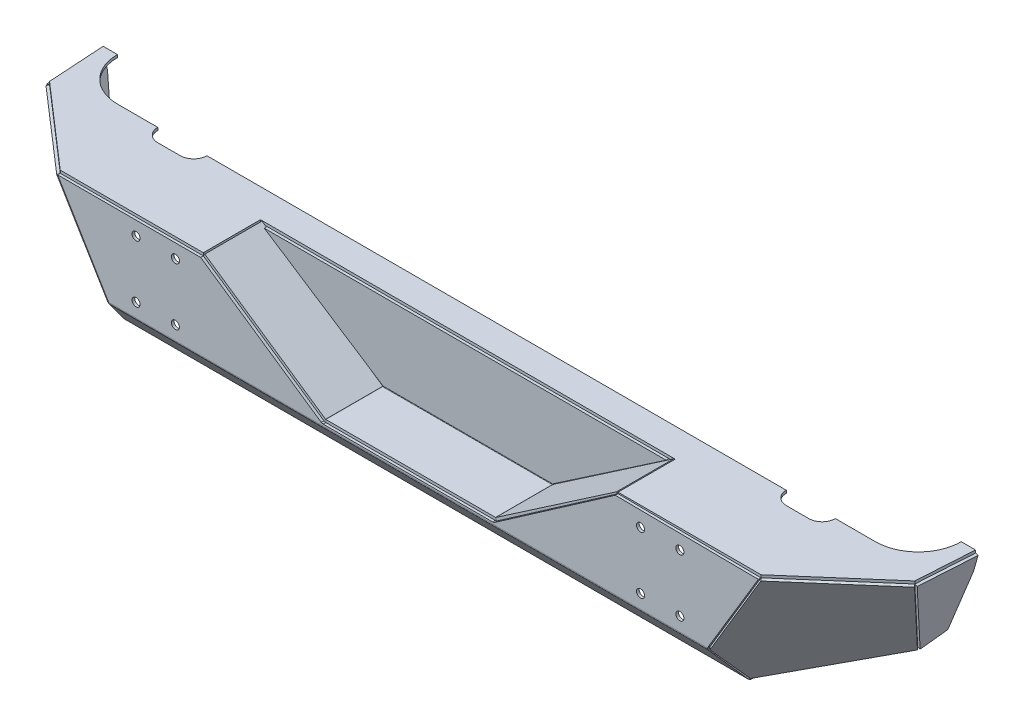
ISO-10303-21;
HEADER;
FILE_DESCRIPTION(('STEP AP214'),'2;1');
FILE_NAME('part.step','',(''),(''),'','','');
FILE_SCHEMA(('AUTOMOTIVE_DESIGN { 1 0 10303 214 1 1 1 1 }'));
ENDSEC;
DATA;
#1=APPLICATION_CONTEXT('core data for automotive mechanical design processes');
#2=APPLICATION_PROTOCOL_DEFINITION('international standard','automotive_design',2000,#1);
#3=PRODUCT_CONTEXT('',#1,'mechanical');
#4=PRODUCT('Part','Part','',(#3));
#5=PRODUCT_RELATED_PRODUCT_CATEGORY('part','',(#4));
#6=PRODUCT_DEFINITION_FORMATION('','',#4);
#7=PRODUCT_DEFINITION_CONTEXT('part definition',#1,'design');
#8=PRODUCT_DEFINITION('design','',#6,#7);
#9=PRODUCT_DEFINITION_SHAPE('','',#8);
#10=(LENGTH_UNIT() NAMED_UNIT(*) SI_UNIT(.MILLI.,.METRE.));
#11=(NAMED_UNIT(*) PLANE_ANGLE_UNIT() SI_UNIT($,.RADIAN.));
#12=(NAMED_UNIT(*) SI_UNIT($,.STERADIAN.) SOLID_ANGLE_UNIT());
#13=UNCERTAINTY_MEASURE_WITH_UNIT(LENGTH_MEASURE(1.E-05),#10,'distance_accuracy_value','');
#14=(GEOMETRIC_REPRESENTATION_CONTEXT(3) GLOBAL_UNCERTAINTY_ASSIGNED_CONTEXT((#13)) GLOBAL_UNIT_ASSIGNED_CONTEXT((#10,
#11,#12)) REPRESENTATION_CONTEXT('',''));
#15=CARTESIAN_POINT('',(0.,0.,0.));
#16=DIRECTION('',(0.,0.,1.));
#17=DIRECTION('',(1.,0.,0.));
#18=AXIS2_PLACEMENT_3D('',#15,#16,#17);
#19=CARTESIAN_POINT('',(738.370645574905,-134.91476071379,-14.0714109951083));
#20=DIRECTION('',(0.129750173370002,0.251754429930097,-0.959054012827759));
#21=DIRECTION('',(0.,0.967230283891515,0.253900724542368));
#22=AXIS2_PLACEMENT_3D('',#19,#20,#21);
#23=PLANE('',#22);
#24=DIRECTION('',(0.24066883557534,0.930310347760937,0.276769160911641));
#25=VECTOR('',#24,1.);
#26=CARTESIAN_POINT('',(733.777401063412,-133.641094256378,-14.3584887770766));
#27=LINE('',#26,#25);
#28=CARTESIAN_POINT('',(733.777401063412,-133.641094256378,-14.3584887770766));
#29=VERTEX_POINT('',#28);
#30=CARTESIAN_POINT('',(768.35,0.,25.4));
#31=VERTEX_POINT('',#30);
#32=EDGE_CURVE('E164',#29,#31,#27,.T.);
#33=ORIENTED_EDGE('',*,*,#32,.F.);
#34=DIRECTION('',(-0.961895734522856,0.266725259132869,-0.0601184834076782));
#35=VECTOR('',#34,1.);
#36=CARTESIAN_POINT('',(738.370645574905,-134.91476071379,-14.0714109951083));
#37=LINE('',#36,#35);
#38=CARTESIAN_POINT('',(738.370645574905,-134.91476071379,-14.0714109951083));
#39=VERTEX_POINT('',#38);
#40=EDGE_CURVE('E163',#39,#29,#37,.T.);
#41=ORIENTED_EDGE('',*,*,#40,.F.);
#42=DIRECTION('',(0.24066883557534,0.930310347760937,0.276769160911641));
#43=VECTOR('',#42,1.);
#44=CARTESIAN_POINT('',(738.370645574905,-134.91476071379,-14.0714109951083));
#45=LINE('',#44,#43);
#46=CARTESIAN_POINT('',(772.943244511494,-1.27366645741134,25.6870777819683));
#47=VERTEX_POINT('',#46);
#48=EDGE_CURVE('E158',#39,#47,#45,.T.);
#49=ORIENTED_EDGE('',*,*,#48,.T.);
#50=DIRECTION('',(-0.961895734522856,0.266725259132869,-0.0601184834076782));
#51=VECTOR('',#50,1.);
#52=CARTESIAN_POINT('',(772.943244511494,-1.27366645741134,25.6870777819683));
#53=LINE('',#52,#51);
#54=EDGE_CURVE('E14',#47,#31,#53,.T.);
#55=ORIENTED_EDGE('',*,*,#54,.T.);
#56=EDGE_LOOP('',(#33,#41,#49,#55));
#57=FACE_BOUND('',#56,.T.);
#58=ADVANCED_FACE('F89',(#57),#23,.F.);
#59=CARTESIAN_POINT('',(772.943244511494,-1.27366645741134,25.6870777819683));
#60=DIRECTION('',(-0.266205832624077,-0.963772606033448,-0.0166378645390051));
#61=DIRECTION('',(-0.963906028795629,0.266242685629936,0.));
#62=AXIS2_PLACEMENT_3D('',#59,#60,#61);
#63=PLANE('',#62);
#64=DIRECTION('',(0.0623782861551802,0.,-0.998052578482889));
#65=VECTOR('',#64,1.);
#66=CARTESIAN_POINT('',(768.35,0.,25.4));
#67=LINE('',#66,#65);
#68=CARTESIAN_POINT('',(774.7,0.,-76.2));
#69=VERTEX_POINT('',#68);
#70=EDGE_CURVE('E166',#31,#69,#67,.T.);
#71=ORIENTED_EDGE('',*,*,#70,.F.);
#72=ORIENTED_EDGE('',*,*,#54,.F.);
#73=DIRECTION('',(0.0623782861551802,0.,-0.998052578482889));
#74=VECTOR('',#73,1.);
#75=CARTESIAN_POINT('',(772.943244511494,-1.27366645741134,25.6870777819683));
#76=LINE('',#75,#74);
#77=CARTESIAN_POINT('',(779.293244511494,-1.27366645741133,-75.9129222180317));
#78=VERTEX_POINT('',#77);
#79=EDGE_CURVE('E134',#47,#78,#76,.T.);
#80=ORIENTED_EDGE('',*,*,#79,.T.);
#81=DIRECTION('',(-0.961895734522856,0.266725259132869,-0.0601184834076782));
#82=VECTOR('',#81,1.);
#83=CARTESIAN_POINT('',(779.293244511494,-1.27366645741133,-75.9129222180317));
#84=LINE('',#83,#82);
#85=EDGE_CURVE('E97',#78,#69,#84,.T.);
#86=ORIENTED_EDGE('',*,*,#85,.T.);
#87=EDGE_LOOP('',(#71,#72,#80,#86));
#88=FACE_BOUND('',#87,.T.);
#89=ADVANCED_FACE('F175',(#88),#63,.F.);
#90=CARTESIAN_POINT('',(779.293244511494,-1.27366645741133,-75.9129222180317));
#91=DIRECTION('',(-0.0579324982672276,0.0160641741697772,0.998191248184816));
#92=DIRECTION('',(-0.998320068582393,0.,-0.057939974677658));
#93=AXIS2_PLACEMENT_3D('',#90,#91,#92);
#94=PLANE('',#93);
#95=DIRECTION('',(-0.267208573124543,-0.963638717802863,0.));
#96=VECTOR('',#95,1.);
#97=CARTESIAN_POINT('',(774.7,0.,-76.2));
#98=LINE('',#97,#96);
#99=CARTESIAN_POINT('',(766.986342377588,-27.8178916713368,-76.2));
#100=VERTEX_POINT('',#99);
#101=EDGE_CURVE('E169',#69,#100,#98,.T.);
#102=ORIENTED_EDGE('',*,*,#101,.F.);
#103=ORIENTED_EDGE('',*,*,#85,.F.);
#104=DIRECTION('',(-0.267208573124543,-0.963638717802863,0.));
#105=VECTOR('',#104,1.);
#106=CARTESIAN_POINT('',(779.293244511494,-1.27366645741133,-75.9129222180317));
#107=LINE('',#106,#105);
#108=CARTESIAN_POINT('',(771.579586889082,-29.0915581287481,-75.9129222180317));
#109=VERTEX_POINT('',#108);
#110=EDGE_CURVE('E143',#78,#109,#107,.T.);
#111=ORIENTED_EDGE('',*,*,#110,.T.);
#112=DIRECTION('',(-0.961895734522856,0.266725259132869,-0.0601184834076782));
#113=VECTOR('',#112,1.);
#114=CARTESIAN_POINT('',(771.579586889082,-29.0915581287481,-75.9129222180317));
#115=LINE('',#114,#113);
#116=EDGE_CURVE('E148',#109,#100,#115,.T.);
#117=ORIENTED_EDGE('',*,*,#116,.T.);
#118=EDGE_LOOP('',(#102,#103,#111,#117));
#119=FACE_BOUND('',#118,.T.);
#120=ADVANCED_FACE('F155',(#119),#94,.F.);
#121=CARTESIAN_POINT('',(771.579586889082,-29.0915581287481,-75.9129222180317));
#122=DIRECTION('',(-0.00718424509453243,0.195146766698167,0.980747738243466));
#123=DIRECTION('',(0.,-0.980773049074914,0.195151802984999));
#124=AXIS2_PLACEMENT_3D('',#121,#122,#123);
#125=PLANE('',#124);
#126=DIRECTION('',(-0.273322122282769,-0.94380897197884,0.18579462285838));
#127=VECTOR('',#126,1.);
#128=CARTESIAN_POINT('',(766.986342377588,-27.8178916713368,-76.2));
#129=LINE('',#128,#127);
#130=CARTESIAN_POINT('',(739.627900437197,-122.289362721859,-57.602707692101));
#131=VERTEX_POINT('',#130);
#132=EDGE_CURVE('E150',#100,#131,#129,.T.);
#133=ORIENTED_EDGE('',*,*,#132,.F.);
#134=ORIENTED_EDGE('',*,*,#116,.F.);
#135=DIRECTION('',(-0.273322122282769,-0.94380897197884,0.18579462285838));
#136=VECTOR('',#135,1.);
#137=CARTESIAN_POINT('',(771.579586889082,-29.0915581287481,-75.9129222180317));
#138=LINE('',#137,#136);
#139=CARTESIAN_POINT('',(744.22114494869,-123.56302917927,-57.3156299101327));
#140=VERTEX_POINT('',#139);
#141=EDGE_CURVE('E139',#109,#140,#138,.T.);
#142=ORIENTED_EDGE('',*,*,#141,.T.);
#143=DIRECTION('',(-0.961895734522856,0.266725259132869,-0.0601184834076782));
#144=VECTOR('',#143,1.);
#145=CARTESIAN_POINT('',(744.22114494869,-123.56302917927,-57.3156299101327));
#146=LINE('',#145,#144);
#147=EDGE_CURVE('E153',#140,#131,#146,.T.);
#148=ORIENTED_EDGE('',*,*,#147,.T.);
#149=EDGE_LOOP('',(#133,#134,#142,#148));
#150=FACE_BOUND('',#149,.T.);
#151=ADVANCED_FACE('F149',(#150),#125,.F.);
#152=CARTESIAN_POINT('',(744.22114494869,-123.56302917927,-57.3156299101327));
#153=DIRECTION('',(0.24066883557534,0.930310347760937,0.276769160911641));
#154=DIRECTION('',(0.,-0.285150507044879,0.958482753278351));
#155=AXIS2_PLACEMENT_3D('',#152,#153,#154);
#156=PLANE('',#155);
#157=DIRECTION('',(-0.129750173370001,-0.251754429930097,0.959054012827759));
#158=VECTOR('',#157,1.);
#159=CARTESIAN_POINT('',(739.627900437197,-122.289362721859,-57.602707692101));
#160=LINE('',#159,#158);
#161=EDGE_CURVE('E122',#131,#29,#160,.T.);
#162=ORIENTED_EDGE('',*,*,#161,.F.);
#163=ORIENTED_EDGE('',*,*,#147,.F.);
#164=DIRECTION('',(-0.129750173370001,-0.251754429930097,0.959054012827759));
#165=VECTOR('',#164,1.);
#166=CARTESIAN_POINT('',(744.22114494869,-123.56302917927,-57.3156299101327));
#167=LINE('',#166,#165);
#168=EDGE_CURVE('E105',#140,#39,#167,.T.);
#169=ORIENTED_EDGE('',*,*,#168,.T.);
#170=ORIENTED_EDGE('',*,*,#40,.T.);
#171=EDGE_LOOP('',(#162,#163,#169,#170));
#172=FACE_BOUND('',#171,.T.);
#173=ADVANCED_FACE('F181',(#172),#156,.F.);
#174=CARTESIAN_POINT('',(716.972837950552,-198.810285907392,44.810802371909));
#175=DIRECTION('',(-0.961895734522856,0.266725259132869,-0.0601184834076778));
#176=DIRECTION('',(0.267208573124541,0.963638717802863,0.));
#177=AXIS2_PLACEMENT_3D('',#174,#175,#176);
#178=PLANE('',#177);
#179=ORIENTED_EDGE('',*,*,#48,.F.);
#180=ORIENTED_EDGE('',*,*,#168,.F.);
#181=ORIENTED_EDGE('',*,*,#141,.F.);
#182=ORIENTED_EDGE('',*,*,#110,.F.);
#183=ORIENTED_EDGE('',*,*,#79,.F.);
#184=EDGE_LOOP('',(#179,#180,#181,#182,#183));
#185=FACE_BOUND('',#184,.T.);
#186=ADVANCED_FACE('F141',(#185),#178,.F.);
#187=CARTESIAN_POINT('',(712.379593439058,-197.53661944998,44.5237245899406));
#188=DIRECTION('',(-0.961895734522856,0.266725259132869,-0.0601184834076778));
#189=DIRECTION('',(0.267208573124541,0.963638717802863,0.));
#190=AXIS2_PLACEMENT_3D('',#187,#188,#189);
#191=PLANE('',#190);
#192=ORIENTED_EDGE('',*,*,#32,.T.);
#193=ORIENTED_EDGE('',*,*,#70,.T.);
#194=ORIENTED_EDGE('',*,*,#101,.T.);
#195=ORIENTED_EDGE('',*,*,#132,.T.);
#196=ORIENTED_EDGE('',*,*,#161,.T.);
#197=EDGE_LOOP('',(#192,#193,#194,#195,#196));
#198=FACE_BOUND('',#197,.T.);
#199=ADVANCED_FACE('F176',(#198),#191,.T.);
#200=CLOSED_SHELL('',(#58,#89,#120,#151,#173,#186,#199));
#201=MANIFOLD_SOLID_BREP('B2',#200);
#202=CARTESIAN_POINT('',(736.69242117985,-135.392510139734,-11.0062156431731));
#203=DIRECTION('',(0.754605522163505,0.,-0.656178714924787));
#204=DIRECTION('',(0.656178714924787,0.,0.754605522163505));
#205=AXIS2_PLACEMENT_3D('',#202,#203,#204);
#206=PLANE('',#205);
#207=DIRECTION('',(0.240668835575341,0.930310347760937,0.276769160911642));
#208=VECTOR('',#207,1.);
#209=CARTESIAN_POINT('',(733.777401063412,-133.641094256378,-14.3584887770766));
#210=LINE('',#209,#208);
#211=CARTESIAN_POINT('',(733.777401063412,-133.641094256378,-14.3584887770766));
#212=VERTEX_POINT('',#211);
#213=CARTESIAN_POINT('',(768.35,0.,25.4));
#214=VERTEX_POINT('',#213);
#215=EDGE_CURVE('E337',#212,#214,#210,.T.);
#216=ORIENTED_EDGE('',*,*,#215,.T.);
#217=DIRECTION('',(-0.610449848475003,0.366773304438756,-0.702017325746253));
#218=VECTOR('',#217,1.);
#219=CARTESIAN_POINT('',(771.265020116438,-1.75141588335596,28.7522731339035));
#220=LINE('',#219,#218);
#221=CARTESIAN_POINT('',(771.265020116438,-1.75141588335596,28.7522731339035));
#222=VERTEX_POINT('',#221);
#223=EDGE_CURVE('E265',#222,#214,#220,.T.);
#224=ORIENTED_EDGE('',*,*,#223,.F.);
#225=DIRECTION('',(0.240668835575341,0.930310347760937,0.276769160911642));
#226=VECTOR('',#225,1.);
#227=CARTESIAN_POINT('',(736.69242117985,-135.392510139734,-11.0062156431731));
#228=LINE('',#227,#226);
#229=CARTESIAN_POINT('',(736.69242117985,-135.392510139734,-11.0062156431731));
#230=VERTEX_POINT('',#229);
#231=EDGE_CURVE('E344',#230,#222,#228,.T.);
#232=ORIENTED_EDGE('',*,*,#231,.F.);
#233=DIRECTION('',(-0.610449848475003,0.366773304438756,-0.702017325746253));
#234=VECTOR('',#233,1.);
#235=CARTESIAN_POINT('',(736.69242117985,-135.392510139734,-11.0062156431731));
#236=LINE('',#235,#234);
#237=EDGE_CURVE('E87',#230,#212,#236,.T.);
#238=ORIENTED_EDGE('',*,*,#237,.T.);
#239=EDGE_LOOP('',(#216,#224,#232,#238));
#240=FACE_BOUND('',#239,.T.);
#241=ADVANCED_FACE('F262',(#240),#206,.T.);
#242=CARTESIAN_POINT('',(557.099539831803,-210.694379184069,105.819578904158));
#243=DIRECTION('',(0.0440988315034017,-0.869210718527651,-0.492471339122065));
#244=DIRECTION('',(0.,0.492950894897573,-0.87005713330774));
#245=AXIS2_PLACEMENT_3D('',#242,#243,#244);
#246=PLANE('',#245);
#247=DIRECTION('',(0.79082632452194,0.331587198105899,-0.514435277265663));
#248=VECTOR('',#247,1.);
#249=CARTESIAN_POINT('',(554.184519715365,-208.942963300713,102.467305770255));
#250=LINE('',#249,#248);
#251=CARTESIAN_POINT('',(554.184519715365,-208.942963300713,102.467305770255));
#252=VERTEX_POINT('',#251);
#253=EDGE_CURVE('E306',#252,#212,#250,.T.);
#254=ORIENTED_EDGE('',*,*,#253,.T.);
#255=ORIENTED_EDGE('',*,*,#237,.F.);
#256=DIRECTION('',(0.79082632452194,0.331587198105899,-0.514435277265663));
#257=VECTOR('',#256,1.);
#258=CARTESIAN_POINT('',(557.099539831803,-210.694379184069,105.819578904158));
#259=LINE('',#258,#257);
#260=CARTESIAN_POINT('',(557.099539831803,-210.694379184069,105.819578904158));
#261=VERTEX_POINT('',#260);
#262=EDGE_CURVE('E280',#261,#230,#259,.T.);
#263=ORIENTED_EDGE('',*,*,#262,.F.);
#264=DIRECTION('',(-0.610449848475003,0.366773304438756,-0.702017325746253));
#265=VECTOR('',#264,1.);
#266=CARTESIAN_POINT('',(557.099539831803,-210.694379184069,105.819578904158));
#267=LINE('',#266,#265);
#268=EDGE_CURVE('E271',#261,#252,#267,.T.);
#269=ORIENTED_EDGE('',*,*,#268,.T.);
#270=EDGE_LOOP('',(#254,#255,#263,#269));
#271=FACE_BOUND('',#270,.T.);
#272=ADVANCED_FACE('F361',(#271),#246,.T.);
#273=CARTESIAN_POINT('',(534.578628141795,-153.005371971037,155.542959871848));
#274=DIRECTION('',(-0.739555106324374,-0.581256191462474,0.339410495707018));
#275=DIRECTION('',(-0.617938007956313,0.786226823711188,0.));
#276=AXIS2_PLACEMENT_3D('',#273,#274,#275);
#277=PLANE('',#276);
#278=DIRECTION('',(0.283565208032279,-0.726373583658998,-0.626076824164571));
#279=VECTOR('',#278,1.);
#280=CARTESIAN_POINT('',(531.663608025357,-151.253956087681,152.190686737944));
#281=LINE('',#280,#279);
#282=CARTESIAN_POINT('',(531.663608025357,-151.253956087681,152.190686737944));
#283=VERTEX_POINT('',#282);
#284=EDGE_CURVE('E300',#283,#252,#281,.T.);
#285=ORIENTED_EDGE('',*,*,#284,.T.);
#286=ORIENTED_EDGE('',*,*,#268,.F.);
#287=DIRECTION('',(0.283565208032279,-0.726373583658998,-0.626076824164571));
#288=VECTOR('',#287,1.);
#289=CARTESIAN_POINT('',(534.578628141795,-153.005371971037,155.542959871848));
#290=LINE('',#289,#288);
#291=CARTESIAN_POINT('',(534.578628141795,-153.005371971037,155.542959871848));
#292=VERTEX_POINT('',#291);
#293=EDGE_CURVE('E322',#292,#261,#290,.T.);
#294=ORIENTED_EDGE('',*,*,#293,.F.);
#295=DIRECTION('',(-0.610449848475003,0.366773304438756,-0.702017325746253));
#296=VECTOR('',#295,1.);
#297=CARTESIAN_POINT('',(534.578628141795,-153.005371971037,155.542959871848));
#298=LINE('',#297,#296);
#299=EDGE_CURVE('E326',#292,#283,#298,.T.);
#300=ORIENTED_EDGE('',*,*,#299,.T.);
#301=EDGE_LOOP('',(#285,#286,#294,#300));
#302=FACE_BOUND('',#301,.T.);
#303=ADVANCED_FACE('F332',(#302),#277,.T.);
#304=CARTESIAN_POINT('',(625.215020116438,-1.75141588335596,155.752273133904));
#305=DIRECTION('',(-0.602613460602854,0.360120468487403,0.712158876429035));
#306=DIRECTION('',(-0.763377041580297,0.,-0.645953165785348));
#307=AXIS2_PLACEMENT_3D('',#304,#305,#306);
#308=PLANE('',#307);
#309=DIRECTION('',(-0.514011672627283,-0.857782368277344,-0.0011870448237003));
#310=VECTOR('',#309,1.);
#311=CARTESIAN_POINT('',(622.3,0.,152.4));
#312=LINE('',#311,#310);
#313=CARTESIAN_POINT('',(622.3,0.,152.4));
#314=VERTEX_POINT('',#313);
#315=EDGE_CURVE('E329',#314,#283,#312,.T.);
#316=ORIENTED_EDGE('',*,*,#315,.T.);
#317=ORIENTED_EDGE('',*,*,#299,.F.);
#318=DIRECTION('',(-0.514011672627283,-0.857782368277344,-0.0011870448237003));
#319=VECTOR('',#318,1.);
#320=CARTESIAN_POINT('',(625.215020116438,-1.75141588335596,155.752273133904));
#321=LINE('',#320,#319);
#322=CARTESIAN_POINT('',(625.215020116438,-1.75141588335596,155.752273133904));
#323=VERTEX_POINT('',#322);
#324=EDGE_CURVE('E318',#323,#292,#321,.T.);
#325=ORIENTED_EDGE('',*,*,#324,.F.);
#326=DIRECTION('',(-0.610449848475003,0.366773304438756,-0.702017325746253));
#327=VECTOR('',#326,1.);
#328=CARTESIAN_POINT('',(625.215020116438,-1.75141588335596,155.752273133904));
#329=LINE('',#328,#327);
#330=EDGE_CURVE('E330',#323,#314,#329,.T.);
#331=ORIENTED_EDGE('',*,*,#330,.T.);
#332=EDGE_LOOP('',(#316,#317,#325,#331));
#333=FACE_BOUND('',#332,.T.);
#334=ADVANCED_FACE('F327',(#333),#308,.T.);
#335=CARTESIAN_POINT('',(771.265020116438,-1.75141588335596,28.7522731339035));
#336=DIRECTION('',(0.24066883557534,0.930310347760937,0.276769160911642));
#337=DIRECTION('',(0.,-0.285150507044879,0.958482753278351));
#338=AXIS2_PLACEMENT_3D('',#335,#336,#337);
#339=PLANE('',#338);
#340=DIRECTION('',(-0.754605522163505,0.,0.656178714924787));
#341=VECTOR('',#340,1.);
#342=CARTESIAN_POINT('',(768.35,0.,25.4));
#343=LINE('',#342,#341);
#344=EDGE_CURVE('E340',#214,#314,#343,.T.);
#345=ORIENTED_EDGE('',*,*,#344,.T.);
#346=ORIENTED_EDGE('',*,*,#330,.F.);
#347=DIRECTION('',(-0.754605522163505,0.,0.656178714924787));
#348=VECTOR('',#347,1.);
#349=CARTESIAN_POINT('',(771.265020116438,-1.75141588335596,28.7522731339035));
#350=LINE('',#349,#348);
#351=EDGE_CURVE('E314',#222,#323,#350,.T.);
#352=ORIENTED_EDGE('',*,*,#351,.F.);
#353=ORIENTED_EDGE('',*,*,#223,.T.);
#354=EDGE_LOOP('',(#345,#346,#352,#353));
#355=FACE_BOUND('',#354,.T.);
#356=ADVANCED_FACE('F347',(#355),#339,.T.);
#357=CARTESIAN_POINT('',(300.124970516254,-180.322474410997,345.143716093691));
#358=DIRECTION('',(-0.610449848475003,0.366773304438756,-0.702017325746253));
#359=DIRECTION('',(0.754605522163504,0.,-0.656178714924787));
#360=AXIS2_PLACEMENT_3D('',#357,#358,#359);
#361=PLANE('',#360);
#362=ORIENTED_EDGE('',*,*,#231,.T.);
#363=ORIENTED_EDGE('',*,*,#351,.T.);
#364=ORIENTED_EDGE('',*,*,#324,.T.);
#365=ORIENTED_EDGE('',*,*,#293,.T.);
#366=ORIENTED_EDGE('',*,*,#262,.T.);
#367=EDGE_LOOP('',(#362,#363,#364,#365,#366));
#368=FACE_BOUND('',#367,.T.);
#369=ADVANCED_FACE('F320',(#368),#361,.F.);
#370=CARTESIAN_POINT('',(297.209950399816,-178.571058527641,341.791442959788));
#371=DIRECTION('',(-0.610449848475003,0.366773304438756,-0.702017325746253));
#372=DIRECTION('',(0.754605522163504,0.,-0.656178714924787));
#373=AXIS2_PLACEMENT_3D('',#370,#371,#372);
#374=PLANE('',#373);
#375=ORIENTED_EDGE('',*,*,#215,.F.);
#376=ORIENTED_EDGE('',*,*,#253,.F.);
#377=ORIENTED_EDGE('',*,*,#284,.F.);
#378=ORIENTED_EDGE('',*,*,#315,.F.);
#379=ORIENTED_EDGE('',*,*,#344,.F.);
#380=EDGE_LOOP('',(#375,#376,#377,#378,#379));
#381=FACE_BOUND('',#380,.T.);
#382=ADVANCED_FACE('F352',(#381),#374,.T.);
#383=CLOSED_SHELL('',(#241,#272,#303,#334,#356,#369,#382));
#384=MANIFOLD_SOLID_BREP('B8',#383);
#385=CARTESIAN_POINT('',(-738.370645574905,-134.91476071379,-14.0714109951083));
#386=DIRECTION('',(-0.129750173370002,0.251754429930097,-0.959054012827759));
#387=DIRECTION('',(0.,0.967230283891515,0.253900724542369));
#388=AXIS2_PLACEMENT_3D('',#385,#386,#387);
#389=PLANE('',#388);
#390=DIRECTION('',(-0.24066883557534,0.930310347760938,0.276769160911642));
#391=VECTOR('',#390,1.);
#392=CARTESIAN_POINT('',(-733.777401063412,-133.641094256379,-14.3584887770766));
#393=LINE('',#392,#391);
#394=CARTESIAN_POINT('',(-733.777401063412,-133.641094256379,-14.3584887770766));
#395=VERTEX_POINT('',#394);
#396=CARTESIAN_POINT('',(-768.35,0.,25.4));
#397=VERTEX_POINT('',#396);
#398=EDGE_CURVE('E509',#395,#397,#393,.T.);
#399=ORIENTED_EDGE('',*,*,#398,.T.);
#400=DIRECTION('',(0.961895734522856,0.26672525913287,-0.0601184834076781));
#401=VECTOR('',#400,1.);
#402=CARTESIAN_POINT('',(-772.943244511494,-1.27366645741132,25.6870777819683));
#403=LINE('',#402,#401);
#404=CARTESIAN_POINT('',(-772.943244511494,-1.27366645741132,25.6870777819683));
#405=VERTEX_POINT('',#404);
#406=EDGE_CURVE('E260',#405,#397,#403,.T.);
#407=ORIENTED_EDGE('',*,*,#406,.F.);
#408=DIRECTION('',(-0.24066883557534,0.930310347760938,0.276769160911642));
#409=VECTOR('',#408,1.);
#410=CARTESIAN_POINT('',(-738.370645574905,-134.91476071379,-14.0714109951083));
#411=LINE('',#410,#409);
#412=CARTESIAN_POINT('',(-738.370645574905,-134.91476071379,-14.0714109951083));
#413=VERTEX_POINT('',#412);
#414=EDGE_CURVE('E517',#413,#405,#411,.T.);
#415=ORIENTED_EDGE('',*,*,#414,.F.);
#416=DIRECTION('',(0.961895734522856,0.26672525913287,-0.0601184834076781));
#417=VECTOR('',#416,1.);
#418=CARTESIAN_POINT('',(-738.370645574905,-134.91476071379,-14.0714109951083));
#419=LINE('',#418,#417);
#420=EDGE_CURVE('E505',#413,#395,#419,.T.);
#421=ORIENTED_EDGE('',*,*,#420,.T.);
#422=EDGE_LOOP('',(#399,#407,#415,#421));
#423=FACE_BOUND('',#422,.T.);
#424=ADVANCED_FACE('F435',(#423),#389,.F.);
#425=CARTESIAN_POINT('',(-772.943244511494,-1.27366645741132,25.6870777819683));
#426=DIRECTION('',(0.266205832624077,-0.963772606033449,-0.0166378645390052));
#427=DIRECTION('',(0.963906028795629,0.266242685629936,0.));
#428=AXIS2_PLACEMENT_3D('',#425,#426,#427);
#429=PLANE('',#428);
#430=DIRECTION('',(-0.0623782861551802,0.,-0.998052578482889));
#431=VECTOR('',#430,1.);
#432=CARTESIAN_POINT('',(-768.35,0.,25.4));
#433=LINE('',#432,#431);
#434=CARTESIAN_POINT('',(-774.7,0.,-76.2));
#435=VERTEX_POINT('',#434);
#436=EDGE_CURVE('E512',#397,#435,#433,.T.);
#437=ORIENTED_EDGE('',*,*,#436,.T.);
#438=DIRECTION('',(0.961895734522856,0.26672525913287,-0.0601184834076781));
#439=VECTOR('',#438,1.);
#440=CARTESIAN_POINT('',(-779.293244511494,-1.27366645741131,-75.9129222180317));
#441=LINE('',#440,#439);
#442=CARTESIAN_POINT('',(-779.293244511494,-1.27366645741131,-75.9129222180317));
#443=VERTEX_POINT('',#442);
#444=EDGE_CURVE('E443',#443,#435,#441,.T.);
#445=ORIENTED_EDGE('',*,*,#444,.F.);
#446=DIRECTION('',(-0.0623782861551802,0.,-0.998052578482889));
#447=VECTOR('',#446,1.);
#448=CARTESIAN_POINT('',(-772.943244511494,-1.27366645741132,25.6870777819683));
#449=LINE('',#448,#447);
#450=EDGE_CURVE('E485',#405,#443,#449,.T.);
#451=ORIENTED_EDGE('',*,*,#450,.F.);
#452=ORIENTED_EDGE('',*,*,#406,.T.);
#453=EDGE_LOOP('',(#437,#445,#451,#452));
#454=FACE_BOUND('',#453,.T.);
#455=ADVANCED_FACE('F536',(#454),#429,.F.);
#456=CARTESIAN_POINT('',(-779.293244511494,-1.27366645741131,-75.9129222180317));
#457=DIRECTION('',(0.0579324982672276,0.0160641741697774,0.998191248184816));
#458=DIRECTION('',(0.998320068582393,0.,-0.0579399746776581));
#459=AXIS2_PLACEMENT_3D('',#456,#457,#458);
#460=PLANE('',#459);
#461=DIRECTION('',(0.267208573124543,-0.963638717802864,0.));
#462=VECTOR('',#461,1.);
#463=CARTESIAN_POINT('',(-774.7,0.,-76.2));
#464=LINE('',#463,#462);
#465=CARTESIAN_POINT('',(-766.986342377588,-27.8178916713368,-76.2));
#466=VERTEX_POINT('',#465);
#467=EDGE_CURVE('E500',#435,#466,#464,.T.);
#468=ORIENTED_EDGE('',*,*,#467,.T.);
#469=DIRECTION('',(0.961895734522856,0.26672525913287,-0.0601184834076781));
#470=VECTOR('',#469,1.);
#471=CARTESIAN_POINT('',(-771.579586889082,-29.091558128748,-75.9129222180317));
#472=LINE('',#471,#470);
#473=CARTESIAN_POINT('',(-771.579586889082,-29.091558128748,-75.9129222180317));
#474=VERTEX_POINT('',#473);
#475=EDGE_CURVE('E497',#474,#466,#472,.T.);
#476=ORIENTED_EDGE('',*,*,#475,.F.);
#477=DIRECTION('',(0.267208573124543,-0.963638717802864,0.));
#478=VECTOR('',#477,1.);
#479=CARTESIAN_POINT('',(-779.293244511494,-1.27366645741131,-75.9129222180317));
#480=LINE('',#479,#478);
#481=EDGE_CURVE('E489',#443,#474,#480,.T.);
#482=ORIENTED_EDGE('',*,*,#481,.F.);
#483=ORIENTED_EDGE('',*,*,#444,.T.);
#484=EDGE_LOOP('',(#468,#476,#482,#483));
#485=FACE_BOUND('',#484,.T.);
#486=ADVANCED_FACE('F498',(#485),#460,.F.);
#487=CARTESIAN_POINT('',(-771.579586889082,-29.091558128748,-75.9129222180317));
#488=DIRECTION('',(0.00718424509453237,0.195146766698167,0.980747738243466));
#489=DIRECTION('',(0.,-0.980773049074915,0.195151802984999));
#490=AXIS2_PLACEMENT_3D('',#487,#488,#489);
#491=PLANE('',#490);
#492=DIRECTION('',(0.273322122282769,-0.943808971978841,0.18579462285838));
#493=VECTOR('',#492,1.);
#494=CARTESIAN_POINT('',(-766.986342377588,-27.8178916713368,-76.2));
#495=LINE('',#494,#493);
#496=CARTESIAN_POINT('',(-739.627900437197,-122.289362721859,-57.602707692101));
#497=VERTEX_POINT('',#496);
#498=EDGE_CURVE('E471',#466,#497,#495,.T.);
#499=ORIENTED_EDGE('',*,*,#498,.T.);
#500=DIRECTION('',(0.961895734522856,0.26672525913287,-0.0601184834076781));
#501=VECTOR('',#500,1.);
#502=CARTESIAN_POINT('',(-744.22114494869,-123.56302917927,-57.3156299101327));
#503=LINE('',#502,#501);
#504=CARTESIAN_POINT('',(-744.22114494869,-123.56302917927,-57.3156299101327));
#505=VERTEX_POINT('',#504);
#506=EDGE_CURVE('E501',#505,#497,#503,.T.);
#507=ORIENTED_EDGE('',*,*,#506,.F.);
#508=DIRECTION('',(0.273322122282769,-0.943808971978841,0.18579462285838));
#509=VECTOR('',#508,1.);
#510=CARTESIAN_POINT('',(-771.579586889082,-29.091558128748,-75.9129222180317));
#511=LINE('',#510,#509);
#512=EDGE_CURVE('E493',#474,#505,#511,.T.);
#513=ORIENTED_EDGE('',*,*,#512,.F.);
#514=ORIENTED_EDGE('',*,*,#475,.T.);
#515=EDGE_LOOP('',(#499,#507,#513,#514));
#516=FACE_BOUND('',#515,.T.);
#517=ADVANCED_FACE('F503',(#516),#491,.F.);
#518=CARTESIAN_POINT('',(-744.22114494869,-123.56302917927,-57.3156299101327));
#519=DIRECTION('',(-0.24066883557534,0.930310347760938,0.276769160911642));
#520=DIRECTION('',(0.,-0.285150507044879,0.958482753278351));
#521=AXIS2_PLACEMENT_3D('',#518,#519,#520);
#522=PLANE('',#521);
#523=DIRECTION('',(0.129750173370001,-0.251754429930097,0.959054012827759));
#524=VECTOR('',#523,1.);
#525=CARTESIAN_POINT('',(-739.627900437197,-122.289362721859,-57.602707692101));
#526=LINE('',#525,#524);
#527=EDGE_CURVE('E477',#497,#395,#526,.T.);
#528=ORIENTED_EDGE('',*,*,#527,.T.);
#529=ORIENTED_EDGE('',*,*,#420,.F.);
#530=DIRECTION('',(0.129750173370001,-0.251754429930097,0.959054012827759));
#531=VECTOR('',#530,1.);
#532=CARTESIAN_POINT('',(-744.22114494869,-123.56302917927,-57.3156299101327));
#533=LINE('',#532,#531);
#534=EDGE_CURVE('E451',#505,#413,#533,.T.);
#535=ORIENTED_EDGE('',*,*,#534,.F.);
#536=ORIENTED_EDGE('',*,*,#506,.T.);
#537=EDGE_LOOP('',(#528,#529,#535,#536));
#538=FACE_BOUND('',#537,.T.);
#539=ADVANCED_FACE('F525',(#538),#522,.F.);
#540=CARTESIAN_POINT('',(-716.972837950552,-198.810285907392,44.8108023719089));
#541=DIRECTION('',(0.961895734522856,0.266725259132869,-0.0601184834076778));
#542=DIRECTION('',(-0.267208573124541,0.963638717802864,0.));
#543=AXIS2_PLACEMENT_3D('',#540,#541,#542);
#544=PLANE('',#543);
#545=ORIENTED_EDGE('',*,*,#414,.T.);
#546=ORIENTED_EDGE('',*,*,#450,.T.);
#547=ORIENTED_EDGE('',*,*,#481,.T.);
#548=ORIENTED_EDGE('',*,*,#512,.T.);
#549=ORIENTED_EDGE('',*,*,#534,.T.);
#550=EDGE_LOOP('',(#545,#546,#547,#548,#549));
#551=FACE_BOUND('',#550,.T.);
#552=ADVANCED_FACE('F491',(#551),#544,.F.);
#553=CARTESIAN_POINT('',(-712.379593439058,-197.53661944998,44.5237245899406));
#554=DIRECTION('',(0.961895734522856,0.266725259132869,-0.0601184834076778));
#555=DIRECTION('',(-0.267208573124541,0.963638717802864,0.));
#556=AXIS2_PLACEMENT_3D('',#553,#554,#555);
#557=PLANE('',#556);
#558=ORIENTED_EDGE('',*,*,#398,.F.);
#559=ORIENTED_EDGE('',*,*,#527,.F.);
#560=ORIENTED_EDGE('',*,*,#498,.F.);
#561=ORIENTED_EDGE('',*,*,#467,.F.);
#562=ORIENTED_EDGE('',*,*,#436,.F.);
#563=EDGE_LOOP('',(#558,#559,#560,#561,#562));
#564=FACE_BOUND('',#563,.T.);
#565=ADVANCED_FACE('F521',(#564),#557,.T.);
#566=CLOSED_SHELL('',(#424,#455,#486,#517,#539,#552,#565));
#567=MANIFOLD_SOLID_BREP('B81',#566);
#568=CARTESIAN_POINT('',(-736.69242117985,-135.392510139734,-11.0062156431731));
#569=DIRECTION('',(-0.754605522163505,0.,-0.656178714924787));
#570=DIRECTION('',(-0.656178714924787,0.,0.754605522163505));
#571=AXIS2_PLACEMENT_3D('',#568,#569,#570);
#572=PLANE('',#571);
#573=DIRECTION('',(-0.240668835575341,0.930310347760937,0.276769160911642));
#574=VECTOR('',#573,1.);
#575=CARTESIAN_POINT('',(-733.777401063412,-133.641094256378,-14.3584887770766));
#576=LINE('',#575,#574);
#577=CARTESIAN_POINT('',(-733.777401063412,-133.641094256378,-14.3584887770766));
#578=VERTEX_POINT('',#577);
#579=CARTESIAN_POINT('',(-768.35,0.,25.4));
#580=VERTEX_POINT('',#579);
#581=EDGE_CURVE('E685',#578,#580,#576,.T.);
#582=ORIENTED_EDGE('',*,*,#581,.F.);
#583=DIRECTION('',(0.610449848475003,0.366773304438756,-0.702017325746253));
#584=VECTOR('',#583,1.);
#585=CARTESIAN_POINT('',(-736.69242117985,-135.392510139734,-11.0062156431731));
#586=LINE('',#585,#584);
#587=CARTESIAN_POINT('',(-736.69242117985,-135.392510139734,-11.0062156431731));
#588=VERTEX_POINT('',#587);
#589=EDGE_CURVE('E433',#588,#578,#586,.T.);
#590=ORIENTED_EDGE('',*,*,#589,.F.);
#591=DIRECTION('',(-0.240668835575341,0.930310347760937,0.276769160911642));
#592=VECTOR('',#591,1.);
#593=CARTESIAN_POINT('',(-736.69242117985,-135.392510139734,-11.0062156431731));
#594=LINE('',#593,#592);
#595=CARTESIAN_POINT('',(-771.265020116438,-1.75141588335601,28.7522731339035));
#596=VERTEX_POINT('',#595);
#597=EDGE_CURVE('E680',#588,#596,#594,.T.);
#598=ORIENTED_EDGE('',*,*,#597,.T.);
#599=DIRECTION('',(0.610449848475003,0.366773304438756,-0.702017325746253));
#600=VECTOR('',#599,1.);
#601=CARTESIAN_POINT('',(-771.265020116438,-1.75141588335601,28.7522731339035));
#602=LINE('',#601,#600);
#603=EDGE_CURVE('E611',#596,#580,#602,.T.);
#604=ORIENTED_EDGE('',*,*,#603,.T.);
#605=EDGE_LOOP('',(#582,#590,#598,#604));
#606=FACE_BOUND('',#605,.T.);
#607=ADVANCED_FACE('F608',(#606),#572,.T.);
#608=CARTESIAN_POINT('',(-557.099539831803,-210.694379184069,105.819578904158));
#609=DIRECTION('',(-0.0440988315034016,-0.869210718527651,-0.492471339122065));
#610=DIRECTION('',(0.,0.492950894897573,-0.87005713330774));
#611=AXIS2_PLACEMENT_3D('',#608,#609,#610);
#612=PLANE('',#611);
#613=DIRECTION('',(-0.79082632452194,0.331587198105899,-0.514435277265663));
#614=VECTOR('',#613,1.);
#615=CARTESIAN_POINT('',(-554.184519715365,-208.942963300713,102.467305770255));
#616=LINE('',#615,#614);
#617=CARTESIAN_POINT('',(-554.184519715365,-208.942963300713,102.467305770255));
#618=VERTEX_POINT('',#617);
#619=EDGE_CURVE('E694',#618,#578,#616,.T.);
#620=ORIENTED_EDGE('',*,*,#619,.F.);
#621=DIRECTION('',(0.610449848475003,0.366773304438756,-0.702017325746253));
#622=VECTOR('',#621,1.);
#623=CARTESIAN_POINT('',(-557.099539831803,-210.694379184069,105.819578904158));
#624=LINE('',#623,#622);
#625=CARTESIAN_POINT('',(-557.099539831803,-210.694379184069,105.819578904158));
#626=VERTEX_POINT('',#625);
#627=EDGE_CURVE('E617',#626,#618,#624,.T.);
#628=ORIENTED_EDGE('',*,*,#627,.F.);
#629=DIRECTION('',(-0.79082632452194,0.331587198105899,-0.514435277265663));
#630=VECTOR('',#629,1.);
#631=CARTESIAN_POINT('',(-557.099539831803,-210.694379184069,105.819578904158));
#632=LINE('',#631,#630);
#633=EDGE_CURVE('E675',#626,#588,#632,.T.);
#634=ORIENTED_EDGE('',*,*,#633,.T.);
#635=ORIENTED_EDGE('',*,*,#589,.T.);
#636=EDGE_LOOP('',(#620,#628,#634,#635));
#637=FACE_BOUND('',#636,.T.);
#638=ADVANCED_FACE('F700',(#637),#612,.T.);
#639=CARTESIAN_POINT('',(-534.578628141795,-153.005371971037,155.542959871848));
#640=DIRECTION('',(0.739555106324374,-0.581256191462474,0.339410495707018));
#641=DIRECTION('',(0.617938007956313,0.786226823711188,0.));
#642=AXIS2_PLACEMENT_3D('',#639,#640,#641);
#643=PLANE('',#642);
#644=DIRECTION('',(-0.283565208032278,-0.726373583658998,-0.626076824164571));
#645=VECTOR('',#644,1.);
#646=CARTESIAN_POINT('',(-531.663608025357,-151.253956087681,152.190686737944));
#647=LINE('',#646,#645);
#648=CARTESIAN_POINT('',(-531.663608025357,-151.253956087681,152.190686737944));
#649=VERTEX_POINT('',#648);
#650=EDGE_CURVE('E664',#649,#618,#647,.T.);
#651=ORIENTED_EDGE('',*,*,#650,.F.);
#652=DIRECTION('',(0.610449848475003,0.366773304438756,-0.702017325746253));
#653=VECTOR('',#652,1.);
#654=CARTESIAN_POINT('',(-534.578628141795,-153.005371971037,155.542959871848));
#655=LINE('',#654,#653);
#656=CARTESIAN_POINT('',(-534.578628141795,-153.005371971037,155.542959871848));
#657=VERTEX_POINT('',#656);
#658=EDGE_CURVE('E659',#657,#649,#655,.T.);
#659=ORIENTED_EDGE('',*,*,#658,.F.);
#660=DIRECTION('',(-0.283565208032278,-0.726373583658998,-0.626076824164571));
#661=VECTOR('',#660,1.);
#662=CARTESIAN_POINT('',(-534.578628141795,-153.005371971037,155.542959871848));
#663=LINE('',#662,#661);
#664=EDGE_CURVE('E662',#657,#626,#663,.T.);
#665=ORIENTED_EDGE('',*,*,#664,.T.);
#666=ORIENTED_EDGE('',*,*,#627,.T.);
#667=EDGE_LOOP('',(#651,#659,#665,#666));
#668=FACE_BOUND('',#667,.T.);
#669=ADVANCED_FACE('F661',(#668),#643,.T.);
#670=CARTESIAN_POINT('',(-625.215020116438,-1.75141588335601,155.752273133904));
#671=DIRECTION('',(0.602613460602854,0.360120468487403,0.712158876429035));
#672=DIRECTION('',(0.763377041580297,0.,-0.645953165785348));
#673=AXIS2_PLACEMENT_3D('',#670,#671,#672);
#674=PLANE('',#673);
#675=DIRECTION('',(0.514011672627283,-0.857782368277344,-0.0011870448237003));
#676=VECTOR('',#675,1.);
#677=CARTESIAN_POINT('',(-622.3,0.,152.4));
#678=LINE('',#677,#676);
#679=CARTESIAN_POINT('',(-622.3,0.,152.4));
#680=VERTEX_POINT('',#679);
#681=EDGE_CURVE('E691',#680,#649,#678,.T.);
#682=ORIENTED_EDGE('',*,*,#681,.F.);
#683=DIRECTION('',(0.610449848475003,0.366773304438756,-0.702017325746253));
#684=VECTOR('',#683,1.);
#685=CARTESIAN_POINT('',(-625.215020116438,-1.75141588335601,155.752273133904));
#686=LINE('',#685,#684);
#687=CARTESIAN_POINT('',(-625.215020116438,-1.75141588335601,155.752273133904));
#688=VERTEX_POINT('',#687);
#689=EDGE_CURVE('E669',#688,#680,#686,.T.);
#690=ORIENTED_EDGE('',*,*,#689,.F.);
#691=DIRECTION('',(0.514011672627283,-0.857782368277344,-0.0011870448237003));
#692=VECTOR('',#691,1.);
#693=CARTESIAN_POINT('',(-625.215020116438,-1.75141588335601,155.752273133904));
#694=LINE('',#693,#692);
#695=EDGE_CURVE('E674',#688,#657,#694,.T.);
#696=ORIENTED_EDGE('',*,*,#695,.T.);
#697=ORIENTED_EDGE('',*,*,#658,.T.);
#698=EDGE_LOOP('',(#682,#690,#696,#697));
#699=FACE_BOUND('',#698,.T.);
#700=ADVANCED_FACE('F677',(#699),#674,.T.);
#701=CARTESIAN_POINT('',(-771.265020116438,-1.75141588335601,28.7522731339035));
#702=DIRECTION('',(-0.240668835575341,0.930310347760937,0.276769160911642));
#703=DIRECTION('',(0.,-0.285150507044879,0.958482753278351));
#704=AXIS2_PLACEMENT_3D('',#701,#702,#703);
#705=PLANE('',#704);
#706=DIRECTION('',(0.754605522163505,0.,0.656178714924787));
#707=VECTOR('',#706,1.);
#708=CARTESIAN_POINT('',(-768.35,0.,25.4));
#709=LINE('',#708,#707);
#710=EDGE_CURVE('E688',#580,#680,#709,.T.);
#711=ORIENTED_EDGE('',*,*,#710,.F.);
#712=ORIENTED_EDGE('',*,*,#603,.F.);
#713=DIRECTION('',(0.754605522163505,0.,0.656178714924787));
#714=VECTOR('',#713,1.);
#715=CARTESIAN_POINT('',(-771.265020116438,-1.75141588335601,28.7522731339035));
#716=LINE('',#715,#714);
#717=EDGE_CURVE('E678',#596,#688,#716,.T.);
#718=ORIENTED_EDGE('',*,*,#717,.T.);
#719=ORIENTED_EDGE('',*,*,#689,.T.);
#720=EDGE_LOOP('',(#711,#712,#718,#719));
#721=FACE_BOUND('',#720,.T.);
#722=ADVANCED_FACE('F697',(#721),#705,.T.);
#723=CARTESIAN_POINT('',(-300.124970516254,-180.322474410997,345.143716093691));
#724=DIRECTION('',(0.610449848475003,0.366773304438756,-0.702017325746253));
#725=DIRECTION('',(-0.754605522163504,0.,-0.656178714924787));
#726=AXIS2_PLACEMENT_3D('',#723,#724,#725);
#727=PLANE('',#726);
#728=ORIENTED_EDGE('',*,*,#597,.F.);
#729=ORIENTED_EDGE('',*,*,#633,.F.);
#730=ORIENTED_EDGE('',*,*,#664,.F.);
#731=ORIENTED_EDGE('',*,*,#695,.F.);
#732=ORIENTED_EDGE('',*,*,#717,.F.);
#733=EDGE_LOOP('',(#728,#729,#730,#731,#732));
#734=FACE_BOUND('',#733,.T.);
#735=ADVANCED_FACE('F673',(#734),#727,.F.);
#736=CARTESIAN_POINT('',(-297.209950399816,-178.571058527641,341.791442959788));
#737=DIRECTION('',(0.610449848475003,0.366773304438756,-0.702017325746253));
#738=DIRECTION('',(-0.754605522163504,0.,-0.656178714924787));
#739=AXIS2_PLACEMENT_3D('',#736,#737,#738);
#740=PLANE('',#739);
#741=ORIENTED_EDGE('',*,*,#581,.T.);
#742=ORIENTED_EDGE('',*,*,#710,.T.);
#743=ORIENTED_EDGE('',*,*,#681,.T.);
#744=ORIENTED_EDGE('',*,*,#650,.T.);
#745=ORIENTED_EDGE('',*,*,#619,.T.);
#746=EDGE_LOOP('',(#741,#742,#743,#744,#745));
#747=FACE_BOUND('',#746,.T.);
#748=ADVANCED_FACE('F699',(#747),#740,.T.);
#749=CLOSED_SHELL('',(#607,#638,#669,#700,#722,#735,#748));
#750=MANIFOLD_SOLID_BREP('B254',#749);
#751=CARTESIAN_POINT('',(0.,0.,157.1752));
#752=DIRECTION('',(0.,0.,1.));
#753=DIRECTION('',(1.,0.,0.));
#754=AXIS2_PLACEMENT_3D('',#751,#752,#753);
#755=PLANE('',#754);
#756=CARTESIAN_POINT('',(482.880192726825,-24.6360183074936,157.1752));
#757=DIRECTION('',(0.,0.,1.));
#758=DIRECTION('',(1.,0.,0.));
#759=AXIS2_PLACEMENT_3D('',#756,#757,#758);
#760=CIRCLE('',#759,7.1437499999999);
#761=CARTESIAN_POINT('',(490.023942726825,-24.6360183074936,157.1752));
#762=VERTEX_POINT('',#761);
#763=EDGE_CURVE('E1094',#762,#762,#760,.F.);
#764=ORIENTED_EDGE('',*,*,#763,.T.);
#765=EDGE_LOOP('',(#764));
#766=FACE_BOUND('',#765,.T.);
#767=CARTESIAN_POINT('',(482.880192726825,-126.236018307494,157.1752));
#768=DIRECTION('',(0.,0.,1.));
#769=DIRECTION('',(1.,0.,0.));
#770=AXIS2_PLACEMENT_3D('',#767,#768,#769);
#771=CIRCLE('',#770,7.1437499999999);
#772=CARTESIAN_POINT('',(490.023942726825,-126.236018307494,157.1752));
#773=VERTEX_POINT('',#772);
#774=EDGE_CURVE('E1082',#773,#773,#771,.F.);
#775=ORIENTED_EDGE('',*,*,#774,.T.);
#776=EDGE_LOOP('',(#775));
#777=FACE_BOUND('',#776,.T.);
#778=CARTESIAN_POINT('',(-413.030192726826,-24.6360183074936,157.1752));
#779=DIRECTION('',(0.,0.,1.));
#780=DIRECTION('',(1.,0.,0.));
#781=AXIS2_PLACEMENT_3D('',#778,#779,#780);
#782=CIRCLE('',#781,7.1437499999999);
#783=CARTESIAN_POINT('',(-405.886442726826,-24.6360183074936,157.1752));
#784=VERTEX_POINT('',#783);
#785=EDGE_CURVE('E1076',#784,#784,#782,.T.);
#786=ORIENTED_EDGE('',*,*,#785,.F.);
#787=EDGE_LOOP('',(#786));
#788=FACE_BOUND('',#787,.T.);
#789=CARTESIAN_POINT('',(-482.880192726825,-24.6360183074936,157.1752));
#790=DIRECTION('',(0.,0.,1.));
#791=DIRECTION('',(1.,0.,0.));
#792=AXIS2_PLACEMENT_3D('',#789,#790,#791);
#793=CIRCLE('',#792,7.1437499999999);
#794=CARTESIAN_POINT('',(-475.736442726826,-24.6360183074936,157.1752));
#795=VERTEX_POINT('',#794);
#796=EDGE_CURVE('E1070',#795,#795,#793,.T.);
#797=ORIENTED_EDGE('',*,*,#796,.F.);
#798=EDGE_LOOP('',(#797));
#799=FACE_BOUND('',#798,.T.);
#800=CARTESIAN_POINT('',(-413.030192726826,-126.236018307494,157.1752));
#801=DIRECTION('',(0.,0.,1.));
#802=DIRECTION('',(1.,0.,0.));
#803=AXIS2_PLACEMENT_3D('',#800,#801,#802);
#804=CIRCLE('',#803,7.1437499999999);
#805=CARTESIAN_POINT('',(-405.886442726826,-126.236018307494,157.1752));
#806=VERTEX_POINT('',#805);
#807=EDGE_CURVE('E1064',#806,#806,#804,.T.);
#808=ORIENTED_EDGE('',*,*,#807,.F.);
#809=EDGE_LOOP('',(#808));
#810=FACE_BOUND('',#809,.T.);
#811=CARTESIAN_POINT('',(-482.880192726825,-126.236018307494,157.1752));
#812=DIRECTION('',(0.,0.,1.));
#813=DIRECTION('',(1.,0.,0.));
#814=AXIS2_PLACEMENT_3D('',#811,#812,#813);
#815=CIRCLE('',#814,7.1437499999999);
#816=CARTESIAN_POINT('',(-475.736442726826,-126.236018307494,157.1752));
#817=VERTEX_POINT('',#816);
#818=EDGE_CURVE('E1027',#817,#817,#815,.T.);
#819=ORIENTED_EDGE('',*,*,#818,.F.);
#820=EDGE_LOOP('',(#819));
#821=FACE_BOUND('',#820,.T.);
#822=DIRECTION('',(-0.821196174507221,-0.570645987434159,0.));
#823=VECTOR('',#822,1.);
#824=CARTESIAN_POINT('',(368.3,2.3876,157.1752));
#825=LINE('',#824,#823);
#826=CARTESIAN_POINT('',(368.3,2.3876,157.1752));
#827=VERTEX_POINT('',#826);
#828=CARTESIAN_POINT('',(153.80680897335,-146.662873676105,157.1752));
#829=VERTEX_POINT('',#828);
#830=EDGE_CURVE('E923',#827,#829,#825,.T.);
#831=ORIENTED_EDGE('',*,*,#830,.T.);
#832=DIRECTION('',(-0.955373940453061,-0.295399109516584,0.));
#833=VECTOR('',#832,1.);
#834=CARTESIAN_POINT('',(150.695765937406,-147.6248,157.1752));
#835=LINE('',#834,#833);
#836=CARTESIAN_POINT('',(150.695765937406,-147.6248,157.1752));
#837=VERTEX_POINT('',#836);
#838=EDGE_CURVE('E842',#829,#837,#835,.T.);
#839=ORIENTED_EDGE('',*,*,#838,.T.);
#840=DIRECTION('',(-1.,0.,0.));
#841=VECTOR('',#840,1.);
#842=CARTESIAN_POINT('',(150.695765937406,-147.6248,157.1752));
#843=LINE('',#842,#841);
#844=CARTESIAN_POINT('',(-150.695765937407,-147.6248,157.1752));
#845=VERTEX_POINT('',#844);
#846=EDGE_CURVE('E945',#837,#845,#843,.T.);
#847=ORIENTED_EDGE('',*,*,#846,.T.);
#848=DIRECTION('',(-0.955373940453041,0.29539910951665,0.));
#849=VECTOR('',#848,1.);
#850=CARTESIAN_POINT('',(-150.695765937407,-147.6248,157.1752));
#851=LINE('',#850,#849);
#852=CARTESIAN_POINT('',(-153.806808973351,-146.662873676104,157.1752));
#853=VERTEX_POINT('',#852);
#854=EDGE_CURVE('E964',#845,#853,#851,.T.);
#855=ORIENTED_EDGE('',*,*,#854,.T.);
#856=DIRECTION('',(-0.825478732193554,0.564433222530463,0.));
#857=VECTOR('',#856,1.);
#858=CARTESIAN_POINT('',(-368.3,0.,157.1752));
#859=LINE('',#858,#857);
#860=CARTESIAN_POINT('',(-368.3,0.,157.1752));
#861=VERTEX_POINT('',#860);
#862=EDGE_CURVE('E961',#853,#861,#859,.T.);
#863=ORIENTED_EDGE('',*,*,#862,.T.);
#864=DIRECTION('',(-1.,0.,0.));
#865=VECTOR('',#864,1.);
#866=CARTESIAN_POINT('',(-622.3,0.,157.1752));
#867=LINE('',#866,#865);
#868=CARTESIAN_POINT('',(-622.3,0.,157.1752));
#869=VERTEX_POINT('',#868);
#870=EDGE_CURVE('E963',#861,#869,#867,.T.);
#871=ORIENTED_EDGE('',*,*,#870,.T.);
#872=DIRECTION('',(0.515015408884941,-0.857180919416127,0.));
#873=VECTOR('',#872,1.);
#874=CARTESIAN_POINT('',(-622.3,0.,157.1752));
#875=LINE('',#874,#873);
#876=CARTESIAN_POINT('',(-531.695765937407,-150.7998,157.1752));
#877=VERTEX_POINT('',#876);
#878=EDGE_CURVE('E894',#869,#877,#875,.T.);
#879=ORIENTED_EDGE('',*,*,#878,.T.);
#880=DIRECTION('',(1.,0.,0.));
#881=VECTOR('',#880,1.);
#882=CARTESIAN_POINT('',(-531.695765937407,-150.7998,157.1752));
#883=LINE('',#882,#881);
#884=CARTESIAN_POINT('',(531.695765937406,-150.7998,157.1752));
#885=VERTEX_POINT('',#884);
#886=EDGE_CURVE('E869',#877,#885,#883,.T.);
#887=ORIENTED_EDGE('',*,*,#886,.T.);
#888=DIRECTION('',(0.515015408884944,0.857180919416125,0.));
#889=VECTOR('',#888,1.);
#890=CARTESIAN_POINT('',(622.3,0.,157.1752));
#891=LINE('',#890,#889);
#892=CARTESIAN_POINT('',(622.3,0.,157.1752));
#893=VERTEX_POINT('',#892);
#894=EDGE_CURVE('E892',#885,#893,#891,.T.);
#895=ORIENTED_EDGE('',*,*,#894,.T.);
#896=DIRECTION('',(-0.999955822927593,0.00939958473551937,0.));
#897=VECTOR('',#896,1.);
#898=CARTESIAN_POINT('',(622.3,0.,157.1752));
#899=LINE('',#898,#897);
#900=EDGE_CURVE('E798',#893,#827,#899,.T.);
#901=ORIENTED_EDGE('',*,*,#900,.T.);
#902=EDGE_LOOP('',(#831,#839,#847,#855,#863,#871,#879,#887,#895,#901));
#903=FACE_BOUND('',#902,.T.);
#904=CARTESIAN_POINT('',(413.030192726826,-126.236018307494,157.1752));
#905=DIRECTION('',(0.,0.,1.));
#906=DIRECTION('',(1.,0.,0.));
#907=AXIS2_PLACEMENT_3D('',#904,#905,#906);
#908=CIRCLE('',#907,7.1437499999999);
#909=CARTESIAN_POINT('',(420.173942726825,-126.236018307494,157.1752));
#910=VERTEX_POINT('',#909);
#911=EDGE_CURVE('E1088',#910,#910,#908,.F.);
#912=ORIENTED_EDGE('',*,*,#911,.T.);
#913=EDGE_LOOP('',(#912));
#914=FACE_BOUND('',#913,.T.);
#915=CARTESIAN_POINT('',(413.030192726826,-24.6360183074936,157.1752));
#916=DIRECTION('',(0.,0.,1.));
#917=DIRECTION('',(1.,0.,0.));
#918=AXIS2_PLACEMENT_3D('',#915,#916,#917);
#919=CIRCLE('',#918,7.1437499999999);
#920=CARTESIAN_POINT('',(420.173942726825,-24.6360183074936,157.1752));
#921=VERTEX_POINT('',#920);
#922=EDGE_CURVE('E1100',#921,#921,#919,.F.);
#923=ORIENTED_EDGE('',*,*,#922,.T.);
#924=EDGE_LOOP('',(#923));
#925=FACE_BOUND('',#924,.T.);
#926=ADVANCED_FACE('F781',(#766,#777,#788,#799,#810,#821,#903,#914,#925),#755,.T.);
#927=CARTESIAN_POINT('',(0.,0.,152.4));
#928=DIRECTION('',(0.,0.,1.));
#929=DIRECTION('',(1.,0.,0.));
#930=AXIS2_PLACEMENT_3D('',#927,#928,#929);
#931=PLANE('',#930);
#932=CARTESIAN_POINT('',(482.880192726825,-24.6360183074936,152.4));
#933=DIRECTION('',(0.,0.,1.));
#934=DIRECTION('',(1.,0.,0.));
#935=AXIS2_PLACEMENT_3D('',#932,#933,#934);
#936=CIRCLE('',#935,7.1437499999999);
#937=CARTESIAN_POINT('',(490.023942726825,-24.6360183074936,152.4));
#938=VERTEX_POINT('',#937);
#939=EDGE_CURVE('E1097',#938,#938,#936,.T.);
#940=ORIENTED_EDGE('',*,*,#939,.T.);
#941=EDGE_LOOP('',(#940));
#942=FACE_BOUND('',#941,.T.);
#943=CARTESIAN_POINT('',(482.880192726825,-126.236018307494,152.4));
#944=DIRECTION('',(0.,0.,1.));
#945=DIRECTION('',(1.,0.,0.));
#946=AXIS2_PLACEMENT_3D('',#943,#944,#945);
#947=CIRCLE('',#946,7.1437499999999);
#948=CARTESIAN_POINT('',(490.023942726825,-126.236018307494,152.4));
#949=VERTEX_POINT('',#948);
#950=EDGE_CURVE('E1085',#949,#949,#947,.T.);
#951=ORIENTED_EDGE('',*,*,#950,.T.);
#952=EDGE_LOOP('',(#951));
#953=FACE_BOUND('',#952,.T.);
#954=CARTESIAN_POINT('',(-413.030192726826,-24.6360183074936,152.4));
#955=DIRECTION('',(0.,0.,-1.));
#956=DIRECTION('',(-1.,0.,0.));
#957=AXIS2_PLACEMENT_3D('',#954,#955,#956);
#958=CIRCLE('',#957,7.1437499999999);
#959=CARTESIAN_POINT('',(-420.173942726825,-24.6360183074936,152.4));
#960=VERTEX_POINT('',#959);
#961=EDGE_CURVE('E1079',#960,#960,#958,.T.);
#962=ORIENTED_EDGE('',*,*,#961,.F.);
#963=EDGE_LOOP('',(#962));
#964=FACE_BOUND('',#963,.T.);
#965=CARTESIAN_POINT('',(-482.880192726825,-24.6360183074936,152.4));
#966=DIRECTION('',(0.,0.,-1.));
#967=DIRECTION('',(-1.,0.,0.));
#968=AXIS2_PLACEMENT_3D('',#965,#966,#967);
#969=CIRCLE('',#968,7.1437499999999);
#970=CARTESIAN_POINT('',(-490.023942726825,-24.6360183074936,152.4));
#971=VERTEX_POINT('',#970);
#972=EDGE_CURVE('E1073',#971,#971,#969,.T.);
#973=ORIENTED_EDGE('',*,*,#972,.F.);
#974=EDGE_LOOP('',(#973));
#975=FACE_BOUND('',#974,.T.);
#976=CARTESIAN_POINT('',(-413.030192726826,-126.236018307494,152.4));
#977=DIRECTION('',(0.,0.,-1.));
#978=DIRECTION('',(-1.,0.,0.));
#979=AXIS2_PLACEMENT_3D('',#976,#977,#978);
#980=CIRCLE('',#979,7.1437499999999);
#981=CARTESIAN_POINT('',(-420.173942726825,-126.236018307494,152.4));
#982=VERTEX_POINT('',#981);
#983=EDGE_CURVE('E1067',#982,#982,#980,.T.);
#984=ORIENTED_EDGE('',*,*,#983,.F.);
#985=EDGE_LOOP('',(#984));
#986=FACE_BOUND('',#985,.T.);
#987=CARTESIAN_POINT('',(-482.880192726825,-126.236018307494,152.4));
#988=DIRECTION('',(0.,0.,-1.));
#989=DIRECTION('',(-1.,0.,0.));
#990=AXIS2_PLACEMENT_3D('',#987,#988,#989);
#991=CIRCLE('',#990,7.1437499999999);
#992=CARTESIAN_POINT('',(-490.023942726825,-126.236018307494,152.4));
#993=VERTEX_POINT('',#992);
#994=EDGE_CURVE('E1061',#993,#993,#991,.T.);
#995=ORIENTED_EDGE('',*,*,#994,.F.);
#996=EDGE_LOOP('',(#995));
#997=FACE_BOUND('',#996,.T.);
#998=DIRECTION('',(-0.821196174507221,-0.570645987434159,0.));
#999=VECTOR('',#998,1.);
#1000=CARTESIAN_POINT('',(368.3,2.3876,152.4));
#1001=LINE('',#1000,#999);
#1002=CARTESIAN_POINT('',(368.3,2.3876,152.4));
#1003=VERTEX_POINT('',#1002);
#1004=CARTESIAN_POINT('',(153.80680897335,-146.662873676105,152.4));
#1005=VERTEX_POINT('',#1004);
#1006=EDGE_CURVE('E877',#1003,#1005,#1001,.T.);
#1007=ORIENTED_EDGE('',*,*,#1006,.F.);
#1008=DIRECTION('',(-0.999955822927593,0.00939958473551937,0.));
#1009=VECTOR('',#1008,1.);
#1010=CARTESIAN_POINT('',(622.3,0.,152.4));
#1011=LINE('',#1010,#1009);
#1012=CARTESIAN_POINT('',(622.3,0.,152.4));
#1013=VERTEX_POINT('',#1012);
#1014=EDGE_CURVE('E834',#1013,#1003,#1011,.T.);
#1015=ORIENTED_EDGE('',*,*,#1014,.F.);
#1016=DIRECTION('',(0.515015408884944,0.857180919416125,0.));
#1017=VECTOR('',#1016,1.);
#1018=CARTESIAN_POINT('',(622.3,0.,152.4));
#1019=LINE('',#1018,#1017);
#1020=CARTESIAN_POINT('',(531.695765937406,-150.7998,152.4));
#1021=VERTEX_POINT('',#1020);
#1022=EDGE_CURVE('E828',#1021,#1013,#1019,.T.);
#1023=ORIENTED_EDGE('',*,*,#1022,.F.);
#1024=DIRECTION('',(1.,0.,0.));
#1025=VECTOR('',#1024,1.);
#1026=CARTESIAN_POINT('',(-531.695765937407,-150.7998,152.4));
#1027=LINE('',#1026,#1025);
#1028=CARTESIAN_POINT('',(-531.695765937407,-150.7998,152.4));
#1029=VERTEX_POINT('',#1028);
#1030=EDGE_CURVE('E918',#1029,#1021,#1027,.T.);
#1031=ORIENTED_EDGE('',*,*,#1030,.F.);
#1032=DIRECTION('',(0.515015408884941,-0.857180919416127,0.));
#1033=VECTOR('',#1032,1.);
#1034=CARTESIAN_POINT('',(-622.3,0.,152.4));
#1035=LINE('',#1034,#1033);
#1036=CARTESIAN_POINT('',(-622.3,0.,152.4));
#1037=VERTEX_POINT('',#1036);
#1038=EDGE_CURVE('E915',#1037,#1029,#1035,.T.);
#1039=ORIENTED_EDGE('',*,*,#1038,.F.);
#1040=DIRECTION('',(-1.,0.,0.));
#1041=VECTOR('',#1040,1.);
#1042=CARTESIAN_POINT('',(-622.3,0.,152.4));
#1043=LINE('',#1042,#1041);
#1044=CARTESIAN_POINT('',(-368.3,0.,152.4));
#1045=VERTEX_POINT('',#1044);
#1046=EDGE_CURVE('E913',#1045,#1037,#1043,.T.);
#1047=ORIENTED_EDGE('',*,*,#1046,.F.);
#1048=DIRECTION('',(-0.825478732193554,0.564433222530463,0.));
#1049=VECTOR('',#1048,1.);
#1050=CARTESIAN_POINT('',(-368.3,0.,152.4));
#1051=LINE('',#1050,#1049);
#1052=CARTESIAN_POINT('',(-153.806808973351,-146.662873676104,152.4));
#1053=VERTEX_POINT('',#1052);
#1054=EDGE_CURVE('E911',#1053,#1045,#1051,.T.);
#1055=ORIENTED_EDGE('',*,*,#1054,.F.);
#1056=DIRECTION('',(-0.955373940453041,0.29539910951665,0.));
#1057=VECTOR('',#1056,1.);
#1058=CARTESIAN_POINT('',(-150.695765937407,-147.6248,152.4));
#1059=LINE('',#1058,#1057);
#1060=CARTESIAN_POINT('',(-150.695765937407,-147.6248,152.4));
#1061=VERTEX_POINT('',#1060);
#1062=EDGE_CURVE('E909',#1061,#1053,#1059,.T.);
#1063=ORIENTED_EDGE('',*,*,#1062,.F.);
#1064=DIRECTION('',(-1.,0.,0.));
#1065=VECTOR('',#1064,1.);
#1066=CARTESIAN_POINT('',(150.695765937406,-147.6248,152.4));
#1067=LINE('',#1066,#1065);
#1068=CARTESIAN_POINT('',(150.695765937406,-147.6248,152.4));
#1069=VERTEX_POINT('',#1068);
#1070=EDGE_CURVE('E907',#1069,#1061,#1067,.T.);
#1071=ORIENTED_EDGE('',*,*,#1070,.F.);
#1072=DIRECTION('',(-0.955373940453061,-0.295399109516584,0.));
#1073=VECTOR('',#1072,1.);
#1074=CARTESIAN_POINT('',(150.695765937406,-147.6248,152.4));
#1075=LINE('',#1074,#1073);
#1076=EDGE_CURVE('E905',#1005,#1069,#1075,.T.);
#1077=ORIENTED_EDGE('',*,*,#1076,.F.);
#1078=EDGE_LOOP('',(#1007,#1015,#1023,#1031,#1039,#1047,#1055,#1063,#1071,#1077));
#1079=FACE_BOUND('',#1078,.T.);
#1080=CARTESIAN_POINT('',(413.030192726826,-126.236018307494,152.4));
#1081=DIRECTION('',(0.,0.,1.));
#1082=DIRECTION('',(1.,0.,0.));
#1083=AXIS2_PLACEMENT_3D('',#1080,#1081,#1082);
#1084=CIRCLE('',#1083,7.1437499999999);
#1085=CARTESIAN_POINT('',(420.173942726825,-126.236018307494,152.4));
#1086=VERTEX_POINT('',#1085);
#1087=EDGE_CURVE('E1091',#1086,#1086,#1084,.T.);
#1088=ORIENTED_EDGE('',*,*,#1087,.T.);
#1089=EDGE_LOOP('',(#1088));
#1090=FACE_BOUND('',#1089,.T.);
#1091=CARTESIAN_POINT('',(413.030192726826,-24.6360183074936,152.4));
#1092=DIRECTION('',(0.,0.,1.));
#1093=DIRECTION('',(1.,0.,0.));
#1094=AXIS2_PLACEMENT_3D('',#1091,#1092,#1093);
#1095=CIRCLE('',#1094,7.1437499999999);
#1096=CARTESIAN_POINT('',(420.173942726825,-24.6360183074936,152.4));
#1097=VERTEX_POINT('',#1096);
#1098=EDGE_CURVE('E1103',#1097,#1097,#1095,.T.);
#1099=ORIENTED_EDGE('',*,*,#1098,.T.);
#1100=EDGE_LOOP('',(#1099));
#1101=FACE_BOUND('',#1100,.T.);
#1102=ADVANCED_FACE('F949',(#942,#953,#964,#975,#986,#997,#1079,#1090,#1101),#931,.F.);
#1103=CARTESIAN_POINT('',(368.3,2.3876,157.1752));
#1104=DIRECTION('',(0.570645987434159,-0.821196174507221,0.));
#1105=DIRECTION('',(0.821196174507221,0.570645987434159,0.));
#1106=AXIS2_PLACEMENT_3D('',#1103,#1104,#1105);
#1107=PLANE('',#1106);
#1108=ORIENTED_EDGE('',*,*,#1006,.T.);
#1109=DIRECTION('',(0.,0.,-1.));
#1110=VECTOR('',#1109,1.);
#1111=CARTESIAN_POINT('',(153.80680897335,-146.662873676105,157.1752));
#1112=LINE('',#1111,#1110);
#1113=EDGE_CURVE('E606',#829,#1005,#1112,.T.);
#1114=ORIENTED_EDGE('',*,*,#1113,.F.);
#1115=ORIENTED_EDGE('',*,*,#830,.F.);
#1116=DIRECTION('',(0.,0.,-1.));
#1117=VECTOR('',#1116,1.);
#1118=CARTESIAN_POINT('',(368.3,2.3876,157.1752));
#1119=LINE('',#1118,#1117);
#1120=EDGE_CURVE('E899',#827,#1003,#1119,.T.);
#1121=ORIENTED_EDGE('',*,*,#1120,.T.);
#1122=EDGE_LOOP('',(#1108,#1114,#1115,#1121));
#1123=FACE_BOUND('',#1122,.T.);
#1124=ADVANCED_FACE('F783',(#1123),#1107,.F.);
#1125=CARTESIAN_POINT('',(150.695765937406,-147.6248,157.1752));
#1126=DIRECTION('',(0.295399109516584,-0.955373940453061,0.));
#1127=DIRECTION('',(0.955373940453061,0.295399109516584,0.));
#1128=AXIS2_PLACEMENT_3D('',#1125,#1126,#1127);
#1129=PLANE('',#1128);
#1130=ORIENTED_EDGE('',*,*,#1076,.T.);
#1131=DIRECTION('',(0.,0.,-1.));
#1132=VECTOR('',#1131,1.);
#1133=CARTESIAN_POINT('',(150.695765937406,-147.6248,157.1752));
#1134=LINE('',#1133,#1132);
#1135=EDGE_CURVE('E790',#837,#1069,#1134,.T.);
#1136=ORIENTED_EDGE('',*,*,#1135,.F.);
#1137=ORIENTED_EDGE('',*,*,#838,.F.);
#1138=ORIENTED_EDGE('',*,*,#1113,.T.);
#1139=EDGE_LOOP('',(#1130,#1136,#1137,#1138));
#1140=FACE_BOUND('',#1139,.T.);
#1141=ADVANCED_FACE('F1151',(#1140),#1129,.F.);
#1142=CARTESIAN_POINT('',(150.695765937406,-147.6248,157.1752));
#1143=DIRECTION('',(0.,-1.,0.));
#1144=DIRECTION('',(1.,0.,0.));
#1145=AXIS2_PLACEMENT_3D('',#1142,#1143,#1144);
#1146=PLANE('',#1145);
#1147=ORIENTED_EDGE('',*,*,#1070,.T.);
#1148=DIRECTION('',(0.,0.,-1.));
#1149=VECTOR('',#1148,1.);
#1150=CARTESIAN_POINT('',(-150.695765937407,-147.6248,157.1752));
#1151=LINE('',#1150,#1149);
#1152=EDGE_CURVE('E937',#845,#1061,#1151,.T.);
#1153=ORIENTED_EDGE('',*,*,#1152,.F.);
#1154=ORIENTED_EDGE('',*,*,#846,.F.);
#1155=ORIENTED_EDGE('',*,*,#1135,.T.);
#1156=EDGE_LOOP('',(#1147,#1153,#1154,#1155));
#1157=FACE_BOUND('',#1156,.T.);
#1158=ADVANCED_FACE('F943',(#1157),#1146,.F.);
#1159=CARTESIAN_POINT('',(-150.695765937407,-147.6248,157.1752));
#1160=DIRECTION('',(-0.29539910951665,-0.955373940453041,0.));
#1161=DIRECTION('',(0.955373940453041,-0.29539910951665,0.));
#1162=AXIS2_PLACEMENT_3D('',#1159,#1160,#1161);
#1163=PLANE('',#1162);
#1164=ORIENTED_EDGE('',*,*,#1062,.T.);
#1165=DIRECTION('',(0.,0.,-1.));
#1166=VECTOR('',#1165,1.);
#1167=CARTESIAN_POINT('',(-153.806808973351,-146.662873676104,157.1752));
#1168=LINE('',#1167,#1166);
#1169=EDGE_CURVE('E934',#853,#1053,#1168,.T.);
#1170=ORIENTED_EDGE('',*,*,#1169,.F.);
#1171=ORIENTED_EDGE('',*,*,#854,.F.);
#1172=ORIENTED_EDGE('',*,*,#1152,.T.);
#1173=EDGE_LOOP('',(#1164,#1170,#1171,#1172));
#1174=FACE_BOUND('',#1173,.T.);
#1175=ADVANCED_FACE('F955',(#1174),#1163,.F.);
#1176=CARTESIAN_POINT('',(-368.3,0.,157.1752));
#1177=DIRECTION('',(-0.564433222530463,-0.825478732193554,0.));
#1178=DIRECTION('',(0.825478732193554,-0.564433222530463,0.));
#1179=AXIS2_PLACEMENT_3D('',#1176,#1177,#1178);
#1180=PLANE('',#1179);
#1181=ORIENTED_EDGE('',*,*,#1054,.T.);
#1182=DIRECTION('',(0.,0.,-1.));
#1183=VECTOR('',#1182,1.);
#1184=CARTESIAN_POINT('',(-368.3,0.,157.1752));
#1185=LINE('',#1184,#1183);
#1186=EDGE_CURVE('E931',#861,#1045,#1185,.T.);
#1187=ORIENTED_EDGE('',*,*,#1186,.F.);
#1188=ORIENTED_EDGE('',*,*,#862,.F.);
#1189=ORIENTED_EDGE('',*,*,#1169,.T.);
#1190=EDGE_LOOP('',(#1181,#1187,#1188,#1189));
#1191=FACE_BOUND('',#1190,.T.);
#1192=ADVANCED_FACE('F959',(#1191),#1180,.F.);
#1193=CARTESIAN_POINT('',(-622.3,0.,157.1752));
#1194=DIRECTION('',(0.,-1.,0.));
#1195=DIRECTION('',(0.,0.,-1.));
#1196=AXIS2_PLACEMENT_3D('',#1193,#1194,#1195);
#1197=PLANE('',#1196);
#1198=ORIENTED_EDGE('',*,*,#1046,.T.);
#1199=DIRECTION('',(0.,0.,-1.));
#1200=VECTOR('',#1199,1.);
#1201=CARTESIAN_POINT('',(-622.3,0.,157.1752));
#1202=LINE('',#1201,#1200);
#1203=EDGE_CURVE('E928',#869,#1037,#1202,.T.);
#1204=ORIENTED_EDGE('',*,*,#1203,.F.);
#1205=ORIENTED_EDGE('',*,*,#870,.F.);
#1206=ORIENTED_EDGE('',*,*,#1186,.T.);
#1207=EDGE_LOOP('',(#1198,#1204,#1205,#1206));
#1208=FACE_BOUND('',#1207,.T.);
#1209=ADVANCED_FACE('F1141',(#1208),#1197,.F.);
#1210=CARTESIAN_POINT('',(-622.3,0.,157.1752));
#1211=DIRECTION('',(0.857180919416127,0.515015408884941,0.));
#1212=DIRECTION('',(-0.515015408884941,0.857180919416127,0.));
#1213=AXIS2_PLACEMENT_3D('',#1210,#1211,#1212);
#1214=PLANE('',#1213);
#1215=ORIENTED_EDGE('',*,*,#1038,.T.);
#1216=DIRECTION('',(0.,0.,-1.));
#1217=VECTOR('',#1216,1.);
#1218=CARTESIAN_POINT('',(-531.695765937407,-150.7998,157.1752));
#1219=LINE('',#1218,#1217);
#1220=EDGE_CURVE('E887',#877,#1029,#1219,.T.);
#1221=ORIENTED_EDGE('',*,*,#1220,.F.);
#1222=ORIENTED_EDGE('',*,*,#878,.F.);
#1223=ORIENTED_EDGE('',*,*,#1203,.T.);
#1224=EDGE_LOOP('',(#1215,#1221,#1222,#1223));
#1225=FACE_BOUND('',#1224,.T.);
#1226=ADVANCED_FACE('F1138',(#1225),#1214,.F.);
#1227=CARTESIAN_POINT('',(622.3,0.,157.1752));
#1228=DIRECTION('',(-0.857180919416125,0.515015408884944,0.));
#1229=DIRECTION('',(-0.515015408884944,-0.857180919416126,0.));
#1230=AXIS2_PLACEMENT_3D('',#1227,#1228,#1229);
#1231=PLANE('',#1230);
#1232=ORIENTED_EDGE('',*,*,#1022,.T.);
#1233=DIRECTION('',(0.,0.,-1.));
#1234=VECTOR('',#1233,1.);
#1235=CARTESIAN_POINT('',(622.3,0.,157.1752));
#1236=LINE('',#1235,#1234);
#1237=EDGE_CURVE('E888',#893,#1013,#1236,.T.);
#1238=ORIENTED_EDGE('',*,*,#1237,.F.);
#1239=ORIENTED_EDGE('',*,*,#894,.F.);
#1240=DIRECTION('',(0.,0.,-1.));
#1241=VECTOR('',#1240,1.);
#1242=CARTESIAN_POINT('',(531.695765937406,-150.7998,157.1752));
#1243=LINE('',#1242,#1241);
#1244=EDGE_CURVE('E881',#885,#1021,#1243,.T.);
#1245=ORIENTED_EDGE('',*,*,#1244,.T.);
#1246=EDGE_LOOP('',(#1232,#1238,#1239,#1245));
#1247=FACE_BOUND('',#1246,.T.);
#1248=ADVANCED_FACE('F897',(#1247),#1231,.F.);
#1249=CARTESIAN_POINT('',(622.3,0.,157.1752));
#1250=DIRECTION('',(-0.00939958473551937,-0.999955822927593,0.));
#1251=DIRECTION('',(0.999955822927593,-0.00939958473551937,0.));
#1252=AXIS2_PLACEMENT_3D('',#1249,#1250,#1251);
#1253=PLANE('',#1252);
#1254=ORIENTED_EDGE('',*,*,#1014,.T.);
#1255=ORIENTED_EDGE('',*,*,#1120,.F.);
#1256=ORIENTED_EDGE('',*,*,#900,.F.);
#1257=ORIENTED_EDGE('',*,*,#1237,.T.);
#1258=EDGE_LOOP('',(#1254,#1255,#1256,#1257));
#1259=FACE_BOUND('',#1258,.T.);
#1260=ADVANCED_FACE('F1133',(#1259),#1253,.F.);
#1261=CARTESIAN_POINT('',(531.695765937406,-150.7998,151.6634));
#1262=DIRECTION('',(1.,0.,0.));
#1263=DIRECTION('',(0.,0.,-1.));
#1264=AXIS2_PLACEMENT_3D('',#1261,#1262,#1263);
#1265=PLANE('',#1264);
#1266=DIRECTION('',(0.,0.642787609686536,-0.766044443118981));
#1267=VECTOR('',#1266,1.);
#1268=CARTESIAN_POINT('',(531.695765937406,-154.34271674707,155.885683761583));
#1269=LINE('',#1268,#1267);
#1270=CARTESIAN_POINT('',(531.695765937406,-151.273277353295,152.227668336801));
#1271=VERTEX_POINT('',#1270);
#1272=CARTESIAN_POINT('',(531.695765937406,-154.34271674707,155.885683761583));
#1273=VERTEX_POINT('',#1272);
#1274=EDGE_CURVE('E978',#1271,#1273,#1269,.F.);
#1275=ORIENTED_EDGE('',*,*,#1274,.F.);
#1276=CARTESIAN_POINT('',(531.695765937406,-150.7998,151.6634));
#1277=DIRECTION('',(-1.,0.,0.));
#1278=DIRECTION('',(0.,0.,1.));
#1279=AXIS2_PLACEMENT_3D('',#1276,#1277,#1278);
#1280=CIRCLE('',#1279,0.736600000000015);
#1281=EDGE_CURVE('E885',#1021,#1271,#1280,.F.);
#1282=ORIENTED_EDGE('',*,*,#1281,.F.);
#1283=ORIENTED_EDGE('',*,*,#1244,.F.);
#1284=CARTESIAN_POINT('',(531.695765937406,-150.7998,151.6634));
#1285=DIRECTION('',(-1.,0.,0.));
#1286=DIRECTION('',(0.,0.,1.));
#1287=AXIS2_PLACEMENT_3D('',#1284,#1285,#1286);
#1288=CIRCLE('',#1287,5.51180000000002);
#1289=EDGE_CURVE('E864',#885,#1273,#1288,.F.);
#1290=ORIENTED_EDGE('',*,*,#1289,.T.);
#1291=EDGE_LOOP('',(#1275,#1282,#1283,#1290));
#1292=FACE_BOUND('',#1291,.T.);
#1293=ADVANCED_FACE('F882',(#1292),#1265,.T.);
#1294=CARTESIAN_POINT('',(-531.695765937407,-150.7998,151.6634));
#1295=DIRECTION('',(1.,0.,0.));
#1296=DIRECTION('',(0.,0.,-1.));
#1297=AXIS2_PLACEMENT_3D('',#1294,#1295,#1296);
#1298=PLANE('',#1297);
#1299=CARTESIAN_POINT('',(-531.695765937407,-150.7998,151.6634));
#1300=DIRECTION('',(-1.,0.,0.));
#1301=DIRECTION('',(0.,0.,1.));
#1302=AXIS2_PLACEMENT_3D('',#1299,#1300,#1301);
#1303=CIRCLE('',#1302,0.736600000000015);
#1304=CARTESIAN_POINT('',(-531.695765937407,-151.273277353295,152.227668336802));
#1305=VERTEX_POINT('',#1304);
#1306=EDGE_CURVE('E972',#1305,#1029,#1303,.T.);
#1307=ORIENTED_EDGE('',*,*,#1306,.F.);
#1308=DIRECTION('',(0.,0.642787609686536,-0.766044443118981));
#1309=VECTOR('',#1308,1.);
#1310=CARTESIAN_POINT('',(-531.695765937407,-151.273277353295,152.227668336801));
#1311=LINE('',#1310,#1309);
#1312=CARTESIAN_POINT('',(-531.695765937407,-154.34271674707,155.885683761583));
#1313=VERTEX_POINT('',#1312);
#1314=EDGE_CURVE('E984',#1305,#1313,#1311,.F.);
#1315=ORIENTED_EDGE('',*,*,#1314,.T.);
#1316=CARTESIAN_POINT('',(-531.695765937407,-150.7998,151.6634));
#1317=DIRECTION('',(-1.,0.,0.));
#1318=DIRECTION('',(0.,0.,1.));
#1319=AXIS2_PLACEMENT_3D('',#1316,#1317,#1318);
#1320=CIRCLE('',#1319,5.51180000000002);
#1321=EDGE_CURVE('E878',#1313,#877,#1320,.T.);
#1322=ORIENTED_EDGE('',*,*,#1321,.T.);
#1323=ORIENTED_EDGE('',*,*,#1220,.T.);
#1324=EDGE_LOOP('',(#1307,#1315,#1322,#1323));
#1325=FACE_BOUND('',#1324,.T.);
#1326=ADVANCED_FACE('F1130',(#1325),#1298,.F.);
#1327=CARTESIAN_POINT('',(-531.695765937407,-150.7998,151.6634));
#1328=DIRECTION('',(-1.,0.,0.));
#1329=DIRECTION('',(0.,-0.642787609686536,0.766044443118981));
#1330=AXIS2_PLACEMENT_3D('',#1327,#1328,#1329);
#1331=CYLINDRICAL_SURFACE('',#1330,5.51180000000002);
#1332=ORIENTED_EDGE('',*,*,#886,.F.);
#1333=ORIENTED_EDGE('',*,*,#1321,.F.);
#1334=DIRECTION('',(-1.,0.,0.));
#1335=VECTOR('',#1334,1.);
#1336=CARTESIAN_POINT('',(531.695765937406,-154.342716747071,155.885683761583));
#1337=LINE('',#1336,#1335);
#1338=EDGE_CURVE('E873',#1313,#1273,#1337,.F.);
#1339=ORIENTED_EDGE('',*,*,#1338,.T.);
#1340=ORIENTED_EDGE('',*,*,#1289,.F.);
#1341=EDGE_LOOP('',(#1332,#1333,#1339,#1340));
#1342=FACE_BOUND('',#1341,.T.);
#1343=ADVANCED_FACE('F866',(#1342),#1331,.T.);
#1344=CARTESIAN_POINT('',(-531.695765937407,-150.7998,151.6634));
#1345=DIRECTION('',(-1.,0.,0.));
#1346=DIRECTION('',(0.,-0.642787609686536,0.766044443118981));
#1347=AXIS2_PLACEMENT_3D('',#1344,#1345,#1346);
#1348=CYLINDRICAL_SURFACE('',#1347,0.736600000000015);
#1349=ORIENTED_EDGE('',*,*,#1030,.T.);
#1350=ORIENTED_EDGE('',*,*,#1281,.T.);
#1351=DIRECTION('',(-1.,0.,0.));
#1352=VECTOR('',#1351,1.);
#1353=CARTESIAN_POINT('',(531.695765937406,-151.273277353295,152.227668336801));
#1354=LINE('',#1353,#1352);
#1355=EDGE_CURVE('E980',#1271,#1305,#1354,.T.);
#1356=ORIENTED_EDGE('',*,*,#1355,.T.);
#1357=ORIENTED_EDGE('',*,*,#1306,.T.);
#1358=EDGE_LOOP('',(#1349,#1350,#1356,#1357));
#1359=FACE_BOUND('',#1358,.T.);
#1360=ADVANCED_FACE('F1241',(#1359),#1348,.F.);
#1361=CARTESIAN_POINT('',(0.,-140.686735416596,167.344412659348));
#1362=DIRECTION('',(0.,0.642787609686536,-0.766044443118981));
#1363=DIRECTION('',(0.,0.766044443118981,0.642787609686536));
#1364=AXIS2_PLACEMENT_3D('',#1361,#1362,#1363);
#1365=PLANE('',#1364);
#1366=ORIENTED_EDGE('',*,*,#1338,.F.);
#1367=DIRECTION('',(-0.293547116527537,-0.732296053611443,-0.614469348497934));
#1368=VECTOR('',#1367,1.);
#1369=CARTESIAN_POINT('',(-555.01258786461,-212.509926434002,107.077599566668));
#1370=LINE('',#1369,#1368);
#1371=CARTESIAN_POINT('',(-555.01258786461,-212.509926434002,107.077599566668));
#1372=VERTEX_POINT('',#1371);
#1373=EDGE_CURVE('E996',#1313,#1372,#1370,.T.);
#1374=ORIENTED_EDGE('',*,*,#1373,.T.);
#1375=DIRECTION('',(1.,0.,0.));
#1376=VECTOR('',#1375,1.);
#1377=CARTESIAN_POINT('',(0.,-212.509926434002,107.077599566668));
#1378=LINE('',#1377,#1376);
#1379=CARTESIAN_POINT('',(555.01258786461,-212.509926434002,107.077599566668));
#1380=VERTEX_POINT('',#1379);
#1381=EDGE_CURVE('E975',#1372,#1380,#1378,.T.);
#1382=ORIENTED_EDGE('',*,*,#1381,.T.);
#1383=DIRECTION('',(-0.293547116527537,0.732296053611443,0.614469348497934));
#1384=VECTOR('',#1383,1.);
#1385=CARTESIAN_POINT('',(555.01258786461,-212.509926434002,107.077599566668));
#1386=LINE('',#1385,#1384);
#1387=EDGE_CURVE('E1005',#1380,#1273,#1386,.T.);
#1388=ORIENTED_EDGE('',*,*,#1387,.T.);
#1389=EDGE_LOOP('',(#1366,#1374,#1382,#1388));
#1390=FACE_BOUND('',#1389,.T.);
#1391=ADVANCED_FACE('F1236',(#1390),#1365,.F.);
#1392=CARTESIAN_POINT('',(0.,-137.617296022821,163.686397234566));
#1393=DIRECTION('',(0.,0.642787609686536,-0.766044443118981));
#1394=DIRECTION('',(0.,0.766044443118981,0.642787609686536));
#1395=AXIS2_PLACEMENT_3D('',#1392,#1393,#1394);
#1396=PLANE('',#1395);
#1397=DIRECTION('',(-1.,0.,0.));
#1398=VECTOR('',#1397,1.);
#1399=CARTESIAN_POINT('',(531.695765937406,-209.440487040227,103.419584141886));
#1400=LINE('',#1399,#1398);
#1401=CARTESIAN_POINT('',(-555.01258786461,-209.440487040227,103.419584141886));
#1402=VERTEX_POINT('',#1401);
#1403=CARTESIAN_POINT('',(555.01258786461,-209.440487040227,103.419584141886));
#1404=VERTEX_POINT('',#1403);
#1405=EDGE_CURVE('E988',#1402,#1404,#1400,.F.);
#1406=ORIENTED_EDGE('',*,*,#1405,.F.);
#1407=DIRECTION('',(-0.293547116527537,-0.732296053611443,-0.614469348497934));
#1408=VECTOR('',#1407,1.);
#1409=CARTESIAN_POINT('',(-555.01258786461,-209.440487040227,103.419584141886));
#1410=LINE('',#1409,#1408);
#1411=EDGE_CURVE('E995',#1305,#1402,#1410,.T.);
#1412=ORIENTED_EDGE('',*,*,#1411,.F.);
#1413=ORIENTED_EDGE('',*,*,#1355,.F.);
#1414=DIRECTION('',(-0.293547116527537,0.732296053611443,0.614469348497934));
#1415=VECTOR('',#1414,1.);
#1416=CARTESIAN_POINT('',(555.01258786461,-209.440487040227,103.419584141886));
#1417=LINE('',#1416,#1415);
#1418=EDGE_CURVE('E1004',#1404,#1271,#1417,.T.);
#1419=ORIENTED_EDGE('',*,*,#1418,.F.);
#1420=EDGE_LOOP('',(#1406,#1412,#1413,#1419));
#1421=FACE_BOUND('',#1420,.T.);
#1422=ADVANCED_FACE('F1245',(#1421),#1396,.T.);
#1423=CARTESIAN_POINT('',(-555.01258786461,-209.440487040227,103.419584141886));
#1424=DIRECTION('',(-0.955944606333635,0.224870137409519,0.18868844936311));
#1425=DIRECTION('',(-0.22898336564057,-0.973430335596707,0.));
#1426=AXIS2_PLACEMENT_3D('',#1423,#1424,#1425);
#1427=PLANE('',#1426);
#1428=ORIENTED_EDGE('',*,*,#1373,.F.);
#1429=ORIENTED_EDGE('',*,*,#1314,.F.);
#1430=ORIENTED_EDGE('',*,*,#1411,.T.);
#1431=DIRECTION('',(0.,-0.642787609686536,0.766044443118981));
#1432=VECTOR('',#1431,1.);
#1433=CARTESIAN_POINT('',(-555.01258786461,-209.440487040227,103.419584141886));
#1434=LINE('',#1433,#1432);
#1435=EDGE_CURVE('E981',#1402,#1372,#1434,.T.);
#1436=ORIENTED_EDGE('',*,*,#1435,.T.);
#1437=EDGE_LOOP('',(#1428,#1429,#1430,#1436));
#1438=FACE_BOUND('',#1437,.T.);
#1439=ADVANCED_FACE('F1247',(#1438),#1427,.T.);
#1440=CARTESIAN_POINT('',(555.01258786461,-209.440487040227,103.419584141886));
#1441=DIRECTION('',(0.955944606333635,0.224870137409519,0.18868844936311));
#1442=DIRECTION('',(-0.22898336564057,0.973430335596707,0.));
#1443=AXIS2_PLACEMENT_3D('',#1440,#1441,#1442);
#1444=PLANE('',#1443);
#1445=ORIENTED_EDGE('',*,*,#1387,.F.);
#1446=DIRECTION('',(0.,-0.642787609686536,0.766044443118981));
#1447=VECTOR('',#1446,1.);
#1448=CARTESIAN_POINT('',(555.01258786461,-209.440487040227,103.419584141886));
#1449=LINE('',#1448,#1447);
#1450=EDGE_CURVE('E999',#1404,#1380,#1449,.T.);
#1451=ORIENTED_EDGE('',*,*,#1450,.F.);
#1452=ORIENTED_EDGE('',*,*,#1418,.T.);
#1453=ORIENTED_EDGE('',*,*,#1274,.T.);
#1454=EDGE_LOOP('',(#1445,#1451,#1452,#1453));
#1455=FACE_BOUND('',#1454,.T.);
#1456=ADVANCED_FACE('F1238',(#1455),#1444,.T.);
#1457=CARTESIAN_POINT('',(555.01258786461,-208.967009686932,102.855315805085));
#1458=DIRECTION('',(1.,0.,0.));
#1459=DIRECTION('',(0.,0.,-1.));
#1460=AXIS2_PLACEMENT_3D('',#1457,#1458,#1459);
#1461=PLANE('',#1460);
#1462=DIRECTION('',(0.,1.,0.));
#1463=VECTOR('',#1462,1.);
#1464=CARTESIAN_POINT('',(555.01258786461,-214.478809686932,102.855315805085));
#1465=LINE('',#1464,#1463);
#1466=CARTESIAN_POINT('',(555.01258786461,-209.703609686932,102.855315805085));
#1467=VERTEX_POINT('',#1466);
#1468=CARTESIAN_POINT('',(555.01258786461,-214.478809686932,102.855315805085));
#1469=VERTEX_POINT('',#1468);
#1470=EDGE_CURVE('E1023',#1467,#1469,#1465,.F.);
#1471=ORIENTED_EDGE('',*,*,#1470,.F.);
#1472=CARTESIAN_POINT('',(555.01258786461,-208.967009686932,102.855315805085));
#1473=DIRECTION('',(-1.,0.,0.));
#1474=DIRECTION('',(0.,0.,1.));
#1475=AXIS2_PLACEMENT_3D('',#1472,#1473,#1474);
#1476=CIRCLE('',#1475,0.736600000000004);
#1477=EDGE_CURVE('E1014',#1404,#1467,#1476,.F.);
#1478=ORIENTED_EDGE('',*,*,#1477,.F.);
#1479=ORIENTED_EDGE('',*,*,#1450,.T.);
#1480=CARTESIAN_POINT('',(555.01258786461,-208.967009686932,102.855315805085));
#1481=DIRECTION('',(-1.,0.,0.));
#1482=DIRECTION('',(0.,0.,1.));
#1483=AXIS2_PLACEMENT_3D('',#1480,#1481,#1482);
#1484=CIRCLE('',#1483,5.5118);
#1485=EDGE_CURVE('E1008',#1380,#1469,#1484,.F.);
#1486=ORIENTED_EDGE('',*,*,#1485,.T.);
#1487=EDGE_LOOP('',(#1471,#1478,#1479,#1486));
#1488=FACE_BOUND('',#1487,.T.);
#1489=ADVANCED_FACE('F1217',(#1488),#1461,.T.);
#1490=CARTESIAN_POINT('',(-555.01258786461,-208.967009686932,102.855315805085));
#1491=DIRECTION('',(1.,0.,0.));
#1492=DIRECTION('',(0.,0.,-1.));
#1493=AXIS2_PLACEMENT_3D('',#1490,#1491,#1492);
#1494=PLANE('',#1493);
#1495=CARTESIAN_POINT('',(-555.01258786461,-208.967009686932,102.855315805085));
#1496=DIRECTION('',(-1.,0.,0.));
#1497=DIRECTION('',(0.,0.,1.));
#1498=AXIS2_PLACEMENT_3D('',#1495,#1496,#1497);
#1499=CIRCLE('',#1498,0.736600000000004);
#1500=CARTESIAN_POINT('',(-555.01258786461,-209.703609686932,102.855315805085));
#1501=VERTEX_POINT('',#1500);
#1502=EDGE_CURVE('E1011',#1501,#1402,#1499,.T.);
#1503=ORIENTED_EDGE('',*,*,#1502,.F.);
#1504=DIRECTION('',(0.,1.,0.));
#1505=VECTOR('',#1504,1.);
#1506=CARTESIAN_POINT('',(-555.01258786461,-209.703609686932,102.855315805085));
#1507=LINE('',#1506,#1505);
#1508=CARTESIAN_POINT('',(-555.01258786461,-214.478809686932,102.855315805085));
#1509=VERTEX_POINT('',#1508);
#1510=EDGE_CURVE('E1030',#1501,#1509,#1507,.F.);
#1511=ORIENTED_EDGE('',*,*,#1510,.T.);
#1512=CARTESIAN_POINT('',(-555.01258786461,-208.967009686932,102.855315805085));
#1513=DIRECTION('',(-1.,0.,0.));
#1514=DIRECTION('',(0.,0.,1.));
#1515=AXIS2_PLACEMENT_3D('',#1512,#1513,#1514);
#1516=CIRCLE('',#1515,5.5118);
#1517=EDGE_CURVE('E1018',#1509,#1372,#1516,.T.);
#1518=ORIENTED_EDGE('',*,*,#1517,.T.);
#1519=ORIENTED_EDGE('',*,*,#1435,.F.);
#1520=EDGE_LOOP('',(#1503,#1511,#1518,#1519));
#1521=FACE_BOUND('',#1520,.T.);
#1522=ADVANCED_FACE('F1231',(#1521),#1494,.F.);
#1523=CARTESIAN_POINT('',(-555.01258786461,-208.967009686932,102.855315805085));
#1524=DIRECTION('',(-1.,0.,0.));
#1525=DIRECTION('',(0.,-1.,0.));
#1526=AXIS2_PLACEMENT_3D('',#1523,#1524,#1525);
#1527=CYLINDRICAL_SURFACE('',#1526,5.5118);
#1528=ORIENTED_EDGE('',*,*,#1381,.F.);
#1529=ORIENTED_EDGE('',*,*,#1517,.F.);
#1530=DIRECTION('',(-1.,0.,0.));
#1531=VECTOR('',#1530,1.);
#1532=CARTESIAN_POINT('',(555.01258786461,-214.478809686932,102.855315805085));
#1533=LINE('',#1532,#1531);
#1534=EDGE_CURVE('E1033',#1509,#1469,#1533,.F.);
#1535=ORIENTED_EDGE('',*,*,#1534,.T.);
#1536=ORIENTED_EDGE('',*,*,#1485,.F.);
#1537=EDGE_LOOP('',(#1528,#1529,#1535,#1536));
#1538=FACE_BOUND('',#1537,.T.);
#1539=ADVANCED_FACE('F1233',(#1538),#1527,.T.);
#1540=CARTESIAN_POINT('',(-555.01258786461,-208.967009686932,102.855315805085));
#1541=DIRECTION('',(-1.,0.,0.));
#1542=DIRECTION('',(0.,-1.,0.));
#1543=AXIS2_PLACEMENT_3D('',#1540,#1541,#1542);
#1544=CYLINDRICAL_SURFACE('',#1543,0.736600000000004);
#1545=ORIENTED_EDGE('',*,*,#1405,.T.);
#1546=ORIENTED_EDGE('',*,*,#1477,.T.);
#1547=DIRECTION('',(-1.,0.,0.));
#1548=VECTOR('',#1547,1.);
#1549=CARTESIAN_POINT('',(555.01258786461,-209.703609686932,102.855315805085));
#1550=LINE('',#1549,#1548);
#1551=EDGE_CURVE('E1026',#1467,#1501,#1550,.T.);
#1552=ORIENTED_EDGE('',*,*,#1551,.T.);
#1553=ORIENTED_EDGE('',*,*,#1502,.T.);
#1554=EDGE_LOOP('',(#1545,#1546,#1552,#1553));
#1555=FACE_BOUND('',#1554,.T.);
#1556=ADVANCED_FACE('F1221',(#1555),#1544,.F.);
#1557=CARTESIAN_POINT('',(-555.01258786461,-214.478809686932,84.1487980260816));
#1558=DIRECTION('',(1.,0.,0.));
#1559=DIRECTION('',(0.,0.,-1.));
#1560=AXIS2_PLACEMENT_3D('',#1557,#1558,#1559);
#1561=PLANE('',#1560);
#1562=ORIENTED_EDGE('',*,*,#1510,.F.);
#1563=DIRECTION('',(0.,0.,1.));
#1564=VECTOR('',#1563,1.);
#1565=CARTESIAN_POINT('',(-555.01258786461,-209.703609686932,84.1487980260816));
#1566=LINE('',#1565,#1564);
#1567=CARTESIAN_POINT('',(-555.01258786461,-209.703609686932,84.1487980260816));
#1568=VERTEX_POINT('',#1567);
#1569=EDGE_CURVE('E1036',#1501,#1568,#1566,.F.);
#1570=ORIENTED_EDGE('',*,*,#1569,.T.);
#1571=DIRECTION('',(0.,1.,0.));
#1572=VECTOR('',#1571,1.);
#1573=CARTESIAN_POINT('',(-555.01258786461,-214.478809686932,84.1487980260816));
#1574=LINE('',#1573,#1572);
#1575=CARTESIAN_POINT('',(-555.01258786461,-214.478809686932,84.1487980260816));
#1576=VERTEX_POINT('',#1575);
#1577=EDGE_CURVE('E1015',#1576,#1568,#1574,.T.);
#1578=ORIENTED_EDGE('',*,*,#1577,.F.);
#1579=DIRECTION('',(0.,0.,-1.));
#1580=VECTOR('',#1579,1.);
#1581=CARTESIAN_POINT('',(-555.01258786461,-214.478809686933,-0.22078611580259));
#1582=LINE('',#1581,#1580);
#1583=EDGE_CURVE('E1045',#1509,#1576,#1582,.T.);
#1584=ORIENTED_EDGE('',*,*,#1583,.F.);
#1585=EDGE_LOOP('',(#1562,#1570,#1578,#1584));
#1586=FACE_BOUND('',#1585,.T.);
#1587=ADVANCED_FACE('F1229',(#1586),#1561,.F.);
#1588=CARTESIAN_POINT('',(555.01258786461,-214.478809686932,103.198798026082));
#1589=DIRECTION('',(-1.,0.,0.));
#1590=DIRECTION('',(0.,0.,1.));
#1591=AXIS2_PLACEMENT_3D('',#1588,#1589,#1590);
#1592=PLANE('',#1591);
#1593=ORIENTED_EDGE('',*,*,#1470,.T.);
#1594=DIRECTION('',(0.,0.,1.));
#1595=VECTOR('',#1594,1.);
#1596=CARTESIAN_POINT('',(555.01258786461,-214.478809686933,-0.22078611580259));
#1597=LINE('',#1596,#1595);
#1598=CARTESIAN_POINT('',(555.01258786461,-214.478809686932,84.1487980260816));
#1599=VERTEX_POINT('',#1598);
#1600=EDGE_CURVE('E1051',#1599,#1469,#1597,.T.);
#1601=ORIENTED_EDGE('',*,*,#1600,.F.);
#1602=DIRECTION('',(0.,1.,0.));
#1603=VECTOR('',#1602,1.);
#1604=CARTESIAN_POINT('',(555.01258786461,-214.478809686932,84.1487980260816));
#1605=LINE('',#1604,#1603);
#1606=CARTESIAN_POINT('',(555.01258786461,-209.703609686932,84.1487980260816));
#1607=VERTEX_POINT('',#1606);
#1608=EDGE_CURVE('E1054',#1599,#1607,#1605,.T.);
#1609=ORIENTED_EDGE('',*,*,#1608,.T.);
#1610=DIRECTION('',(0.,0.,-1.));
#1611=VECTOR('',#1610,1.);
#1612=CARTESIAN_POINT('',(555.01258786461,-209.703609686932,103.198798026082));
#1613=LINE('',#1612,#1611);
#1614=EDGE_CURVE('E1042',#1607,#1467,#1613,.F.);
#1615=ORIENTED_EDGE('',*,*,#1614,.T.);
#1616=EDGE_LOOP('',(#1593,#1601,#1609,#1615));
#1617=FACE_BOUND('',#1616,.T.);
#1618=ADVANCED_FACE('F1214',(#1617),#1592,.F.);
#1619=CARTESIAN_POINT('',(0.,-214.478809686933,-0.22078611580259));
#1620=DIRECTION('',(0.,1.,0.));
#1621=DIRECTION('',(0.,0.,1.));
#1622=AXIS2_PLACEMENT_3D('',#1619,#1620,#1621);
#1623=PLANE('',#1622);
#1624=ORIENTED_EDGE('',*,*,#1534,.F.);
#1625=ORIENTED_EDGE('',*,*,#1583,.T.);
#1626=DIRECTION('',(1.,0.,0.));
#1627=VECTOR('',#1626,1.);
#1628=CARTESIAN_POINT('',(0.,-214.478809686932,84.1487980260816));
#1629=LINE('',#1628,#1627);
#1630=EDGE_CURVE('E1048',#1576,#1599,#1629,.T.);
#1631=ORIENTED_EDGE('',*,*,#1630,.T.);
#1632=ORIENTED_EDGE('',*,*,#1600,.T.);
#1633=EDGE_LOOP('',(#1624,#1625,#1631,#1632));
#1634=FACE_BOUND('',#1633,.T.);
#1635=ADVANCED_FACE('F1205',(#1634),#1623,.F.);
#1636=CARTESIAN_POINT('',(0.,-209.703609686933,-0.220786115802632));
#1637=DIRECTION('',(0.,1.,0.));
#1638=DIRECTION('',(0.,0.,1.));
#1639=AXIS2_PLACEMENT_3D('',#1636,#1637,#1638);
#1640=PLANE('',#1639);
#1641=ORIENTED_EDGE('',*,*,#1569,.F.);
#1642=ORIENTED_EDGE('',*,*,#1551,.F.);
#1643=ORIENTED_EDGE('',*,*,#1614,.F.);
#1644=DIRECTION('',(-1.,0.,0.));
#1645=VECTOR('',#1644,1.);
#1646=CARTESIAN_POINT('',(555.01258786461,-209.703609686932,84.1487980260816));
#1647=LINE('',#1646,#1645);
#1648=EDGE_CURVE('E1039',#1568,#1607,#1647,.F.);
#1649=ORIENTED_EDGE('',*,*,#1648,.F.);
#1650=EDGE_LOOP('',(#1641,#1642,#1643,#1649));
#1651=FACE_BOUND('',#1650,.T.);
#1652=ADVANCED_FACE('F1226',(#1651),#1640,.T.);
#1653=CARTESIAN_POINT('',(555.01258786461,-214.478809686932,84.1487980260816));
#1654=DIRECTION('',(0.,0.,1.));
#1655=DIRECTION('',(0.,-1.,0.));
#1656=AXIS2_PLACEMENT_3D('',#1653,#1654,#1655);
#1657=PLANE('',#1656);
#1658=ORIENTED_EDGE('',*,*,#1648,.T.);
#1659=ORIENTED_EDGE('',*,*,#1608,.F.);
#1660=ORIENTED_EDGE('',*,*,#1630,.F.);
#1661=ORIENTED_EDGE('',*,*,#1577,.T.);
#1662=EDGE_LOOP('',(#1658,#1659,#1660,#1661));
#1663=FACE_BOUND('',#1662,.T.);
#1664=ADVANCED_FACE('F1210',(#1663),#1657,.F.);
#1665=CARTESIAN_POINT('',(-482.880192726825,-126.236018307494,160.02));
#1666=DIRECTION('',(0.,0.,-1.));
#1667=DIRECTION('',(-1.,0.,0.));
#1668=AXIS2_PLACEMENT_3D('',#1665,#1666,#1667);
#1669=CYLINDRICAL_SURFACE('',#1668,7.1437499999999);
#1670=ORIENTED_EDGE('',*,*,#818,.T.);
#1671=EDGE_LOOP('',(#1670));
#1672=FACE_BOUND('',#1671,.T.);
#1673=ORIENTED_EDGE('',*,*,#994,.T.);
#1674=EDGE_LOOP('',(#1673));
#1675=FACE_BOUND('',#1674,.T.);
#1676=ADVANCED_FACE('F1281',(#1672,#1675),#1669,.F.);
#1677=CARTESIAN_POINT('',(-413.030192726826,-126.236018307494,160.02));
#1678=DIRECTION('',(0.,0.,-1.));
#1679=DIRECTION('',(-1.,0.,0.));
#1680=AXIS2_PLACEMENT_3D('',#1677,#1678,#1679);
#1681=CYLINDRICAL_SURFACE('',#1680,7.1437499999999);
#1682=ORIENTED_EDGE('',*,*,#807,.T.);
#1683=EDGE_LOOP('',(#1682));
#1684=FACE_BOUND('',#1683,.T.);
#1685=ORIENTED_EDGE('',*,*,#983,.T.);
#1686=EDGE_LOOP('',(#1685));
#1687=FACE_BOUND('',#1686,.T.);
#1688=ADVANCED_FACE('F1290',(#1684,#1687),#1681,.F.);
#1689=CARTESIAN_POINT('',(-482.880192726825,-24.6360183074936,160.02));
#1690=DIRECTION('',(0.,0.,-1.));
#1691=DIRECTION('',(-1.,0.,0.));
#1692=AXIS2_PLACEMENT_3D('',#1689,#1690,#1691);
#1693=CYLINDRICAL_SURFACE('',#1692,7.1437499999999);
#1694=ORIENTED_EDGE('',*,*,#796,.T.);
#1695=EDGE_LOOP('',(#1694));
#1696=FACE_BOUND('',#1695,.T.);
#1697=ORIENTED_EDGE('',*,*,#972,.T.);
#1698=EDGE_LOOP('',(#1697));
#1699=FACE_BOUND('',#1698,.T.);
#1700=ADVANCED_FACE('F1294',(#1696,#1699),#1693,.F.);
#1701=CARTESIAN_POINT('',(-413.030192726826,-24.6360183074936,160.02));
#1702=DIRECTION('',(0.,0.,-1.));
#1703=DIRECTION('',(-1.,0.,0.));
#1704=AXIS2_PLACEMENT_3D('',#1701,#1702,#1703);
#1705=CYLINDRICAL_SURFACE('',#1704,7.1437499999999);
#1706=ORIENTED_EDGE('',*,*,#785,.T.);
#1707=EDGE_LOOP('',(#1706));
#1708=FACE_BOUND('',#1707,.T.);
#1709=ORIENTED_EDGE('',*,*,#961,.T.);
#1710=EDGE_LOOP('',(#1709));
#1711=FACE_BOUND('',#1710,.T.);
#1712=ADVANCED_FACE('F1298',(#1708,#1711),#1705,.F.);
#1713=CARTESIAN_POINT('',(482.880192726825,-126.236018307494,160.02));
#1714=DIRECTION('',(0.,0.,-1.));
#1715=DIRECTION('',(-1.,0.,0.));
#1716=AXIS2_PLACEMENT_3D('',#1713,#1714,#1715);
#1717=CYLINDRICAL_SURFACE('',#1716,7.1437499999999);
#1718=ORIENTED_EDGE('',*,*,#774,.F.);
#1719=EDGE_LOOP('',(#1718));
#1720=FACE_BOUND('',#1719,.T.);
#1721=ORIENTED_EDGE('',*,*,#950,.F.);
#1722=EDGE_LOOP('',(#1721));
#1723=FACE_BOUND('',#1722,.T.);
#1724=ADVANCED_FACE('F1302',(#1720,#1723),#1717,.F.);
#1725=CARTESIAN_POINT('',(413.030192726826,-126.236018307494,160.02));
#1726=DIRECTION('',(0.,0.,-1.));
#1727=DIRECTION('',(-1.,0.,0.));
#1728=AXIS2_PLACEMENT_3D('',#1725,#1726,#1727);
#1729=CYLINDRICAL_SURFACE('',#1728,7.1437499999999);
#1730=ORIENTED_EDGE('',*,*,#911,.F.);
#1731=EDGE_LOOP('',(#1730));
#1732=FACE_BOUND('',#1731,.T.);
#1733=ORIENTED_EDGE('',*,*,#1087,.F.);
#1734=EDGE_LOOP('',(#1733));
#1735=FACE_BOUND('',#1734,.T.);
#1736=ADVANCED_FACE('F1116',(#1732,#1735),#1729,.F.);
#1737=CARTESIAN_POINT('',(482.880192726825,-24.6360183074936,160.02));
#1738=DIRECTION('',(0.,0.,-1.));
#1739=DIRECTION('',(-1.,0.,0.));
#1740=AXIS2_PLACEMENT_3D('',#1737,#1738,#1739);
#1741=CYLINDRICAL_SURFACE('',#1740,7.1437499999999);
#1742=ORIENTED_EDGE('',*,*,#763,.F.);
#1743=EDGE_LOOP('',(#1742));
#1744=FACE_BOUND('',#1743,.T.);
#1745=ORIENTED_EDGE('',*,*,#939,.F.);
#1746=EDGE_LOOP('',(#1745));
#1747=FACE_BOUND('',#1746,.T.);
#1748=ADVANCED_FACE('F1110',(#1744,#1747),#1741,.F.);
#1749=CARTESIAN_POINT('',(413.030192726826,-24.6360183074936,160.02));
#1750=DIRECTION('',(0.,0.,-1.));
#1751=DIRECTION('',(-1.,0.,0.));
#1752=AXIS2_PLACEMENT_3D('',#1749,#1750,#1751);
#1753=CYLINDRICAL_SURFACE('',#1752,7.1437499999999);
#1754=ORIENTED_EDGE('',*,*,#922,.F.);
#1755=EDGE_LOOP('',(#1754));
#1756=FACE_BOUND('',#1755,.T.);
#1757=ORIENTED_EDGE('',*,*,#1098,.F.);
#1758=EDGE_LOOP('',(#1757));
#1759=FACE_BOUND('',#1758,.T.);
#1760=ADVANCED_FACE('F1108',(#1756,#1759),#1753,.F.);
#1761=CLOSED_SHELL('',(#926,#1102,#1124,#1141,#1158,#1175,#1192,#1209,#1226,#1248,#1260,#1293,
#1326,#1343,#1360,#1391,#1422,#1439,#1456,#1489,#1522,#1539,#1556,#1587,#1618,#1635,#1652,#1664,
#1676,#1688,#1700,#1712,#1724,#1736,#1748,#1760));
#1762=MANIFOLD_SOLID_BREP('B427',#1761);
#1763=CARTESIAN_POINT('',(150.695765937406,-142.8496,51.5616346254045));
#1764=DIRECTION('',(-1.,0.,0.));
#1765=DIRECTION('',(0.,0.,1.));
#1766=AXIS2_PLACEMENT_3D('',#1763,#1764,#1765);
#1767=PLANE('',#1766);
#1768=DIRECTION('',(0.,0.,-1.));
#1769=VECTOR('',#1768,1.);
#1770=CARTESIAN_POINT('',(150.695765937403,-147.6248,152.4));
#1771=LINE('',#1770,#1769);
#1772=CARTESIAN_POINT('',(150.695765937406,-147.6248,51.5616346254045));
#1773=VERTEX_POINT('',#1772);
#1774=CARTESIAN_POINT('',(150.695765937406,-147.6248,50.8));
#1775=VERTEX_POINT('',#1774);
#1776=EDGE_CURVE('E1825',#1773,#1775,#1771,.T.);
#1777=ORIENTED_EDGE('',*,*,#1776,.F.);
#1778=CARTESIAN_POINT('',(150.695765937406,-142.113,51.5616346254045));
#1779=DIRECTION('',(-1.,0.,0.));
#1780=DIRECTION('',(0.,0.,1.));
#1781=AXIS2_PLACEMENT_3D('',#1778,#1779,#1780);
#1782=CIRCLE('',#1781,5.5118);
#1783=CARTESIAN_POINT('',(150.695765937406,-147.571924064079,50.8));
#1784=VERTEX_POINT('',#1783);
#1785=EDGE_CURVE('E1642',#1773,#1784,#1782,.F.);
#1786=ORIENTED_EDGE('',*,*,#1785,.T.);
#1787=DIRECTION('',(0.,-1.,0.));
#1788=VECTOR('',#1787,1.);
#1789=CARTESIAN_POINT('',(150.695765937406,-142.8496,50.8));
#1790=LINE('',#1789,#1788);
#1791=EDGE_CURVE('E1924',#1784,#1775,#1790,.T.);
#1792=ORIENTED_EDGE('',*,*,#1791,.T.);
#1793=EDGE_LOOP('',(#1777,#1786,#1792));
#1794=FACE_BOUND('',#1793,.T.);
#1795=ADVANCED_FACE('F1625',(#1794),#1767,.T.);
#1796=CARTESIAN_POINT('',(-150.695765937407,-142.8496,50.8));
#1797=DIRECTION('',(1.,0.,0.));
#1798=DIRECTION('',(0.,0.,-1.));
#1799=AXIS2_PLACEMENT_3D('',#1796,#1797,#1798);
#1800=PLANE('',#1799);
#1801=DIRECTION('',(0.,1.,0.));
#1802=VECTOR('',#1801,1.);
#1803=CARTESIAN_POINT('',(-150.695765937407,-147.6248,50.8));
#1804=LINE('',#1803,#1802);
#1805=CARTESIAN_POINT('',(-150.695765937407,-147.6248,50.8));
#1806=VERTEX_POINT('',#1805);
#1807=CARTESIAN_POINT('',(-150.695765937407,-147.571924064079,50.8));
#1808=VERTEX_POINT('',#1807);
#1809=EDGE_CURVE('E1936',#1806,#1808,#1804,.T.);
#1810=ORIENTED_EDGE('',*,*,#1809,.T.);
#1811=CARTESIAN_POINT('',(-150.695765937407,-142.113,51.5616346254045));
#1812=DIRECTION('',(-1.,0.,0.));
#1813=DIRECTION('',(0.,0.,1.));
#1814=AXIS2_PLACEMENT_3D('',#1811,#1812,#1813);
#1815=CIRCLE('',#1814,5.5118);
#1816=CARTESIAN_POINT('',(-150.695765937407,-147.6248,51.5616346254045));
#1817=VERTEX_POINT('',#1816);
#1818=EDGE_CURVE('E779',#1808,#1817,#1815,.T.);
#1819=ORIENTED_EDGE('',*,*,#1818,.T.);
#1820=DIRECTION('',(0.,0.,1.));
#1821=VECTOR('',#1820,1.);
#1822=CARTESIAN_POINT('',(-150.695765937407,-147.6248,152.4));
#1823=LINE('',#1822,#1821);
#1824=EDGE_CURVE('E1820',#1806,#1817,#1823,.T.);
#1825=ORIENTED_EDGE('',*,*,#1824,.F.);
#1826=EDGE_LOOP('',(#1810,#1819,#1825));
#1827=FACE_BOUND('',#1826,.T.);
#1828=ADVANCED_FACE('F2014',(#1827),#1800,.T.);
#1829=CARTESIAN_POINT('',(-152.4,-147.6248,152.4));
#1830=DIRECTION('',(0.,-1.,0.));
#1831=DIRECTION('',(0.,0.,-1.));
#1832=AXIS2_PLACEMENT_3D('',#1829,#1830,#1831);
#1833=PLANE('',#1832);
#1834=DIRECTION('',(0.,0.,-1.));
#1835=VECTOR('',#1834,1.);
#1836=CARTESIAN_POINT('',(-150.695765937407,-147.6248,152.4));
#1837=LINE('',#1836,#1835);
#1838=CARTESIAN_POINT('',(-150.695765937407,-147.6248,152.4));
#1839=VERTEX_POINT('',#1838);
#1840=EDGE_CURVE('E1914',#1839,#1817,#1837,.T.);
#1841=ORIENTED_EDGE('',*,*,#1840,.T.);
#1842=DIRECTION('',(-1.,0.,0.));
#1843=VECTOR('',#1842,1.);
#1844=CARTESIAN_POINT('',(-150.695765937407,-147.6248,51.5616346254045));
#1845=LINE('',#1844,#1843);
#1846=EDGE_CURVE('E1802',#1817,#1773,#1845,.F.);
#1847=ORIENTED_EDGE('',*,*,#1846,.T.);
#1848=DIRECTION('',(0.,0.,-1.));
#1849=VECTOR('',#1848,1.);
#1850=CARTESIAN_POINT('',(150.695765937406,-147.6248,152.4));
#1851=LINE('',#1850,#1849);
#1852=CARTESIAN_POINT('',(150.695765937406,-147.6248,152.4));
#1853=VERTEX_POINT('',#1852);
#1854=EDGE_CURVE('E1911',#1853,#1773,#1851,.T.);
#1855=ORIENTED_EDGE('',*,*,#1854,.F.);
#1856=DIRECTION('',(-1.,0.,0.));
#1857=VECTOR('',#1856,1.);
#1858=CARTESIAN_POINT('',(-152.4,-147.6248,152.4));
#1859=LINE('',#1858,#1857);
#1860=EDGE_CURVE('E1841',#1853,#1839,#1859,.T.);
#1861=ORIENTED_EDGE('',*,*,#1860,.T.);
#1862=EDGE_LOOP('',(#1841,#1847,#1855,#1861));
#1863=FACE_BOUND('',#1862,.T.);
#1864=ADVANCED_FACE('F1968',(#1863),#1833,.T.);
#1865=CARTESIAN_POINT('',(-152.4,-142.8496,152.4));
#1866=DIRECTION('',(0.,-1.,0.));
#1867=DIRECTION('',(0.,0.,-1.));
#1868=AXIS2_PLACEMENT_3D('',#1865,#1866,#1867);
#1869=PLANE('',#1868);
#1870=DIRECTION('',(-1.,0.,0.));
#1871=VECTOR('',#1870,1.);
#1872=CARTESIAN_POINT('',(-150.695765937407,-142.8496,51.5616346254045));
#1873=LINE('',#1872,#1871);
#1874=CARTESIAN_POINT('',(-150.695765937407,-142.8496,51.5616346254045));
#1875=VERTEX_POINT('',#1874);
#1876=CARTESIAN_POINT('',(150.695765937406,-142.8496,51.5616346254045));
#1877=VERTEX_POINT('',#1876);
#1878=EDGE_CURVE('E1812',#1875,#1877,#1873,.F.);
#1879=ORIENTED_EDGE('',*,*,#1878,.F.);
#1880=DIRECTION('',(0.,0.,-1.));
#1881=VECTOR('',#1880,1.);
#1882=CARTESIAN_POINT('',(-150.695765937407,-142.8496,152.4));
#1883=LINE('',#1882,#1881);
#1884=CARTESIAN_POINT('',(-150.695765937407,-142.8496,152.4));
#1885=VERTEX_POINT('',#1884);
#1886=EDGE_CURVE('E1896',#1885,#1875,#1883,.T.);
#1887=ORIENTED_EDGE('',*,*,#1886,.F.);
#1888=DIRECTION('',(1.,0.,0.));
#1889=VECTOR('',#1888,1.);
#1890=CARTESIAN_POINT('',(-152.4,-142.8496,152.4));
#1891=LINE('',#1890,#1889);
#1892=CARTESIAN_POINT('',(150.695765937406,-142.8496,152.4));
#1893=VERTEX_POINT('',#1892);
#1894=EDGE_CURVE('E1859',#1893,#1885,#1891,.F.);
#1895=ORIENTED_EDGE('',*,*,#1894,.F.);
#1896=DIRECTION('',(0.,0.,-1.));
#1897=VECTOR('',#1896,1.);
#1898=CARTESIAN_POINT('',(150.695765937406,-142.8496,152.4));
#1899=LINE('',#1898,#1897);
#1900=EDGE_CURVE('E1898',#1893,#1877,#1899,.T.);
#1901=ORIENTED_EDGE('',*,*,#1900,.T.);
#1902=EDGE_LOOP('',(#1879,#1887,#1895,#1901));
#1903=FACE_BOUND('',#1902,.T.);
#1904=ADVANCED_FACE('F2002',(#1903),#1869,.F.);
#1905=CARTESIAN_POINT('',(-153.806808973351,-146.662873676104,152.4));
#1906=DIRECTION('',(0.,0.,1.));
#1907=DIRECTION('',(1.,0.,0.));
#1908=AXIS2_PLACEMENT_3D('',#1905,#1906,#1907);
#1909=PLANE('',#1908);
#1910=DIRECTION('',(0.564433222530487,0.825478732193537,0.));
#1911=VECTOR('',#1910,1.);
#1912=CARTESIAN_POINT('',(-153.806808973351,-146.662873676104,152.4));
#1913=LINE('',#1912,#1911);
#1914=CARTESIAN_POINT('',(-153.806808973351,-146.662873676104,152.4));
#1915=VERTEX_POINT('',#1914);
#1916=CARTESIAN_POINT('',(-151.111527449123,-142.721047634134,152.4));
#1917=VERTEX_POINT('',#1916);
#1918=EDGE_CURVE('E1629',#1915,#1917,#1913,.T.);
#1919=ORIENTED_EDGE('',*,*,#1918,.F.);
#1920=CARTESIAN_POINT('',(-150.695765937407,-142.113,152.4));
#1921=DIRECTION('',(0.,0.,-1.));
#1922=DIRECTION('',(-1.,0.,0.));
#1923=AXIS2_PLACEMENT_3D('',#1920,#1921,#1922);
#1924=CIRCLE('',#1923,5.5118);
#1925=EDGE_CURVE('E1838',#1839,#1915,#1924,.T.);
#1926=ORIENTED_EDGE('',*,*,#1925,.F.);
#1927=DIRECTION('',(0.,-1.,0.));
#1928=VECTOR('',#1927,1.);
#1929=CARTESIAN_POINT('',(-150.695765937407,-142.8496,152.4));
#1930=LINE('',#1929,#1928);
#1931=EDGE_CURVE('E1937',#1885,#1839,#1930,.T.);
#1932=ORIENTED_EDGE('',*,*,#1931,.F.);
#1933=CARTESIAN_POINT('',(-150.695765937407,-142.113,152.4));
#1934=DIRECTION('',(0.,0.,1.));
#1935=DIRECTION('',(1.,0.,0.));
#1936=AXIS2_PLACEMENT_3D('',#1933,#1934,#1935);
#1937=CIRCLE('',#1936,0.7366);
#1938=EDGE_CURVE('E1862',#1885,#1917,#1937,.F.);
#1939=ORIENTED_EDGE('',*,*,#1938,.T.);
#1940=EDGE_LOOP('',(#1919,#1926,#1932,#1939));
#1941=FACE_BOUND('',#1940,.T.);
#1942=ADVANCED_FACE('F1627',(#1941),#1909,.T.);
#1943=CARTESIAN_POINT('',(-150.695765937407,-142.8496,152.4));
#1944=DIRECTION('',(0.,0.,1.));
#1945=DIRECTION('',(1.,0.,0.));
#1946=AXIS2_PLACEMENT_3D('',#1943,#1944,#1945);
#1947=PLANE('',#1946);
#1948=DIRECTION('',(-0.825478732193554,0.564433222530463,0.));
#1949=VECTOR('',#1948,1.);
#1950=CARTESIAN_POINT('',(-368.3,0.,152.4));
#1951=LINE('',#1950,#1949);
#1952=CARTESIAN_POINT('',(-368.3,0.,152.4));
#1953=VERTEX_POINT('',#1952);
#1954=EDGE_CURVE('E1835',#1915,#1953,#1951,.T.);
#1955=ORIENTED_EDGE('',*,*,#1954,.F.);
#1956=ORIENTED_EDGE('',*,*,#1918,.T.);
#1957=DIRECTION('',(-0.825478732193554,0.564433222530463,0.));
#1958=VECTOR('',#1957,1.);
#1959=CARTESIAN_POINT('',(-365.604718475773,3.94182604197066,152.4));
#1960=LINE('',#1959,#1958);
#1961=CARTESIAN_POINT('',(-365.604718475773,3.94182604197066,152.4));
#1962=VERTEX_POINT('',#1961);
#1963=EDGE_CURVE('E1829',#1917,#1962,#1960,.T.);
#1964=ORIENTED_EDGE('',*,*,#1963,.T.);
#1965=DIRECTION('',(0.564433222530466,0.825478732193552,0.));
#1966=VECTOR('',#1965,1.);
#1967=CARTESIAN_POINT('',(-368.3,0.,152.4));
#1968=LINE('',#1967,#1966);
#1969=EDGE_CURVE('E1831',#1953,#1962,#1968,.T.);
#1970=ORIENTED_EDGE('',*,*,#1969,.F.);
#1971=EDGE_LOOP('',(#1955,#1956,#1964,#1970));
#1972=FACE_BOUND('',#1971,.T.);
#1973=ADVANCED_FACE('F1943',(#1972),#1947,.T.);
#1974=CARTESIAN_POINT('',(-150.695765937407,-147.6248,50.8));
#1975=DIRECTION('',(0.,0.,-1.));
#1976=DIRECTION('',(-1.,0.,0.));
#1977=AXIS2_PLACEMENT_3D('',#1974,#1975,#1976);
#1978=PLANE('',#1977);
#1979=ORIENTED_EDGE('',*,*,#1809,.F.);
#1980=CARTESIAN_POINT('',(-150.695765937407,-142.113,50.8));
#1981=DIRECTION('',(0.,0.,-1.));
#1982=DIRECTION('',(-1.,0.,0.));
#1983=AXIS2_PLACEMENT_3D('',#1980,#1981,#1982);
#1984=CIRCLE('',#1983,5.5118);
#1985=CARTESIAN_POINT('',(-153.806808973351,-146.662873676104,50.8));
#1986=VERTEX_POINT('',#1985);
#1987=EDGE_CURVE('E1874',#1806,#1986,#1984,.T.);
#1988=ORIENTED_EDGE('',*,*,#1987,.T.);
#1989=DIRECTION('',(-0.564433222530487,-0.825478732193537,0.));
#1990=VECTOR('',#1989,1.);
#1991=CARTESIAN_POINT('',(-151.111527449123,-142.721047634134,50.8));
#1992=LINE('',#1991,#1990);
#1993=CARTESIAN_POINT('',(-151.111527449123,-142.721047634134,50.8));
#1994=VERTEX_POINT('',#1993);
#1995=EDGE_CURVE('E1934',#1994,#1986,#1992,.T.);
#1996=ORIENTED_EDGE('',*,*,#1995,.F.);
#1997=CARTESIAN_POINT('',(-150.695765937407,-142.113,50.8));
#1998=DIRECTION('',(0.,0.,1.));
#1999=DIRECTION('',(1.,0.,0.));
#2000=AXIS2_PLACEMENT_3D('',#1997,#1998,#1999);
#2001=CIRCLE('',#2000,0.7366);
#2002=CARTESIAN_POINT('',(-150.695765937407,-142.8496,50.8));
#2003=VERTEX_POINT('',#2002);
#2004=EDGE_CURVE('E1832',#2003,#1994,#2001,.F.);
#2005=ORIENTED_EDGE('',*,*,#2004,.F.);
#2006=EDGE_CURVE('E1650',#1808,#2003,#1804,.T.);
#2007=ORIENTED_EDGE('',*,*,#2006,.F.);
#2008=EDGE_LOOP('',(#1979,#1988,#1996,#2005,#2007));
#2009=FACE_BOUND('',#2008,.T.);
#2010=ADVANCED_FACE('F2005',(#2009),#1978,.T.);
#2011=CARTESIAN_POINT('',(150.695765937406,-147.6248,152.4));
#2012=DIRECTION('',(0.,0.,1.));
#2013=DIRECTION('',(1.,0.,0.));
#2014=AXIS2_PLACEMENT_3D('',#2011,#2012,#2013);
#2015=PLANE('',#2014);
#2016=DIRECTION('',(0.,1.,0.));
#2017=VECTOR('',#2016,1.);
#2018=CARTESIAN_POINT('',(150.695765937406,-147.6248,152.4));
#2019=LINE('',#2018,#2017);
#2020=EDGE_CURVE('E1932',#1853,#1893,#2019,.T.);
#2021=ORIENTED_EDGE('',*,*,#2020,.F.);
#2022=CARTESIAN_POINT('',(150.695765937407,-142.113,152.4));
#2023=DIRECTION('',(0.,0.,-1.));
#2024=DIRECTION('',(-1.,0.,0.));
#2025=AXIS2_PLACEMENT_3D('',#2022,#2023,#2024);
#2026=CIRCLE('',#2025,5.5118);
#2027=CARTESIAN_POINT('',(153.80680897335,-146.662873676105,152.4));
#2028=VERTEX_POINT('',#2027);
#2029=EDGE_CURVE('E1844',#2028,#1853,#2026,.T.);
#2030=ORIENTED_EDGE('',*,*,#2029,.F.);
#2031=DIRECTION('',(0.564433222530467,-0.825478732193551,0.));
#2032=VECTOR('',#2031,1.);
#2033=CARTESIAN_POINT('',(151.111527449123,-142.721047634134,152.4));
#2034=LINE('',#2033,#2032);
#2035=CARTESIAN_POINT('',(151.111527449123,-142.721047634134,152.4));
#2036=VERTEX_POINT('',#2035);
#2037=EDGE_CURVE('E1930',#2036,#2028,#2034,.T.);
#2038=ORIENTED_EDGE('',*,*,#2037,.F.);
#2039=CARTESIAN_POINT('',(150.695765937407,-142.113,152.4));
#2040=DIRECTION('',(0.,0.,1.));
#2041=DIRECTION('',(1.,0.,0.));
#2042=AXIS2_PLACEMENT_3D('',#2039,#2040,#2041);
#2043=CIRCLE('',#2042,0.7366);
#2044=EDGE_CURVE('E1856',#2036,#1893,#2043,.F.);
#2045=ORIENTED_EDGE('',*,*,#2044,.T.);
#2046=EDGE_LOOP('',(#2021,#2030,#2038,#2045));
#2047=FACE_BOUND('',#2046,.T.);
#2048=ADVANCED_FACE('F1977',(#2047),#2015,.T.);
#2049=CARTESIAN_POINT('',(151.111527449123,-142.721047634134,152.4));
#2050=DIRECTION('',(0.,0.,1.));
#2051=DIRECTION('',(1.,0.,0.));
#2052=AXIS2_PLACEMENT_3D('',#2049,#2050,#2051);
#2053=PLANE('',#2052);
#2054=ORIENTED_EDGE('',*,*,#1860,.F.);
#2055=ORIENTED_EDGE('',*,*,#2020,.T.);
#2056=ORIENTED_EDGE('',*,*,#1894,.T.);
#2057=ORIENTED_EDGE('',*,*,#1931,.T.);
#2058=EDGE_LOOP('',(#2054,#2055,#2056,#2057));
#2059=FACE_BOUND('',#2058,.T.);
#2060=ADVANCED_FACE('F1970',(#2059),#2053,.T.);
#2061=CARTESIAN_POINT('',(153.80680897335,-146.662873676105,50.8));
#2062=DIRECTION('',(0.,0.,-1.));
#2063=DIRECTION('',(-1.,0.,0.));
#2064=AXIS2_PLACEMENT_3D('',#2061,#2062,#2063);
#2065=PLANE('',#2064);
#2066=DIRECTION('',(-0.564433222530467,0.825478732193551,0.));
#2067=VECTOR('',#2066,1.);
#2068=CARTESIAN_POINT('',(153.80680897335,-146.662873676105,50.8));
#2069=LINE('',#2068,#2067);
#2070=CARTESIAN_POINT('',(153.80680897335,-146.662873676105,50.8));
#2071=VERTEX_POINT('',#2070);
#2072=CARTESIAN_POINT('',(151.111527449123,-142.721047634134,50.8));
#2073=VERTEX_POINT('',#2072);
#2074=EDGE_CURVE('E1928',#2071,#2073,#2069,.T.);
#2075=ORIENTED_EDGE('',*,*,#2074,.F.);
#2076=CARTESIAN_POINT('',(150.695765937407,-142.113,50.8));
#2077=DIRECTION('',(0.,0.,-1.));
#2078=DIRECTION('',(-1.,0.,0.));
#2079=AXIS2_PLACEMENT_3D('',#2076,#2077,#2078);
#2080=CIRCLE('',#2079,5.5118);
#2081=EDGE_CURVE('E1877',#2071,#1775,#2080,.T.);
#2082=ORIENTED_EDGE('',*,*,#2081,.T.);
#2083=ORIENTED_EDGE('',*,*,#1791,.F.);
#2084=CARTESIAN_POINT('',(150.695765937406,-142.8496,50.8));
#2085=VERTEX_POINT('',#2084);
#2086=EDGE_CURVE('E1925',#2085,#1784,#1790,.T.);
#2087=ORIENTED_EDGE('',*,*,#2086,.F.);
#2088=CARTESIAN_POINT('',(150.695765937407,-142.113,50.8));
#2089=DIRECTION('',(0.,0.,1.));
#2090=DIRECTION('',(1.,0.,0.));
#2091=AXIS2_PLACEMENT_3D('',#2088,#2089,#2090);
#2092=CIRCLE('',#2091,0.7366);
#2093=EDGE_CURVE('E1889',#2073,#2085,#2092,.F.);
#2094=ORIENTED_EDGE('',*,*,#2093,.F.);
#2095=EDGE_LOOP('',(#2075,#2082,#2083,#2087,#2094));
#2096=FACE_BOUND('',#2095,.T.);
#2097=ADVANCED_FACE('F2057',(#2096),#2065,.T.);
#2098=CARTESIAN_POINT('',(150.695765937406,-142.8496,50.8));
#2099=DIRECTION('',(0.,0.,-1.));
#2100=DIRECTION('',(-1.,0.,0.));
#2101=AXIS2_PLACEMENT_3D('',#2098,#2099,#2100);
#2102=PLANE('',#2101);
#2103=DIRECTION('',(-0.825478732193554,-0.564433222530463,0.));
#2104=VECTOR('',#2103,1.);
#2105=CARTESIAN_POINT('',(368.3,0.,50.8));
#2106=LINE('',#2105,#2104);
#2107=CARTESIAN_POINT('',(368.3,0.,50.8));
#2108=VERTEX_POINT('',#2107);
#2109=EDGE_CURVE('E1880',#2108,#2071,#2106,.T.);
#2110=ORIENTED_EDGE('',*,*,#2109,.T.);
#2111=ORIENTED_EDGE('',*,*,#2074,.T.);
#2112=DIRECTION('',(-0.825478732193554,-0.564433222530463,0.));
#2113=VECTOR('',#2112,1.);
#2114=CARTESIAN_POINT('',(365.604718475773,3.94182604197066,50.8));
#2115=LINE('',#2114,#2113);
#2116=CARTESIAN_POINT('',(365.604718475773,3.94182604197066,50.8));
#2117=VERTEX_POINT('',#2116);
#2118=EDGE_CURVE('E1886',#2117,#2073,#2115,.T.);
#2119=ORIENTED_EDGE('',*,*,#2118,.F.);
#2120=DIRECTION('',(0.564433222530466,-0.825478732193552,0.));
#2121=VECTOR('',#2120,1.);
#2122=CARTESIAN_POINT('',(365.604718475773,3.94182604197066,50.8));
#2123=LINE('',#2122,#2121);
#2124=EDGE_CURVE('E1883',#2117,#2108,#2123,.T.);
#2125=ORIENTED_EDGE('',*,*,#2124,.T.);
#2126=EDGE_LOOP('',(#2110,#2111,#2119,#2125));
#2127=FACE_BOUND('',#2126,.T.);
#2128=ADVANCED_FACE('F2054',(#2127),#2102,.T.);
#2129=CARTESIAN_POINT('',(-365.604718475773,3.94182604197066,152.4));
#2130=DIRECTION('',(-0.564433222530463,-0.825478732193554,0.));
#2131=DIRECTION('',(0.825478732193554,-0.564433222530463,0.));
#2132=AXIS2_PLACEMENT_3D('',#2129,#2130,#2131);
#2133=PLANE('',#2132);
#2134=DIRECTION('',(-0.825478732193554,0.564433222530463,0.));
#2135=VECTOR('',#2134,1.);
#2136=CARTESIAN_POINT('',(-365.604718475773,3.94182604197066,50.8));
#2137=LINE('',#2136,#2135);
#2138=CARTESIAN_POINT('',(-365.604718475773,3.94182604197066,50.8));
#2139=VERTEX_POINT('',#2138);
#2140=EDGE_CURVE('E1828',#1994,#2139,#2137,.T.);
#2141=ORIENTED_EDGE('',*,*,#2140,.T.);
#2142=DIRECTION('',(0.,0.,-1.));
#2143=VECTOR('',#2142,1.);
#2144=CARTESIAN_POINT('',(-365.604718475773,3.94182604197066,152.4));
#2145=LINE('',#2144,#2143);
#2146=EDGE_CURVE('E1922',#1962,#2139,#2145,.T.);
#2147=ORIENTED_EDGE('',*,*,#2146,.F.);
#2148=ORIENTED_EDGE('',*,*,#1963,.F.);
#2149=DIRECTION('',(0.,0.,-1.));
#2150=VECTOR('',#2149,1.);
#2151=CARTESIAN_POINT('',(-151.111527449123,-142.721047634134,152.4));
#2152=LINE('',#2151,#2150);
#2153=EDGE_CURVE('E1865',#1917,#1994,#2152,.T.);
#2154=ORIENTED_EDGE('',*,*,#2153,.T.);
#2155=EDGE_LOOP('',(#2141,#2147,#2148,#2154));
#2156=FACE_BOUND('',#2155,.T.);
#2157=ADVANCED_FACE('F1956',(#2156),#2133,.F.);
#2158=CARTESIAN_POINT('',(-368.3,0.,152.4));
#2159=DIRECTION('',(-0.825478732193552,0.564433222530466,0.));
#2160=DIRECTION('',(-0.564433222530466,-0.825478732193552,0.));
#2161=AXIS2_PLACEMENT_3D('',#2158,#2159,#2160);
#2162=PLANE('',#2161);
#2163=DIRECTION('',(0.564433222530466,0.825478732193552,0.));
#2164=VECTOR('',#2163,1.);
#2165=CARTESIAN_POINT('',(-368.3,0.,50.8));
#2166=LINE('',#2165,#2164);
#2167=CARTESIAN_POINT('',(-368.3,0.,50.8));
#2168=VERTEX_POINT('',#2167);
#2169=EDGE_CURVE('E1868',#2168,#2139,#2166,.T.);
#2170=ORIENTED_EDGE('',*,*,#2169,.F.);
#2171=DIRECTION('',(0.,0.,-1.));
#2172=VECTOR('',#2171,1.);
#2173=CARTESIAN_POINT('',(-368.3,0.,152.4));
#2174=LINE('',#2173,#2172);
#2175=EDGE_CURVE('E1920',#1953,#2168,#2174,.T.);
#2176=ORIENTED_EDGE('',*,*,#2175,.F.);
#2177=ORIENTED_EDGE('',*,*,#1969,.T.);
#2178=ORIENTED_EDGE('',*,*,#2146,.T.);
#2179=EDGE_LOOP('',(#2170,#2176,#2177,#2178));
#2180=FACE_BOUND('',#2179,.T.);
#2181=ADVANCED_FACE('F1959',(#2180),#2162,.T.);
#2182=CARTESIAN_POINT('',(-368.3,0.,152.4));
#2183=DIRECTION('',(-0.564433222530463,-0.825478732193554,0.));
#2184=DIRECTION('',(0.825478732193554,-0.564433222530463,0.));
#2185=AXIS2_PLACEMENT_3D('',#2182,#2183,#2184);
#2186=PLANE('',#2185);
#2187=DIRECTION('',(-0.825478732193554,0.564433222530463,0.));
#2188=VECTOR('',#2187,1.);
#2189=CARTESIAN_POINT('',(-368.3,0.,50.8));
#2190=LINE('',#2189,#2188);
#2191=EDGE_CURVE('E1871',#1986,#2168,#2190,.T.);
#2192=ORIENTED_EDGE('',*,*,#2191,.F.);
#2193=DIRECTION('',(0.,0.,-1.));
#2194=VECTOR('',#2193,1.);
#2195=CARTESIAN_POINT('',(-153.806808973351,-146.662873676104,152.4));
#2196=LINE('',#2195,#2194);
#2197=EDGE_CURVE('E1917',#1915,#1986,#2196,.T.);
#2198=ORIENTED_EDGE('',*,*,#2197,.F.);
#2199=ORIENTED_EDGE('',*,*,#1954,.T.);
#2200=ORIENTED_EDGE('',*,*,#2175,.T.);
#2201=EDGE_LOOP('',(#2192,#2198,#2199,#2200));
#2202=FACE_BOUND('',#2201,.T.);
#2203=ADVANCED_FACE('F1962',(#2202),#2186,.T.);
#2204=CARTESIAN_POINT('',(-150.695765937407,-142.113,152.4));
#2205=DIRECTION('',(0.,0.,-1.));
#2206=DIRECTION('',(-1.,0.,0.));
#2207=AXIS2_PLACEMENT_3D('',#2204,#2205,#2206);
#2208=CYLINDRICAL_SURFACE('',#2207,5.5118);
#2209=ORIENTED_EDGE('',*,*,#1987,.F.);
#2210=ORIENTED_EDGE('',*,*,#1824,.T.);
#2211=ORIENTED_EDGE('',*,*,#1840,.F.);
#2212=ORIENTED_EDGE('',*,*,#1925,.T.);
#2213=ORIENTED_EDGE('',*,*,#2197,.T.);
#2214=EDGE_LOOP('',(#2209,#2210,#2211,#2212,#2213));
#2215=FACE_BOUND('',#2214,.T.);
#2216=ADVANCED_FACE('F1965',(#2215),#2208,.T.);
#2217=CARTESIAN_POINT('',(150.695765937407,-142.113,152.4));
#2218=DIRECTION('',(0.,0.,-1.));
#2219=DIRECTION('',(-1.,0.,0.));
#2220=AXIS2_PLACEMENT_3D('',#2217,#2218,#2219);
#2221=CYLINDRICAL_SURFACE('',#2220,5.5118);
#2222=ORIENTED_EDGE('',*,*,#2081,.F.);
#2223=DIRECTION('',(0.,0.,-1.));
#2224=VECTOR('',#2223,1.);
#2225=CARTESIAN_POINT('',(153.80680897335,-146.662873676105,152.4));
#2226=LINE('',#2225,#2224);
#2227=EDGE_CURVE('E1908',#2028,#2071,#2226,.T.);
#2228=ORIENTED_EDGE('',*,*,#2227,.F.);
#2229=ORIENTED_EDGE('',*,*,#2029,.T.);
#2230=ORIENTED_EDGE('',*,*,#1854,.T.);
#2231=ORIENTED_EDGE('',*,*,#1776,.T.);
#2232=EDGE_LOOP('',(#2222,#2228,#2229,#2230,#2231));
#2233=FACE_BOUND('',#2232,.T.);
#2234=ADVANCED_FACE('F1975',(#2233),#2221,.T.);
#2235=CARTESIAN_POINT('',(368.3,0.,152.4));
#2236=DIRECTION('',(0.564433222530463,-0.825478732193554,0.));
#2237=DIRECTION('',(0.825478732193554,0.564433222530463,0.));
#2238=AXIS2_PLACEMENT_3D('',#2235,#2236,#2237);
#2239=PLANE('',#2238);
#2240=ORIENTED_EDGE('',*,*,#2109,.F.);
#2241=DIRECTION('',(0.,0.,-1.));
#2242=VECTOR('',#2241,1.);
#2243=CARTESIAN_POINT('',(368.3,0.,152.4));
#2244=LINE('',#2243,#2242);
#2245=CARTESIAN_POINT('',(368.3,0.,152.4));
#2246=VERTEX_POINT('',#2245);
#2247=EDGE_CURVE('E1906',#2246,#2108,#2244,.T.);
#2248=ORIENTED_EDGE('',*,*,#2247,.F.);
#2249=DIRECTION('',(-0.825478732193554,-0.564433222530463,0.));
#2250=VECTOR('',#2249,1.);
#2251=CARTESIAN_POINT('',(368.3,0.,152.4));
#2252=LINE('',#2251,#2250);
#2253=EDGE_CURVE('E1847',#2246,#2028,#2252,.T.);
#2254=ORIENTED_EDGE('',*,*,#2253,.T.);
#2255=ORIENTED_EDGE('',*,*,#2227,.T.);
#2256=EDGE_LOOP('',(#2240,#2248,#2254,#2255));
#2257=FACE_BOUND('',#2256,.T.);
#2258=ADVANCED_FACE('F1981',(#2257),#2239,.T.);
#2259=CARTESIAN_POINT('',(365.604718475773,3.94182604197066,152.4));
#2260=DIRECTION('',(0.825478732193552,0.564433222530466,0.));
#2261=DIRECTION('',(-0.564433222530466,0.825478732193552,0.));
#2262=AXIS2_PLACEMENT_3D('',#2259,#2260,#2261);
#2263=PLANE('',#2262);
#2264=ORIENTED_EDGE('',*,*,#2124,.F.);
#2265=DIRECTION('',(0.,0.,-1.));
#2266=VECTOR('',#2265,1.);
#2267=CARTESIAN_POINT('',(365.604718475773,3.94182604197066,152.4));
#2268=LINE('',#2267,#2266);
#2269=CARTESIAN_POINT('',(365.604718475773,3.94182604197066,152.4));
#2270=VERTEX_POINT('',#2269);
#2271=EDGE_CURVE('E1904',#2270,#2117,#2268,.T.);
#2272=ORIENTED_EDGE('',*,*,#2271,.F.);
#2273=DIRECTION('',(0.564433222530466,-0.825478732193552,0.));
#2274=VECTOR('',#2273,1.);
#2275=CARTESIAN_POINT('',(365.604718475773,3.94182604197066,152.4));
#2276=LINE('',#2275,#2274);
#2277=EDGE_CURVE('E1850',#2270,#2246,#2276,.T.);
#2278=ORIENTED_EDGE('',*,*,#2277,.T.);
#2279=ORIENTED_EDGE('',*,*,#2247,.T.);
#2280=EDGE_LOOP('',(#2264,#2272,#2278,#2279));
#2281=FACE_BOUND('',#2280,.T.);
#2282=ADVANCED_FACE('F1987',(#2281),#2263,.T.);
#2283=CARTESIAN_POINT('',(365.604718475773,3.94182604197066,152.4));
#2284=DIRECTION('',(0.564433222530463,-0.825478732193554,0.));
#2285=DIRECTION('',(0.825478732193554,0.564433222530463,0.));
#2286=AXIS2_PLACEMENT_3D('',#2283,#2284,#2285);
#2287=PLANE('',#2286);
#2288=ORIENTED_EDGE('',*,*,#2118,.T.);
#2289=DIRECTION('',(0.,0.,-1.));
#2290=VECTOR('',#2289,1.);
#2291=CARTESIAN_POINT('',(151.111527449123,-142.721047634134,152.4));
#2292=LINE('',#2291,#2290);
#2293=EDGE_CURVE('E1901',#2036,#2073,#2292,.T.);
#2294=ORIENTED_EDGE('',*,*,#2293,.F.);
#2295=DIRECTION('',(-0.825478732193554,-0.564433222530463,0.));
#2296=VECTOR('',#2295,1.);
#2297=CARTESIAN_POINT('',(365.604718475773,3.94182604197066,152.4));
#2298=LINE('',#2297,#2296);
#2299=EDGE_CURVE('E1853',#2270,#2036,#2298,.T.);
#2300=ORIENTED_EDGE('',*,*,#2299,.F.);
#2301=ORIENTED_EDGE('',*,*,#2271,.T.);
#2302=EDGE_LOOP('',(#2288,#2294,#2300,#2301));
#2303=FACE_BOUND('',#2302,.T.);
#2304=ADVANCED_FACE('F1992',(#2303),#2287,.F.);
#2305=CARTESIAN_POINT('',(150.695765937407,-142.113,152.4));
#2306=DIRECTION('',(0.,0.,-1.));
#2307=DIRECTION('',(-1.,0.,0.));
#2308=AXIS2_PLACEMENT_3D('',#2305,#2306,#2307);
#2309=CYLINDRICAL_SURFACE('',#2308,0.7366);
#2310=ORIENTED_EDGE('',*,*,#2093,.T.);
#2311=DIRECTION('',(0.,0.,-1.));
#2312=VECTOR('',#2311,1.);
#2313=CARTESIAN_POINT('',(150.695765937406,-142.8496,51.5616346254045));
#2314=LINE('',#2313,#2312);
#2315=EDGE_CURVE('E1806',#1877,#2085,#2314,.T.);
#2316=ORIENTED_EDGE('',*,*,#2315,.F.);
#2317=ORIENTED_EDGE('',*,*,#1900,.F.);
#2318=ORIENTED_EDGE('',*,*,#2044,.F.);
#2319=ORIENTED_EDGE('',*,*,#2293,.T.);
#2320=EDGE_LOOP('',(#2310,#2316,#2317,#2318,#2319));
#2321=FACE_BOUND('',#2320,.T.);
#2322=ADVANCED_FACE('F1997',(#2321),#2309,.F.);
#2323=CARTESIAN_POINT('',(-150.695765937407,-142.113,152.4));
#2324=DIRECTION('',(0.,0.,-1.));
#2325=DIRECTION('',(-1.,0.,0.));
#2326=AXIS2_PLACEMENT_3D('',#2323,#2324,#2325);
#2327=CYLINDRICAL_SURFACE('',#2326,0.7366);
#2328=ORIENTED_EDGE('',*,*,#2004,.T.);
#2329=ORIENTED_EDGE('',*,*,#2153,.F.);
#2330=ORIENTED_EDGE('',*,*,#1938,.F.);
#2331=ORIENTED_EDGE('',*,*,#1886,.T.);
#2332=DIRECTION('',(0.,0.,1.));
#2333=VECTOR('',#2332,1.);
#2334=CARTESIAN_POINT('',(-150.695765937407,-142.8496,50.8));
#2335=LINE('',#2334,#2333);
#2336=EDGE_CURVE('E1817',#2003,#1875,#2335,.T.);
#2337=ORIENTED_EDGE('',*,*,#2336,.F.);
#2338=EDGE_LOOP('',(#2328,#2329,#2330,#2331,#2337));
#2339=FACE_BOUND('',#2338,.T.);
#2340=ADVANCED_FACE('F1953',(#2339),#2327,.F.);
#2341=CARTESIAN_POINT('',(-150.695765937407,-142.113,152.4));
#2342=DIRECTION('',(0.,0.,-1.));
#2343=DIRECTION('',(-1.,0.,0.));
#2344=AXIS2_PLACEMENT_3D('',#2341,#2342,#2343);
#2345=PLANE('',#2344);
#2346=ORIENTED_EDGE('',*,*,#2299,.T.);
#2347=ORIENTED_EDGE('',*,*,#2037,.T.);
#2348=ORIENTED_EDGE('',*,*,#2253,.F.);
#2349=ORIENTED_EDGE('',*,*,#2277,.F.);
#2350=EDGE_LOOP('',(#2346,#2347,#2348,#2349));
#2351=FACE_BOUND('',#2350,.T.);
#2352=ADVANCED_FACE('F1984',(#2351),#2345,.F.);
#2353=CARTESIAN_POINT('',(-150.695765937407,-142.113,50.8));
#2354=DIRECTION('',(0.,0.,-1.));
#2355=DIRECTION('',(-1.,0.,0.));
#2356=AXIS2_PLACEMENT_3D('',#2353,#2354,#2355);
#2357=PLANE('',#2356);
#2358=ORIENTED_EDGE('',*,*,#2140,.F.);
#2359=ORIENTED_EDGE('',*,*,#1995,.T.);
#2360=ORIENTED_EDGE('',*,*,#2191,.T.);
#2361=ORIENTED_EDGE('',*,*,#2169,.T.);
#2362=EDGE_LOOP('',(#2358,#2359,#2360,#2361));
#2363=FACE_BOUND('',#2362,.T.);
#2364=ADVANCED_FACE('F2027',(#2363),#2357,.T.);
#2365=CARTESIAN_POINT('',(150.695765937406,-142.113,51.5616346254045));
#2366=DIRECTION('',(1.,0.,0.));
#2367=DIRECTION('',(0.,0.,-1.));
#2368=AXIS2_PLACEMENT_3D('',#2365,#2366,#2367);
#2369=PLANE('',#2368);
#2370=CARTESIAN_POINT('',(150.695765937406,-142.113,51.5616346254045));
#2371=DIRECTION('',(-1.,0.,0.));
#2372=DIRECTION('',(0.,0.,1.));
#2373=AXIS2_PLACEMENT_3D('',#2370,#2371,#2372);
#2374=CIRCLE('',#2373,0.736599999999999);
#2375=CARTESIAN_POINT('',(150.695765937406,-142.088390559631,50.8254458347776));
#2376=VERTEX_POINT('',#2375);
#2377=EDGE_CURVE('E1809',#1877,#2376,#2374,.F.);
#2378=ORIENTED_EDGE('',*,*,#2377,.F.);
#2379=ORIENTED_EDGE('',*,*,#2315,.T.);
#2380=ORIENTED_EDGE('',*,*,#2086,.T.);
#2381=CARTESIAN_POINT('',(150.695765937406,-141.928853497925,46.052911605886));
#2382=VERTEX_POINT('',#2381);
#2383=EDGE_CURVE('E1805',#1784,#2382,#1782,.F.);
#2384=ORIENTED_EDGE('',*,*,#2383,.T.);
#2385=DIRECTION('',(0.,0.0334095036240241,-0.999441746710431));
#2386=VECTOR('',#2385,1.);
#2387=CARTESIAN_POINT('',(150.695765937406,-142.088390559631,50.8254458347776));
#2388=LINE('',#2387,#2386);
#2389=EDGE_CURVE('E1782',#2376,#2382,#2388,.T.);
#2390=ORIENTED_EDGE('',*,*,#2389,.F.);
#2391=EDGE_LOOP('',(#2378,#2379,#2380,#2384,#2390));
#2392=FACE_BOUND('',#2391,.T.);
#2393=ADVANCED_FACE('F2030',(#2392),#2369,.T.);
#2394=CARTESIAN_POINT('',(-150.695765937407,-142.113,51.5616346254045));
#2395=DIRECTION('',(1.,0.,0.));
#2396=DIRECTION('',(0.,0.,-1.));
#2397=AXIS2_PLACEMENT_3D('',#2394,#2395,#2396);
#2398=PLANE('',#2397);
#2399=CARTESIAN_POINT('',(-150.695765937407,-141.928853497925,46.052911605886));
#2400=VERTEX_POINT('',#2399);
#2401=EDGE_CURVE('E1635',#2400,#1808,#1815,.T.);
#2402=ORIENTED_EDGE('',*,*,#2401,.T.);
#2403=ORIENTED_EDGE('',*,*,#2006,.T.);
#2404=ORIENTED_EDGE('',*,*,#2336,.T.);
#2405=CARTESIAN_POINT('',(-150.695765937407,-142.113,51.5616346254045));
#2406=DIRECTION('',(-1.,0.,0.));
#2407=DIRECTION('',(0.,0.,1.));
#2408=AXIS2_PLACEMENT_3D('',#2405,#2406,#2407);
#2409=CIRCLE('',#2408,0.736599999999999);
#2410=CARTESIAN_POINT('',(-150.695765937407,-142.088390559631,50.8254458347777));
#2411=VERTEX_POINT('',#2410);
#2412=EDGE_CURVE('E1769',#2411,#1875,#2409,.T.);
#2413=ORIENTED_EDGE('',*,*,#2412,.F.);
#2414=DIRECTION('',(0.,0.0334095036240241,-0.999441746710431));
#2415=VECTOR('',#2414,1.);
#2416=CARTESIAN_POINT('',(-150.695765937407,-142.088390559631,50.8254458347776));
#2417=LINE('',#2416,#2415);
#2418=EDGE_CURVE('E1795',#2411,#2400,#2417,.T.);
#2419=ORIENTED_EDGE('',*,*,#2418,.T.);
#2420=EDGE_LOOP('',(#2402,#2403,#2404,#2413,#2419));
#2421=FACE_BOUND('',#2420,.T.);
#2422=ADVANCED_FACE('F2006',(#2421),#2398,.F.);
#2423=CARTESIAN_POINT('',(-150.695765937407,-142.113,51.5616346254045));
#2424=DIRECTION('',(-1.,0.,0.));
#2425=DIRECTION('',(0.,0.033409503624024,-0.999441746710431));
#2426=AXIS2_PLACEMENT_3D('',#2423,#2424,#2425);
#2427=CYLINDRICAL_SURFACE('',#2426,5.5118);
#2428=ORIENTED_EDGE('',*,*,#1846,.F.);
#2429=ORIENTED_EDGE('',*,*,#1818,.F.);
#2430=ORIENTED_EDGE('',*,*,#2401,.F.);
#2431=DIRECTION('',(-1.,0.,0.));
#2432=VECTOR('',#2431,1.);
#2433=CARTESIAN_POINT('',(0.,-141.928853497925,46.052911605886));
#2434=LINE('',#2433,#2432);
#2435=EDGE_CURVE('E1798',#2382,#2400,#2434,.T.);
#2436=ORIENTED_EDGE('',*,*,#2435,.F.);
#2437=ORIENTED_EDGE('',*,*,#2383,.F.);
#2438=ORIENTED_EDGE('',*,*,#1785,.F.);
#2439=EDGE_LOOP('',(#2428,#2429,#2430,#2436,#2437,#2438));
#2440=FACE_BOUND('',#2439,.T.);
#2441=ADVANCED_FACE('F2011',(#2440),#2427,.T.);
#2442=CARTESIAN_POINT('',(-150.695765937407,-142.113,51.5616346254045));
#2443=DIRECTION('',(-1.,0.,0.));
#2444=DIRECTION('',(0.,0.033409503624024,-0.999441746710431));
#2445=AXIS2_PLACEMENT_3D('',#2442,#2443,#2444);
#2446=CYLINDRICAL_SURFACE('',#2445,0.736599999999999);
#2447=ORIENTED_EDGE('',*,*,#1878,.T.);
#2448=ORIENTED_EDGE('',*,*,#2377,.T.);
#2449=DIRECTION('',(-1.,0.,0.));
#2450=VECTOR('',#2449,1.);
#2451=CARTESIAN_POINT('',(150.695765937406,-142.088390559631,50.8254458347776));
#2452=LINE('',#2451,#2450);
#2453=EDGE_CURVE('E1792',#2376,#2411,#2452,.T.);
#2454=ORIENTED_EDGE('',*,*,#2453,.T.);
#2455=ORIENTED_EDGE('',*,*,#2412,.T.);
#2456=EDGE_LOOP('',(#2447,#2448,#2454,#2455));
#2457=FACE_BOUND('',#2456,.T.);
#2458=ADVANCED_FACE('F2267',(#2457),#2446,.F.);
#2459=CARTESIAN_POINT('',(0.,-1.69616625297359,50.7406330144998));
#2460=DIRECTION('',(0.,0.033409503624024,-0.999441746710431));
#2461=DIRECTION('',(0.,0.999441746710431,0.033409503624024));
#2462=AXIS2_PLACEMENT_3D('',#2459,#2460,#2461);
#2463=PLANE('',#2462);
#2464=DIRECTION('',(1.,0.,0.));
#2465=VECTOR('',#2464,1.);
#2466=CARTESIAN_POINT('',(-150.695765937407,0.00363334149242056,50.7974541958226));
#2467=LINE('',#2466,#2465);
#2468=CARTESIAN_POINT('',(-356.877967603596,0.00363334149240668,50.7974541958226));
#2469=VERTEX_POINT('',#2468);
#2470=CARTESIAN_POINT('',(356.877967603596,0.00363334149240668,50.7974541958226));
#2471=VERTEX_POINT('',#2470);
#2472=EDGE_CURVE('E1759',#2469,#2471,#2467,.T.);
#2473=ORIENTED_EDGE('',*,*,#2472,.T.);
#2474=DIRECTION('',(0.82355399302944,0.566921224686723,0.018951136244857));
#2475=VECTOR('',#2474,1.);
#2476=CARTESIAN_POINT('',(356.877967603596,0.00363334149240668,50.7974541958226));
#2477=LINE('',#2476,#2475);
#2478=EDGE_CURVE('E1764',#2382,#2471,#2477,.T.);
#2479=ORIENTED_EDGE('',*,*,#2478,.F.);
#2480=ORIENTED_EDGE('',*,*,#2435,.T.);
#2481=DIRECTION('',(0.82355399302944,-0.566921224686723,-0.018951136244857));
#2482=VECTOR('',#2481,1.);
#2483=CARTESIAN_POINT('',(-356.877967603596,0.00363334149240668,50.7974541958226));
#2484=LINE('',#2483,#2482);
#2485=EDGE_CURVE('E1765',#2469,#2400,#2484,.T.);
#2486=ORIENTED_EDGE('',*,*,#2485,.F.);
#2487=EDGE_LOOP('',(#2473,#2479,#2480,#2486));
#2488=FACE_BOUND('',#2487,.T.);
#2489=ADVANCED_FACE('F1761',(#2488),#2463,.T.);
#2490=CARTESIAN_POINT('',(0.,-1.85570331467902,55.5131672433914));
#2491=DIRECTION('',(0.,0.033409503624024,-0.999441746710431));
#2492=DIRECTION('',(0.,0.999441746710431,0.033409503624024));
#2493=AXIS2_PLACEMENT_3D('',#2490,#2491,#2492);
#2494=PLANE('',#2493);
#2495=ORIENTED_EDGE('',*,*,#2453,.F.);
#2496=DIRECTION('',(0.82355399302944,0.566921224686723,0.018951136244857));
#2497=VECTOR('',#2496,1.);
#2498=CARTESIAN_POINT('',(356.877967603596,-0.155903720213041,55.5699884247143));
#2499=LINE('',#2498,#2497);
#2500=CARTESIAN_POINT('',(356.877967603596,-0.155903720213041,55.5699884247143));
#2501=VERTEX_POINT('',#2500);
#2502=EDGE_CURVE('E1783',#2376,#2501,#2499,.T.);
#2503=ORIENTED_EDGE('',*,*,#2502,.T.);
#2504=DIRECTION('',(1.,0.,0.));
#2505=VECTOR('',#2504,1.);
#2506=CARTESIAN_POINT('',(-150.695765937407,-0.155903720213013,55.5699884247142));
#2507=LINE('',#2506,#2505);
#2508=CARTESIAN_POINT('',(-356.877967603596,-0.155903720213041,55.5699884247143));
#2509=VERTEX_POINT('',#2508);
#2510=EDGE_CURVE('E1770',#2509,#2501,#2507,.T.);
#2511=ORIENTED_EDGE('',*,*,#2510,.F.);
#2512=DIRECTION('',(0.82355399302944,-0.566921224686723,-0.018951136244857));
#2513=VECTOR('',#2512,1.);
#2514=CARTESIAN_POINT('',(-356.877967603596,-0.155903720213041,55.5699884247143));
#2515=LINE('',#2514,#2513);
#2516=EDGE_CURVE('E1778',#2509,#2411,#2515,.T.);
#2517=ORIENTED_EDGE('',*,*,#2516,.T.);
#2518=EDGE_LOOP('',(#2495,#2503,#2511,#2517));
#2519=FACE_BOUND('',#2518,.T.);
#2520=ADVANCED_FACE('F2281',(#2519),#2494,.F.);
#2521=CARTESIAN_POINT('',(-150.695765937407,0.00363334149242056,50.7974541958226));
#2522=DIRECTION('',(0.,-0.999441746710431,-0.0334095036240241));
#2523=DIRECTION('',(0.,0.0334095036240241,-0.999441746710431));
#2524=AXIS2_PLACEMENT_3D('',#2521,#2522,#2523);
#2525=PLANE('',#2524);
#2526=ORIENTED_EDGE('',*,*,#2510,.T.);
#2527=DIRECTION('',(0.,-0.033409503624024,0.999441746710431));
#2528=VECTOR('',#2527,1.);
#2529=CARTESIAN_POINT('',(356.877967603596,0.00363334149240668,50.7974541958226));
#2530=LINE('',#2529,#2528);
#2531=EDGE_CURVE('E1773',#2471,#2501,#2530,.T.);
#2532=ORIENTED_EDGE('',*,*,#2531,.F.);
#2533=ORIENTED_EDGE('',*,*,#2472,.F.);
#2534=DIRECTION('',(0.,-0.033409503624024,0.999441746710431));
#2535=VECTOR('',#2534,1.);
#2536=CARTESIAN_POINT('',(-356.877967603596,0.00363334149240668,50.7974541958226));
#2537=LINE('',#2536,#2535);
#2538=EDGE_CURVE('E1788',#2469,#2509,#2537,.T.);
#2539=ORIENTED_EDGE('',*,*,#2538,.T.);
#2540=EDGE_LOOP('',(#2526,#2532,#2533,#2539));
#2541=FACE_BOUND('',#2540,.T.);
#2542=ADVANCED_FACE('F1774',(#2541),#2525,.F.);
#2543=CARTESIAN_POINT('',(-356.877967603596,0.00363334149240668,50.7974541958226));
#2544=DIRECTION('',(-0.567237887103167,-0.823094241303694,-0.0275145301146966));
#2545=DIRECTION('',(0.823405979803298,-0.567452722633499,0.));
#2546=AXIS2_PLACEMENT_3D('',#2543,#2544,#2545);
#2547=PLANE('',#2546);
#2548=ORIENTED_EDGE('',*,*,#2516,.F.);
#2549=ORIENTED_EDGE('',*,*,#2538,.F.);
#2550=ORIENTED_EDGE('',*,*,#2485,.T.);
#2551=ORIENTED_EDGE('',*,*,#2418,.F.);
#2552=EDGE_LOOP('',(#2548,#2549,#2550,#2551));
#2553=FACE_BOUND('',#2552,.T.);
#2554=ADVANCED_FACE('F2295',(#2553),#2547,.T.);
#2555=CARTESIAN_POINT('',(356.877967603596,0.00363334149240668,50.7974541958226));
#2556=DIRECTION('',(0.567237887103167,-0.823094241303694,-0.0275145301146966));
#2557=DIRECTION('',(0.823405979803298,0.567452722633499,0.));
#2558=AXIS2_PLACEMENT_3D('',#2555,#2556,#2557);
#2559=PLANE('',#2558);
#2560=ORIENTED_EDGE('',*,*,#2502,.F.);
#2561=ORIENTED_EDGE('',*,*,#2389,.T.);
#2562=ORIENTED_EDGE('',*,*,#2478,.T.);
#2563=ORIENTED_EDGE('',*,*,#2531,.T.);
#2564=EDGE_LOOP('',(#2560,#2561,#2562,#2563));
#2565=FACE_BOUND('',#2564,.T.);
#2566=ADVANCED_FACE('F1781',(#2565),#2559,.T.);
#2567=CLOSED_SHELL('',(#1795,#1828,#1864,#1904,#1942,#1973,#2010,#2048,#2060,#2097,#2128,#2157,
#2181,#2203,#2216,#2234,#2258,#2282,#2304,#2322,#2340,#2352,#2364,#2393,#2422,#2441,#2458,#2489,
#2520,#2542,#2554,#2566));
#2568=MANIFOLD_SOLID_BREP('B600',#2567);
#2569=CARTESIAN_POINT('',(-673.1,4.7752,0.));
#2570=DIRECTION('',(0.,0.,1.));
#2571=DIRECTION('',(1.,0.,0.));
#2572=AXIS2_PLACEMENT_3D('',#2569,#2570,#2571);
#2573=PLANE('',#2572);
#2574=DIRECTION('',(-1.,0.,0.));
#2575=VECTOR('',#2574,1.);
#2576=CARTESIAN_POINT('',(-673.1,0.,0.));
#2577=LINE('',#2576,#2575);
#2578=CARTESIAN_POINT('',(673.1,0.,-1.2490009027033E-13));
#2579=VERTEX_POINT('',#2578);
#2580=CARTESIAN_POINT('',(602.010590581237,0.,-2.35922392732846E-13));
#2581=VERTEX_POINT('',#2580);
#2582=EDGE_CURVE('E2615',#2579,#2581,#2577,.T.);
#2583=ORIENTED_EDGE('',*,*,#2582,.T.);
#2584=DIRECTION('',(0.,1.,0.));
#2585=VECTOR('',#2584,1.);
#2586=CARTESIAN_POINT('',(602.010590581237,-2.8448,-2.35922392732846E-13));
#2587=LINE('',#2586,#2585);
#2588=CARTESIAN_POINT('',(602.010590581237,4.7752,-2.35922392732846E-13));
#2589=VERTEX_POINT('',#2588);
#2590=EDGE_CURVE('E2542',#2581,#2589,#2587,.T.);
#2591=ORIENTED_EDGE('',*,*,#2590,.T.);
#2592=DIRECTION('',(-1.,0.,0.));
#2593=VECTOR('',#2592,1.);
#2594=CARTESIAN_POINT('',(-673.1,4.7752,0.));
#2595=LINE('',#2594,#2593);
#2596=CARTESIAN_POINT('',(673.1,4.7752,-1.2490009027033E-13));
#2597=VERTEX_POINT('',#2596);
#2598=EDGE_CURVE('E2584',#2597,#2589,#2595,.T.);
#2599=ORIENTED_EDGE('',*,*,#2598,.F.);
#2600=DIRECTION('',(0.,-1.,0.));
#2601=VECTOR('',#2600,1.);
#2602=CARTESIAN_POINT('',(673.1,4.7752,-1.2490009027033E-13));
#2603=LINE('',#2602,#2601);
#2604=EDGE_CURVE('E2640',#2597,#2579,#2603,.T.);
#2605=ORIENTED_EDGE('',*,*,#2604,.T.);
#2606=EDGE_LOOP('',(#2583,#2591,#2599,#2605));
#2607=FACE_BOUND('',#2606,.T.);
#2608=ADVANCED_FACE('F2370',(#2607),#2573,.F.);
#2609=CARTESIAN_POINT('',(-601.530655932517,4.7752,0.));
#2610=VERTEX_POINT('',#2609);
#2611=CARTESIAN_POINT('',(-673.1,4.7752,0.));
#2612=VERTEX_POINT('',#2611);
#2613=EDGE_CURVE('E2583',#2610,#2612,#2595,.T.);
#2614=ORIENTED_EDGE('',*,*,#2613,.F.);
#2615=DIRECTION('',(0.,1.,0.));
#2616=VECTOR('',#2615,1.);
#2617=CARTESIAN_POINT('',(-601.530655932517,-2.8448,0.));
#2618=LINE('',#2617,#2616);
#2619=CARTESIAN_POINT('',(-601.530655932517,0.,0.));
#2620=VERTEX_POINT('',#2619);
#2621=EDGE_CURVE('E2559',#2610,#2620,#2618,.F.);
#2622=ORIENTED_EDGE('',*,*,#2621,.T.);
#2623=CARTESIAN_POINT('',(-673.1,0.,0.));
#2624=VERTEX_POINT('',#2623);
#2625=EDGE_CURVE('E2614',#2620,#2624,#2577,.T.);
#2626=ORIENTED_EDGE('',*,*,#2625,.T.);
#2627=DIRECTION('',(0.,-1.,0.));
#2628=VECTOR('',#2627,1.);
#2629=CARTESIAN_POINT('',(-673.1,4.7752,0.));
#2630=LINE('',#2629,#2628);
#2631=EDGE_CURVE('E2637',#2612,#2624,#2630,.T.);
#2632=ORIENTED_EDGE('',*,*,#2631,.F.);
#2633=EDGE_LOOP('',(#2614,#2622,#2626,#2632));
#2634=FACE_BOUND('',#2633,.T.);
#2635=ADVANCED_FACE('F2687',(#2634),#2573,.F.);
#2636=CARTESIAN_POINT('',(-368.3,4.7752,152.4));
#2637=DIRECTION('',(0.,0.,-1.));
#2638=DIRECTION('',(-1.,0.,0.));
#2639=AXIS2_PLACEMENT_3D('',#2636,#2637,#2638);
#2640=PLANE('',#2639);
#2641=DIRECTION('',(1.,0.,0.));
#2642=VECTOR('',#2641,1.);
#2643=CARTESIAN_POINT('',(-368.3,0.,152.4));
#2644=LINE('',#2643,#2642);
#2645=CARTESIAN_POINT('',(-622.3,0.,152.4));
#2646=VERTEX_POINT('',#2645);
#2647=CARTESIAN_POINT('',(-368.3,0.,152.4));
#2648=VERTEX_POINT('',#2647);
#2649=EDGE_CURVE('E2562',#2646,#2648,#2644,.T.);
#2650=ORIENTED_EDGE('',*,*,#2649,.T.);
#2651=DIRECTION('',(0.,-1.,0.));
#2652=VECTOR('',#2651,1.);
#2653=CARTESIAN_POINT('',(-368.3,4.7752,152.4));
#2654=LINE('',#2653,#2652);
#2655=CARTESIAN_POINT('',(-368.3,4.7752,152.4));
#2656=VERTEX_POINT('',#2655);
#2657=EDGE_CURVE('E2664',#2656,#2648,#2654,.T.);
#2658=ORIENTED_EDGE('',*,*,#2657,.F.);
#2659=DIRECTION('',(1.,0.,0.));
#2660=VECTOR('',#2659,1.);
#2661=CARTESIAN_POINT('',(-368.3,4.7752,152.4));
#2662=LINE('',#2661,#2660);
#2663=CARTESIAN_POINT('',(-622.3,4.7752,152.4));
#2664=VERTEX_POINT('',#2663);
#2665=EDGE_CURVE('E2563',#2664,#2656,#2662,.T.);
#2666=ORIENTED_EDGE('',*,*,#2665,.F.);
#2667=DIRECTION('',(0.,-1.,0.));
#2668=VECTOR('',#2667,1.);
#2669=CARTESIAN_POINT('',(-622.3,4.7752,152.4));
#2670=LINE('',#2669,#2668);
#2671=EDGE_CURVE('E2595',#2664,#2646,#2670,.T.);
#2672=ORIENTED_EDGE('',*,*,#2671,.T.);
#2673=EDGE_LOOP('',(#2650,#2658,#2666,#2672));
#2674=FACE_BOUND('',#2673,.T.);
#2675=ADVANCED_FACE('F2372',(#2674),#2640,.F.);
#2676=CARTESIAN_POINT('',(-368.3,4.7752,152.4));
#2677=DIRECTION('',(-1.,0.,0.));
#2678=DIRECTION('',(0.,0.,1.));
#2679=AXIS2_PLACEMENT_3D('',#2676,#2677,#2678);
#2680=PLANE('',#2679);
#2681=DIRECTION('',(0.,0.,-1.));
#2682=VECTOR('',#2681,1.);
#2683=CARTESIAN_POINT('',(-368.3,0.,152.4));
#2684=LINE('',#2683,#2682);
#2685=CARTESIAN_POINT('',(-368.3,0.,50.8));
#2686=VERTEX_POINT('',#2685);
#2687=EDGE_CURVE('E2598',#2648,#2686,#2684,.T.);
#2688=ORIENTED_EDGE('',*,*,#2687,.T.);
#2689=DIRECTION('',(0.,-1.,0.));
#2690=VECTOR('',#2689,1.);
#2691=CARTESIAN_POINT('',(-368.3,4.7752,50.8));
#2692=LINE('',#2691,#2690);
#2693=CARTESIAN_POINT('',(-368.3,4.7752,50.8));
#2694=VERTEX_POINT('',#2693);
#2695=EDGE_CURVE('E2661',#2694,#2686,#2692,.T.);
#2696=ORIENTED_EDGE('',*,*,#2695,.F.);
#2697=DIRECTION('',(0.,0.,-1.));
#2698=VECTOR('',#2697,1.);
#2699=CARTESIAN_POINT('',(-368.3,4.7752,152.4));
#2700=LINE('',#2699,#2698);
#2701=EDGE_CURVE('E2566',#2656,#2694,#2700,.T.);
#2702=ORIENTED_EDGE('',*,*,#2701,.F.);
#2703=ORIENTED_EDGE('',*,*,#2657,.T.);
#2704=EDGE_LOOP('',(#2688,#2696,#2702,#2703));
#2705=FACE_BOUND('',#2704,.T.);
#2706=ADVANCED_FACE('F2766',(#2705),#2680,.F.);
#2707=CARTESIAN_POINT('',(-368.3,4.7752,50.8));
#2708=DIRECTION('',(0.,0.,-1.));
#2709=DIRECTION('',(-1.,0.,0.));
#2710=AXIS2_PLACEMENT_3D('',#2707,#2708,#2709);
#2711=PLANE('',#2710);
#2712=DIRECTION('',(1.,0.,0.));
#2713=VECTOR('',#2712,1.);
#2714=CARTESIAN_POINT('',(-368.3,0.,50.8));
#2715=LINE('',#2714,#2713);
#2716=CARTESIAN_POINT('',(368.3,0.,50.8));
#2717=VERTEX_POINT('',#2716);
#2718=EDGE_CURVE('E2600',#2686,#2717,#2715,.T.);
#2719=ORIENTED_EDGE('',*,*,#2718,.T.);
#2720=DIRECTION('',(0.,-1.,0.));
#2721=VECTOR('',#2720,1.);
#2722=CARTESIAN_POINT('',(368.3,4.7752,50.8));
#2723=LINE('',#2722,#2721);
#2724=CARTESIAN_POINT('',(368.3,4.7752,50.8));
#2725=VERTEX_POINT('',#2724);
#2726=EDGE_CURVE('E2658',#2725,#2717,#2723,.T.);
#2727=ORIENTED_EDGE('',*,*,#2726,.F.);
#2728=DIRECTION('',(1.,0.,0.));
#2729=VECTOR('',#2728,1.);
#2730=CARTESIAN_POINT('',(-368.3,4.7752,50.8));
#2731=LINE('',#2730,#2729);
#2732=EDGE_CURVE('E2569',#2694,#2725,#2731,.T.);
#2733=ORIENTED_EDGE('',*,*,#2732,.F.);
#2734=ORIENTED_EDGE('',*,*,#2695,.T.);
#2735=EDGE_LOOP('',(#2719,#2727,#2733,#2734));
#2736=FACE_BOUND('',#2735,.T.);
#2737=ADVANCED_FACE('F2763',(#2736),#2711,.F.);
#2738=CARTESIAN_POINT('',(368.3,4.7752,50.8));
#2739=DIRECTION('',(1.,0.,0.));
#2740=DIRECTION('',(0.,0.,-1.));
#2741=AXIS2_PLACEMENT_3D('',#2738,#2739,#2740);
#2742=PLANE('',#2741);
#2743=DIRECTION('',(0.,0.,1.));
#2744=VECTOR('',#2743,1.);
#2745=CARTESIAN_POINT('',(368.3,0.,50.8));
#2746=LINE('',#2745,#2744);
#2747=CARTESIAN_POINT('',(368.3,0.,152.4));
#2748=VERTEX_POINT('',#2747);
#2749=EDGE_CURVE('E2602',#2717,#2748,#2746,.T.);
#2750=ORIENTED_EDGE('',*,*,#2749,.T.);
#2751=DIRECTION('',(0.,-1.,0.));
#2752=VECTOR('',#2751,1.);
#2753=CARTESIAN_POINT('',(368.3,4.7752,152.4));
#2754=LINE('',#2753,#2752);
#2755=CARTESIAN_POINT('',(368.3,4.7752,152.4));
#2756=VERTEX_POINT('',#2755);
#2757=EDGE_CURVE('E2655',#2756,#2748,#2754,.T.);
#2758=ORIENTED_EDGE('',*,*,#2757,.F.);
#2759=DIRECTION('',(0.,0.,1.));
#2760=VECTOR('',#2759,1.);
#2761=CARTESIAN_POINT('',(368.3,4.7752,50.8));
#2762=LINE('',#2761,#2760);
#2763=EDGE_CURVE('E2571',#2725,#2756,#2762,.T.);
#2764=ORIENTED_EDGE('',*,*,#2763,.F.);
#2765=ORIENTED_EDGE('',*,*,#2726,.T.);
#2766=EDGE_LOOP('',(#2750,#2758,#2764,#2765));
#2767=FACE_BOUND('',#2766,.T.);
#2768=ADVANCED_FACE('F2759',(#2767),#2742,.F.);
#2769=CARTESIAN_POINT('',(368.3,4.7752,152.4));
#2770=DIRECTION('',(0.,0.,-1.));
#2771=DIRECTION('',(-1.,0.,0.));
#2772=AXIS2_PLACEMENT_3D('',#2769,#2770,#2771);
#2773=PLANE('',#2772);
#2774=DIRECTION('',(1.,0.,0.));
#2775=VECTOR('',#2774,1.);
#2776=CARTESIAN_POINT('',(368.3,0.,152.4));
#2777=LINE('',#2776,#2775);
#2778=CARTESIAN_POINT('',(622.3,0.,152.4));
#2779=VERTEX_POINT('',#2778);
#2780=EDGE_CURVE('E2604',#2748,#2779,#2777,.T.);
#2781=ORIENTED_EDGE('',*,*,#2780,.T.);
#2782=DIRECTION('',(0.,-1.,0.));
#2783=VECTOR('',#2782,1.);
#2784=CARTESIAN_POINT('',(622.3,4.7752,152.4));
#2785=LINE('',#2784,#2783);
#2786=CARTESIAN_POINT('',(622.3,4.7752,152.4));
#2787=VERTEX_POINT('',#2786);
#2788=EDGE_CURVE('E2652',#2787,#2779,#2785,.T.);
#2789=ORIENTED_EDGE('',*,*,#2788,.F.);
#2790=DIRECTION('',(1.,0.,0.));
#2791=VECTOR('',#2790,1.);
#2792=CARTESIAN_POINT('',(368.3,4.7752,152.4));
#2793=LINE('',#2792,#2791);
#2794=EDGE_CURVE('E2573',#2756,#2787,#2793,.T.);
#2795=ORIENTED_EDGE('',*,*,#2794,.F.);
#2796=ORIENTED_EDGE('',*,*,#2757,.T.);
#2797=EDGE_LOOP('',(#2781,#2789,#2795,#2796));
#2798=FACE_BOUND('',#2797,.T.);
#2799=ADVANCED_FACE('F2755',(#2798),#2773,.F.);
#2800=CARTESIAN_POINT('',(768.35,4.7752,25.3999999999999));
#2801=DIRECTION('',(-0.656178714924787,0.,-0.754605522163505));
#2802=DIRECTION('',(-0.754605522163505,0.,0.656178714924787));
#2803=AXIS2_PLACEMENT_3D('',#2800,#2801,#2802);
#2804=PLANE('',#2803);
#2805=DIRECTION('',(0.754605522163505,0.,-0.656178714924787));
#2806=VECTOR('',#2805,1.);
#2807=CARTESIAN_POINT('',(768.35,0.,25.3999999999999));
#2808=LINE('',#2807,#2806);
#2809=CARTESIAN_POINT('',(768.35,0.,25.3999999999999));
#2810=VERTEX_POINT('',#2809);
#2811=EDGE_CURVE('E2606',#2779,#2810,#2808,.T.);
#2812=ORIENTED_EDGE('',*,*,#2811,.T.);
#2813=DIRECTION('',(0.,-1.,0.));
#2814=VECTOR('',#2813,1.);
#2815=CARTESIAN_POINT('',(768.35,4.7752,25.3999999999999));
#2816=LINE('',#2815,#2814);
#2817=CARTESIAN_POINT('',(768.35,4.7752,25.3999999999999));
#2818=VERTEX_POINT('',#2817);
#2819=EDGE_CURVE('E2649',#2818,#2810,#2816,.T.);
#2820=ORIENTED_EDGE('',*,*,#2819,.F.);
#2821=DIRECTION('',(0.754605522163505,0.,-0.656178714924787));
#2822=VECTOR('',#2821,1.);
#2823=CARTESIAN_POINT('',(768.35,4.7752,25.3999999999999));
#2824=LINE('',#2823,#2822);
#2825=EDGE_CURVE('E2575',#2787,#2818,#2824,.T.);
#2826=ORIENTED_EDGE('',*,*,#2825,.F.);
#2827=ORIENTED_EDGE('',*,*,#2788,.T.);
#2828=EDGE_LOOP('',(#2812,#2820,#2826,#2827));
#2829=FACE_BOUND('',#2828,.T.);
#2830=ADVANCED_FACE('F2751',(#2829),#2804,.F.);
#2831=CARTESIAN_POINT('',(774.7,4.7752,-76.2));
#2832=DIRECTION('',(-0.998052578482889,0.,-0.0623782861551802));
#2833=DIRECTION('',(-0.0623782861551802,0.,0.998052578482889));
#2834=AXIS2_PLACEMENT_3D('',#2831,#2832,#2833);
#2835=PLANE('',#2834);
#2836=DIRECTION('',(0.0623782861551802,0.,-0.998052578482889));
#2837=VECTOR('',#2836,1.);
#2838=CARTESIAN_POINT('',(774.7,0.,-76.2));
#2839=LINE('',#2838,#2837);
#2840=CARTESIAN_POINT('',(774.7,0.,-76.2));
#2841=VERTEX_POINT('',#2840);
#2842=EDGE_CURVE('E2608',#2810,#2841,#2839,.T.);
#2843=ORIENTED_EDGE('',*,*,#2842,.T.);
#2844=DIRECTION('',(0.,-1.,0.));
#2845=VECTOR('',#2844,1.);
#2846=CARTESIAN_POINT('',(774.7,4.7752,-76.2));
#2847=LINE('',#2846,#2845);
#2848=CARTESIAN_POINT('',(774.7,4.7752,-76.2));
#2849=VERTEX_POINT('',#2848);
#2850=EDGE_CURVE('E2646',#2849,#2841,#2847,.T.);
#2851=ORIENTED_EDGE('',*,*,#2850,.F.);
#2852=DIRECTION('',(0.0623782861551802,0.,-0.998052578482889));
#2853=VECTOR('',#2852,1.);
#2854=CARTESIAN_POINT('',(774.7,4.7752,-76.2));
#2855=LINE('',#2854,#2853);
#2856=EDGE_CURVE('E2577',#2818,#2849,#2855,.T.);
#2857=ORIENTED_EDGE('',*,*,#2856,.F.);
#2858=ORIENTED_EDGE('',*,*,#2819,.T.);
#2859=EDGE_LOOP('',(#2843,#2851,#2857,#2858));
#2860=FACE_BOUND('',#2859,.T.);
#2861=ADVANCED_FACE('F2745',(#2860),#2835,.F.);
#2862=CARTESIAN_POINT('',(749.3,4.7752,-76.2));
#2863=DIRECTION('',(0.,0.,1.));
#2864=DIRECTION('',(1.,0.,0.));
#2865=AXIS2_PLACEMENT_3D('',#2862,#2863,#2864);
#2866=PLANE('',#2865);
#2867=DIRECTION('',(-1.,0.,0.));
#2868=VECTOR('',#2867,1.);
#2869=CARTESIAN_POINT('',(749.3,0.,-76.2));
#2870=LINE('',#2869,#2868);
#2871=CARTESIAN_POINT('',(749.3,0.,-76.2));
#2872=VERTEX_POINT('',#2871);
#2873=EDGE_CURVE('E2610',#2841,#2872,#2870,.T.);
#2874=ORIENTED_EDGE('',*,*,#2873,.T.);
#2875=DIRECTION('',(0.,-1.,0.));
#2876=VECTOR('',#2875,1.);
#2877=CARTESIAN_POINT('',(749.3,4.7752,-76.2));
#2878=LINE('',#2877,#2876);
#2879=CARTESIAN_POINT('',(749.3,4.7752,-76.2));
#2880=VERTEX_POINT('',#2879);
#2881=EDGE_CURVE('E2643',#2880,#2872,#2878,.T.);
#2882=ORIENTED_EDGE('',*,*,#2881,.F.);
#2883=DIRECTION('',(-1.,0.,0.));
#2884=VECTOR('',#2883,1.);
#2885=CARTESIAN_POINT('',(749.3,4.7752,-76.2));
#2886=LINE('',#2885,#2884);
#2887=EDGE_CURVE('E2579',#2849,#2880,#2886,.T.);
#2888=ORIENTED_EDGE('',*,*,#2887,.F.);
#2889=ORIENTED_EDGE('',*,*,#2850,.T.);
#2890=EDGE_LOOP('',(#2874,#2882,#2888,#2889));
#2891=FACE_BOUND('',#2890,.T.);
#2892=ADVANCED_FACE('F2740',(#2891),#2866,.F.);
#2893=CARTESIAN_POINT('',(673.1,4.7752,-76.2));
#2894=DIRECTION('',(0.,-1.,0.));
#2895=DIRECTION('',(0.,0.,-1.));
#2896=AXIS2_PLACEMENT_3D('',#2893,#2894,#2895);
#2897=CYLINDRICAL_SURFACE('',#2896,76.1999999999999);
#2898=CARTESIAN_POINT('',(673.1,0.,-76.2));
#2899=DIRECTION('',(0.,-1.,0.));
#2900=DIRECTION('',(0.,0.,1.));
#2901=AXIS2_PLACEMENT_3D('',#2898,#2899,#2900);
#2902=CIRCLE('',#2901,76.1999999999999);
#2903=EDGE_CURVE('E2612',#2872,#2579,#2902,.T.);
#2904=ORIENTED_EDGE('',*,*,#2903,.T.);
#2905=ORIENTED_EDGE('',*,*,#2604,.F.);
#2906=CARTESIAN_POINT('',(673.1,4.7752,-76.2));
#2907=DIRECTION('',(0.,-1.,0.));
#2908=DIRECTION('',(0.,0.,1.));
#2909=AXIS2_PLACEMENT_3D('',#2906,#2907,#2908);
#2910=CIRCLE('',#2909,76.1999999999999);
#2911=EDGE_CURVE('E2581',#2880,#2597,#2910,.T.);
#2912=ORIENTED_EDGE('',*,*,#2911,.F.);
#2913=ORIENTED_EDGE('',*,*,#2881,.T.);
#2914=EDGE_LOOP('',(#2904,#2905,#2912,#2913));
#2915=FACE_BOUND('',#2914,.T.);
#2916=ADVANCED_FACE('F2735',(#2915),#2897,.F.);
#2917=CARTESIAN_POINT('',(514.747277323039,4.7752,-2.15105711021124E-13));
#2918=VERTEX_POINT('',#2917);
#2919=CARTESIAN_POINT('',(-514.267342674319,4.7752,0.));
#2920=VERTEX_POINT('',#2919);
#2921=EDGE_CURVE('E2587',#2918,#2920,#2595,.T.);
#2922=ORIENTED_EDGE('',*,*,#2921,.F.);
#2923=DIRECTION('',(0.,1.,0.));
#2924=VECTOR('',#2923,1.);
#2925=CARTESIAN_POINT('',(514.747277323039,-2.8448,-2.15105711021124E-13));
#2926=LINE('',#2925,#2924);
#2927=CARTESIAN_POINT('',(514.747277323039,0.,-2.15105711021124E-13));
#2928=VERTEX_POINT('',#2927);
#2929=EDGE_CURVE('E2530',#2918,#2928,#2926,.F.);
#2930=ORIENTED_EDGE('',*,*,#2929,.T.);
#2931=CARTESIAN_POINT('',(-514.267342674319,0.,0.));
#2932=VERTEX_POINT('',#2931);
#2933=EDGE_CURVE('E2619',#2928,#2932,#2577,.T.);
#2934=ORIENTED_EDGE('',*,*,#2933,.T.);
#2935=DIRECTION('',(0.,1.,0.));
#2936=VECTOR('',#2935,1.);
#2937=CARTESIAN_POINT('',(-514.267342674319,-2.8448,0.));
#2938=LINE('',#2937,#2936);
#2939=EDGE_CURVE('E2554',#2932,#2920,#2938,.T.);
#2940=ORIENTED_EDGE('',*,*,#2939,.T.);
#2941=EDGE_LOOP('',(#2922,#2930,#2934,#2940));
#2942=FACE_BOUND('',#2941,.T.);
#2943=ADVANCED_FACE('F2677',(#2942),#2573,.F.);
#2944=CARTESIAN_POINT('',(-673.1,4.7752,-76.2));
#2945=DIRECTION('',(0.,-1.,0.));
#2946=DIRECTION('',(0.,0.,-1.));
#2947=AXIS2_PLACEMENT_3D('',#2944,#2945,#2946);
#2948=CYLINDRICAL_SURFACE('',#2947,76.2);
#2949=CARTESIAN_POINT('',(-673.1,0.,-76.2));
#2950=DIRECTION('',(0.,-1.,0.));
#2951=DIRECTION('',(0.,0.,-1.));
#2952=AXIS2_PLACEMENT_3D('',#2949,#2950,#2951);
#2953=CIRCLE('',#2952,76.2);
#2954=CARTESIAN_POINT('',(-749.3,0.,-76.2));
#2955=VERTEX_POINT('',#2954);
#2956=EDGE_CURVE('E2618',#2624,#2955,#2953,.T.);
#2957=ORIENTED_EDGE('',*,*,#2956,.T.);
#2958=DIRECTION('',(0.,-1.,0.));
#2959=VECTOR('',#2958,1.);
#2960=CARTESIAN_POINT('',(-749.3,4.7752,-76.2));
#2961=LINE('',#2960,#2959);
#2962=CARTESIAN_POINT('',(-749.3,4.7752,-76.2));
#2963=VERTEX_POINT('',#2962);
#2964=EDGE_CURVE('E2634',#2963,#2955,#2961,.T.);
#2965=ORIENTED_EDGE('',*,*,#2964,.F.);
#2966=CARTESIAN_POINT('',(-673.1,4.7752,-76.2));
#2967=DIRECTION('',(0.,-1.,0.));
#2968=DIRECTION('',(0.,0.,-1.));
#2969=AXIS2_PLACEMENT_3D('',#2966,#2967,#2968);
#2970=CIRCLE('',#2969,76.2);
#2971=EDGE_CURVE('E2586',#2612,#2963,#2970,.T.);
#2972=ORIENTED_EDGE('',*,*,#2971,.F.);
#2973=ORIENTED_EDGE('',*,*,#2631,.T.);
#2974=EDGE_LOOP('',(#2957,#2965,#2972,#2973));
#2975=FACE_BOUND('',#2974,.T.);
#2976=ADVANCED_FACE('F2692',(#2975),#2948,.F.);
#2977=CARTESIAN_POINT('',(-749.3,4.7752,-76.2));
#2978=DIRECTION('',(0.,0.,1.));
#2979=DIRECTION('',(1.,0.,0.));
#2980=AXIS2_PLACEMENT_3D('',#2977,#2978,#2979);
#2981=PLANE('',#2980);
#2982=DIRECTION('',(-1.,0.,0.));
#2983=VECTOR('',#2982,1.);
#2984=CARTESIAN_POINT('',(-749.3,0.,-76.2));
#2985=LINE('',#2984,#2983);
#2986=CARTESIAN_POINT('',(-774.7,0.,-76.2));
#2987=VERTEX_POINT('',#2986);
#2988=EDGE_CURVE('E2621',#2955,#2987,#2985,.T.);
#2989=ORIENTED_EDGE('',*,*,#2988,.T.);
#2990=DIRECTION('',(0.,-1.,0.));
#2991=VECTOR('',#2990,1.);
#2992=CARTESIAN_POINT('',(-774.7,4.7752,-76.2));
#2993=LINE('',#2992,#2991);
#2994=CARTESIAN_POINT('',(-774.7,4.7752,-76.2));
#2995=VERTEX_POINT('',#2994);
#2996=EDGE_CURVE('E2631',#2995,#2987,#2993,.T.);
#2997=ORIENTED_EDGE('',*,*,#2996,.F.);
#2998=DIRECTION('',(-1.,0.,0.));
#2999=VECTOR('',#2998,1.);
#3000=CARTESIAN_POINT('',(-749.3,4.7752,-76.2));
#3001=LINE('',#3000,#2999);
#3002=EDGE_CURVE('E2589',#2963,#2995,#3001,.T.);
#3003=ORIENTED_EDGE('',*,*,#3002,.F.);
#3004=ORIENTED_EDGE('',*,*,#2964,.T.);
#3005=EDGE_LOOP('',(#2989,#2997,#3003,#3004));
#3006=FACE_BOUND('',#3005,.T.);
#3007=ADVANCED_FACE('F2699',(#3006),#2981,.F.);
#3008=CARTESIAN_POINT('',(-774.7,4.7752,-76.2));
#3009=DIRECTION('',(0.998052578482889,0.,-0.0623782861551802));
#3010=DIRECTION('',(-0.0623782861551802,0.,-0.998052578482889));
#3011=AXIS2_PLACEMENT_3D('',#3008,#3009,#3010);
#3012=PLANE('',#3011);
#3013=DIRECTION('',(0.0623782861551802,0.,0.998052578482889));
#3014=VECTOR('',#3013,1.);
#3015=CARTESIAN_POINT('',(-774.7,0.,-76.2));
#3016=LINE('',#3015,#3014);
#3017=CARTESIAN_POINT('',(-768.35,0.,25.3999999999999));
#3018=VERTEX_POINT('',#3017);
#3019=EDGE_CURVE('E2623',#2987,#3018,#3016,.T.);
#3020=ORIENTED_EDGE('',*,*,#3019,.T.);
#3021=DIRECTION('',(0.,-1.,0.));
#3022=VECTOR('',#3021,1.);
#3023=CARTESIAN_POINT('',(-768.35,4.7752,25.3999999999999));
#3024=LINE('',#3023,#3022);
#3025=CARTESIAN_POINT('',(-768.35,4.7752,25.3999999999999));
#3026=VERTEX_POINT('',#3025);
#3027=EDGE_CURVE('E2628',#3026,#3018,#3024,.T.);
#3028=ORIENTED_EDGE('',*,*,#3027,.F.);
#3029=DIRECTION('',(0.0623782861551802,0.,0.998052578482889));
#3030=VECTOR('',#3029,1.);
#3031=CARTESIAN_POINT('',(-774.7,4.7752,-76.2));
#3032=LINE('',#3031,#3030);
#3033=EDGE_CURVE('E2591',#2995,#3026,#3032,.T.);
#3034=ORIENTED_EDGE('',*,*,#3033,.F.);
#3035=ORIENTED_EDGE('',*,*,#2996,.T.);
#3036=EDGE_LOOP('',(#3020,#3028,#3034,#3035));
#3037=FACE_BOUND('',#3036,.T.);
#3038=ADVANCED_FACE('F2703',(#3037),#3012,.F.);
#3039=CARTESIAN_POINT('',(-768.35,4.7752,25.3999999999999));
#3040=DIRECTION('',(0.656178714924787,0.,-0.754605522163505));
#3041=DIRECTION('',(-0.754605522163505,0.,-0.656178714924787));
#3042=AXIS2_PLACEMENT_3D('',#3039,#3040,#3041);
#3043=PLANE('',#3042);
#3044=DIRECTION('',(0.754605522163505,0.,0.656178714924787));
#3045=VECTOR('',#3044,1.);
#3046=CARTESIAN_POINT('',(-768.35,0.,25.3999999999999));
#3047=LINE('',#3046,#3045);
#3048=EDGE_CURVE('E2567',#3018,#2646,#3047,.T.);
#3049=ORIENTED_EDGE('',*,*,#3048,.T.);
#3050=ORIENTED_EDGE('',*,*,#2671,.F.);
#3051=DIRECTION('',(0.754605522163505,0.,0.656178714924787));
#3052=VECTOR('',#3051,1.);
#3053=CARTESIAN_POINT('',(-768.35,4.7752,25.3999999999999));
#3054=LINE('',#3053,#3052);
#3055=EDGE_CURVE('E2593',#3026,#2664,#3054,.T.);
#3056=ORIENTED_EDGE('',*,*,#3055,.F.);
#3057=ORIENTED_EDGE('',*,*,#3027,.T.);
#3058=EDGE_LOOP('',(#3049,#3050,#3056,#3057));
#3059=FACE_BOUND('',#3058,.T.);
#3060=ADVANCED_FACE('F2791',(#3059),#3043,.F.);
#3061=CARTESIAN_POINT('',(-673.1,4.7752,-76.2));
#3062=DIRECTION('',(0.,-1.,0.));
#3063=DIRECTION('',(0.,0.,-1.));
#3064=AXIS2_PLACEMENT_3D('',#3061,#3062,#3063);
#3065=PLANE('',#3064);
#3066=ORIENTED_EDGE('',*,*,#2598,.T.);
#3067=CARTESIAN_POINT('',(578.390712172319,4.7752,0.));
#3068=DIRECTION('',(0.,1.,0.));
#3069=DIRECTION('',(0.,0.,1.));
#3070=AXIS2_PLACEMENT_3D('',#3067,#3068,#3069);
#3071=CIRCLE('',#3070,23.6198784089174);
#3072=CARTESIAN_POINT('',(578.390712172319,4.7752,23.6198784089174));
#3073=VERTEX_POINT('',#3072);
#3074=EDGE_CURVE('E2533',#3073,#2589,#3071,.T.);
#3075=ORIENTED_EDGE('',*,*,#3074,.F.);
#3076=DIRECTION('',(1.,0.,0.));
#3077=VECTOR('',#3076,1.);
#3078=CARTESIAN_POINT('',(538.367155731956,4.7752,23.6198784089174));
#3079=LINE('',#3078,#3077);
#3080=CARTESIAN_POINT('',(538.367155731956,4.7752,23.6198784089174));
#3081=VERTEX_POINT('',#3080);
#3082=EDGE_CURVE('E2520',#3081,#3073,#3079,.T.);
#3083=ORIENTED_EDGE('',*,*,#3082,.F.);
#3084=CARTESIAN_POINT('',(538.367155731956,4.7752,0.));
#3085=DIRECTION('',(0.,1.,0.));
#3086=DIRECTION('',(0.,0.,1.));
#3087=AXIS2_PLACEMENT_3D('',#3084,#3085,#3086);
#3088=CIRCLE('',#3087,23.6198784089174);
#3089=EDGE_CURVE('E2527',#2918,#3081,#3088,.T.);
#3090=ORIENTED_EDGE('',*,*,#3089,.F.);
#3091=ORIENTED_EDGE('',*,*,#2921,.T.);
#3092=CARTESIAN_POINT('',(-537.887221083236,4.7752,0.));
#3093=DIRECTION('',(0.,1.,0.));
#3094=DIRECTION('',(0.,0.,1.));
#3095=AXIS2_PLACEMENT_3D('',#3092,#3093,#3094);
#3096=CIRCLE('',#3095,23.6198784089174);
#3097=CARTESIAN_POINT('',(-537.887221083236,4.7752,23.6198784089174));
#3098=VERTEX_POINT('',#3097);
#3099=EDGE_CURVE('E2549',#3098,#2920,#3096,.T.);
#3100=ORIENTED_EDGE('',*,*,#3099,.F.);
#3101=DIRECTION('',(1.,0.,0.));
#3102=VECTOR('',#3101,1.);
#3103=CARTESIAN_POINT('',(-577.910777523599,4.7752,23.6198784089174));
#3104=LINE('',#3103,#3102);
#3105=CARTESIAN_POINT('',(-577.910777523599,4.7752,23.6198784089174));
#3106=VERTEX_POINT('',#3105);
#3107=EDGE_CURVE('E2547',#3106,#3098,#3104,.T.);
#3108=ORIENTED_EDGE('',*,*,#3107,.F.);
#3109=CARTESIAN_POINT('',(-577.910777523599,4.7752,0.));
#3110=DIRECTION('',(0.,1.,0.));
#3111=DIRECTION('',(0.,0.,1.));
#3112=AXIS2_PLACEMENT_3D('',#3109,#3110,#3111);
#3113=CIRCLE('',#3112,23.6198784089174);
#3114=EDGE_CURVE('E2545',#2610,#3106,#3113,.T.);
#3115=ORIENTED_EDGE('',*,*,#3114,.F.);
#3116=ORIENTED_EDGE('',*,*,#2613,.T.);
#3117=ORIENTED_EDGE('',*,*,#2971,.T.);
#3118=ORIENTED_EDGE('',*,*,#3002,.T.);
#3119=ORIENTED_EDGE('',*,*,#3033,.T.);
#3120=ORIENTED_EDGE('',*,*,#3055,.T.);
#3121=ORIENTED_EDGE('',*,*,#2665,.T.);
#3122=ORIENTED_EDGE('',*,*,#2701,.T.);
#3123=ORIENTED_EDGE('',*,*,#2732,.T.);
#3124=ORIENTED_EDGE('',*,*,#2763,.T.);
#3125=ORIENTED_EDGE('',*,*,#2794,.T.);
#3126=ORIENTED_EDGE('',*,*,#2825,.T.);
#3127=ORIENTED_EDGE('',*,*,#2856,.T.);
#3128=ORIENTED_EDGE('',*,*,#2887,.T.);
#3129=ORIENTED_EDGE('',*,*,#2911,.T.);
#3130=EDGE_LOOP('',(#3066,#3075,#3083,#3090,#3091,#3100,#3108,#3115,#3116,#3117,#3118,#3119,
#3120,#3121,#3122,#3123,#3124,#3125,#3126,#3127,#3128,#3129));
#3131=FACE_BOUND('',#3130,.T.);
#3132=ADVANCED_FACE('F2536',(#3131),#3065,.F.);
#3133=CARTESIAN_POINT('',(-673.1,0.,-76.2));
#3134=DIRECTION('',(0.,-1.,0.));
#3135=DIRECTION('',(0.,0.,-1.));
#3136=AXIS2_PLACEMENT_3D('',#3133,#3134,#3135);
#3137=PLANE('',#3136);
#3138=CARTESIAN_POINT('',(578.390712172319,0.,0.));
#3139=DIRECTION('',(0.,-1.,0.));
#3140=DIRECTION('',(0.,0.,-1.));
#3141=AXIS2_PLACEMENT_3D('',#3138,#3139,#3140);
#3142=CIRCLE('',#3141,23.6198784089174);
#3143=CARTESIAN_POINT('',(578.390712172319,0.,23.6198784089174));
#3144=VERTEX_POINT('',#3143);
#3145=EDGE_CURVE('E1623',#2581,#3144,#3142,.T.);
#3146=ORIENTED_EDGE('',*,*,#3145,.F.);
#3147=ORIENTED_EDGE('',*,*,#2582,.F.);
#3148=ORIENTED_EDGE('',*,*,#2903,.F.);
#3149=ORIENTED_EDGE('',*,*,#2873,.F.);
#3150=ORIENTED_EDGE('',*,*,#2842,.F.);
#3151=ORIENTED_EDGE('',*,*,#2811,.F.);
#3152=ORIENTED_EDGE('',*,*,#2780,.F.);
#3153=ORIENTED_EDGE('',*,*,#2749,.F.);
#3154=ORIENTED_EDGE('',*,*,#2718,.F.);
#3155=ORIENTED_EDGE('',*,*,#2687,.F.);
#3156=ORIENTED_EDGE('',*,*,#2649,.F.);
#3157=ORIENTED_EDGE('',*,*,#3048,.F.);
#3158=ORIENTED_EDGE('',*,*,#3019,.F.);
#3159=ORIENTED_EDGE('',*,*,#2988,.F.);
#3160=ORIENTED_EDGE('',*,*,#2956,.F.);
#3161=ORIENTED_EDGE('',*,*,#2625,.F.);
#3162=CARTESIAN_POINT('',(-577.910777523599,0.,0.));
#3163=DIRECTION('',(0.,-1.,0.));
#3164=DIRECTION('',(0.,0.,-1.));
#3165=AXIS2_PLACEMENT_3D('',#3162,#3163,#3164);
#3166=CIRCLE('',#3165,23.6198784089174);
#3167=CARTESIAN_POINT('',(-577.910777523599,0.,23.6198784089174));
#3168=VERTEX_POINT('',#3167);
#3169=EDGE_CURVE('E2671',#3168,#2620,#3166,.T.);
#3170=ORIENTED_EDGE('',*,*,#3169,.F.);
#3171=DIRECTION('',(-1.,0.,0.));
#3172=VECTOR('',#3171,1.);
#3173=CARTESIAN_POINT('',(-673.1,0.,23.6198784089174));
#3174=LINE('',#3173,#3172);
#3175=CARTESIAN_POINT('',(-537.887221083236,0.,23.6198784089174));
#3176=VERTEX_POINT('',#3175);
#3177=EDGE_CURVE('E2667',#3176,#3168,#3174,.T.);
#3178=ORIENTED_EDGE('',*,*,#3177,.F.);
#3179=CARTESIAN_POINT('',(-537.887221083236,0.,0.));
#3180=DIRECTION('',(0.,-1.,0.));
#3181=DIRECTION('',(0.,0.,-1.));
#3182=AXIS2_PLACEMENT_3D('',#3179,#3180,#3181);
#3183=CIRCLE('',#3182,23.6198784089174);
#3184=EDGE_CURVE('E2669',#2932,#3176,#3183,.T.);
#3185=ORIENTED_EDGE('',*,*,#3184,.F.);
#3186=ORIENTED_EDGE('',*,*,#2933,.F.);
#3187=CARTESIAN_POINT('',(538.367155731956,0.,0.));
#3188=DIRECTION('',(0.,-1.,0.));
#3189=DIRECTION('',(0.,0.,-1.));
#3190=AXIS2_PLACEMENT_3D('',#3187,#3188,#3189);
#3191=CIRCLE('',#3190,23.6198784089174);
#3192=CARTESIAN_POINT('',(538.367155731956,0.,23.6198784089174));
#3193=VERTEX_POINT('',#3192);
#3194=EDGE_CURVE('E2673',#3193,#2928,#3191,.T.);
#3195=ORIENTED_EDGE('',*,*,#3194,.F.);
#3196=DIRECTION('',(-1.,0.,0.));
#3197=VECTOR('',#3196,1.);
#3198=CARTESIAN_POINT('',(-673.1,0.,23.619878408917));
#3199=LINE('',#3198,#3197);
#3200=EDGE_CURVE('E2378',#3144,#3193,#3199,.T.);
#3201=ORIENTED_EDGE('',*,*,#3200,.F.);
#3202=EDGE_LOOP('',(#3146,#3147,#3148,#3149,#3150,#3151,#3152,#3153,#3154,#3155,#3156,#3157,
#3158,#3159,#3160,#3161,#3170,#3178,#3185,#3186,#3195,#3201));
#3203=FACE_BOUND('',#3202,.T.);
#3204=ADVANCED_FACE('F2681',(#3203),#3137,.T.);
#3205=CARTESIAN_POINT('',(-577.910777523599,-2.8448,0.));
#3206=DIRECTION('',(0.,1.,0.));
#3207=DIRECTION('',(0.,0.,1.));
#3208=AXIS2_PLACEMENT_3D('',#3205,#3206,#3207);
#3209=CYLINDRICAL_SURFACE('',#3208,23.6198784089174);
#3210=ORIENTED_EDGE('',*,*,#3114,.T.);
#3211=DIRECTION('',(0.,1.,0.));
#3212=VECTOR('',#3211,1.);
#3213=CARTESIAN_POINT('',(-577.910777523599,-2.8448,23.6198784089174));
#3214=LINE('',#3213,#3212);
#3215=EDGE_CURVE('E2552',#3168,#3106,#3214,.T.);
#3216=ORIENTED_EDGE('',*,*,#3215,.F.);
#3217=ORIENTED_EDGE('',*,*,#3169,.T.);
#3218=ORIENTED_EDGE('',*,*,#2621,.F.);
#3219=EDGE_LOOP('',(#3210,#3216,#3217,#3218));
#3220=FACE_BOUND('',#3219,.T.);
#3221=ADVANCED_FACE('F2715',(#3220),#3209,.F.);
#3222=CARTESIAN_POINT('',(-537.887221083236,-2.8448,0.));
#3223=DIRECTION('',(0.,1.,0.));
#3224=DIRECTION('',(0.,0.,1.));
#3225=AXIS2_PLACEMENT_3D('',#3222,#3223,#3224);
#3226=CYLINDRICAL_SURFACE('',#3225,23.6198784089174);
#3227=ORIENTED_EDGE('',*,*,#3184,.T.);
#3228=DIRECTION('',(0.,1.,0.));
#3229=VECTOR('',#3228,1.);
#3230=CARTESIAN_POINT('',(-537.887221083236,-2.8448,23.6198784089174));
#3231=LINE('',#3230,#3229);
#3232=EDGE_CURVE('E2393',#3176,#3098,#3231,.T.);
#3233=ORIENTED_EDGE('',*,*,#3232,.T.);
#3234=ORIENTED_EDGE('',*,*,#3099,.T.);
#3235=ORIENTED_EDGE('',*,*,#2939,.F.);
#3236=EDGE_LOOP('',(#3227,#3233,#3234,#3235));
#3237=FACE_BOUND('',#3236,.T.);
#3238=ADVANCED_FACE('F2711',(#3237),#3226,.F.);
#3239=CARTESIAN_POINT('',(-577.910777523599,-2.8448,23.6198784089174));
#3240=DIRECTION('',(0.,0.,1.));
#3241=DIRECTION('',(1.,0.,0.));
#3242=AXIS2_PLACEMENT_3D('',#3239,#3240,#3241);
#3243=PLANE('',#3242);
#3244=ORIENTED_EDGE('',*,*,#3177,.T.);
#3245=ORIENTED_EDGE('',*,*,#3215,.T.);
#3246=ORIENTED_EDGE('',*,*,#3107,.T.);
#3247=ORIENTED_EDGE('',*,*,#3232,.F.);
#3248=EDGE_LOOP('',(#3244,#3245,#3246,#3247));
#3249=FACE_BOUND('',#3248,.T.);
#3250=ADVANCED_FACE('F2712',(#3249),#3243,.F.);
#3251=CARTESIAN_POINT('',(578.390712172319,-2.8448,0.));
#3252=DIRECTION('',(0.,1.,0.));
#3253=DIRECTION('',(0.,0.,1.));
#3254=AXIS2_PLACEMENT_3D('',#3251,#3252,#3253);
#3255=CYLINDRICAL_SURFACE('',#3254,23.6198784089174);
#3256=ORIENTED_EDGE('',*,*,#3145,.T.);
#3257=DIRECTION('',(0.,1.,0.));
#3258=VECTOR('',#3257,1.);
#3259=CARTESIAN_POINT('',(578.390712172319,-2.8448,23.6198784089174));
#3260=LINE('',#3259,#3258);
#3261=EDGE_CURVE('E2524',#3144,#3073,#3260,.T.);
#3262=ORIENTED_EDGE('',*,*,#3261,.T.);
#3263=ORIENTED_EDGE('',*,*,#3074,.T.);
#3264=ORIENTED_EDGE('',*,*,#2590,.F.);
#3265=EDGE_LOOP('',(#3256,#3262,#3263,#3264));
#3266=FACE_BOUND('',#3265,.T.);
#3267=ADVANCED_FACE('F2850',(#3266),#3255,.F.);
#3268=CARTESIAN_POINT('',(538.367155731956,-2.8448,0.));
#3269=DIRECTION('',(0.,1.,0.));
#3270=DIRECTION('',(0.,0.,1.));
#3271=AXIS2_PLACEMENT_3D('',#3268,#3269,#3270);
#3272=CYLINDRICAL_SURFACE('',#3271,23.6198784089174);
#3273=ORIENTED_EDGE('',*,*,#3089,.T.);
#3274=DIRECTION('',(0.,1.,0.));
#3275=VECTOR('',#3274,1.);
#3276=CARTESIAN_POINT('',(538.367155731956,-2.8448,23.6198784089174));
#3277=LINE('',#3276,#3275);
#3278=EDGE_CURVE('E2385',#3193,#3081,#3277,.T.);
#3279=ORIENTED_EDGE('',*,*,#3278,.F.);
#3280=ORIENTED_EDGE('',*,*,#3194,.T.);
#3281=ORIENTED_EDGE('',*,*,#2929,.F.);
#3282=EDGE_LOOP('',(#3273,#3279,#3280,#3281));
#3283=FACE_BOUND('',#3282,.T.);
#3284=ADVANCED_FACE('F2528',(#3283),#3272,.F.);
#3285=CARTESIAN_POINT('',(538.367155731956,-2.8448,23.6198784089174));
#3286=DIRECTION('',(0.,0.,1.));
#3287=DIRECTION('',(1.,0.,0.));
#3288=AXIS2_PLACEMENT_3D('',#3285,#3286,#3287);
#3289=PLANE('',#3288);
#3290=ORIENTED_EDGE('',*,*,#3200,.T.);
#3291=ORIENTED_EDGE('',*,*,#3278,.T.);
#3292=ORIENTED_EDGE('',*,*,#3082,.T.);
#3293=ORIENTED_EDGE('',*,*,#3261,.F.);
#3294=EDGE_LOOP('',(#3290,#3291,#3292,#3293));
#3295=FACE_BOUND('',#3294,.T.);
#3296=ADVANCED_FACE('F2517',(#3295),#3289,.F.);
#3297=CLOSED_SHELL('',(#2608,#2635,#2675,#2706,#2737,#2768,#2799,#2830,#2861,#2892,#2916,#2943,
#2976,#3007,#3038,#3060,#3132,#3204,#3221,#3238,#3250,#3267,#3284,#3296));
#3298=MANIFOLD_SOLID_BREP('B773',#3297);
#3299=ADVANCED_BREP_SHAPE_REPRESENTATION('',(#18,#201,#384,#567,#750,#1762,#2568,#3298),#14);
#3300=SHAPE_DEFINITION_REPRESENTATION(#9,#3299);
ENDSEC;
END-ISO-10303-21;
